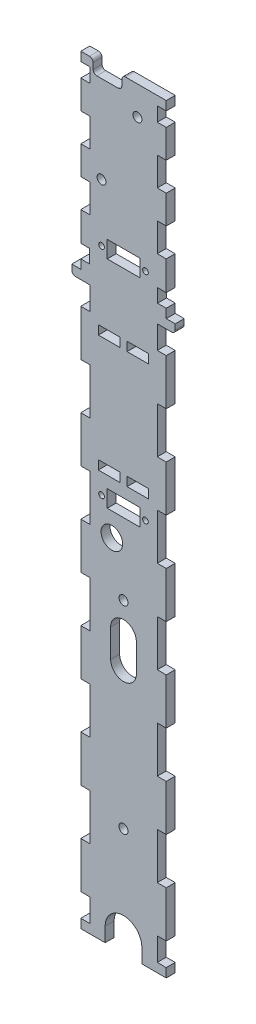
ISO-10303-21;
HEADER;
FILE_DESCRIPTION(('STEP AP214'),'2;1');
FILE_NAME('part.step','',(''),(''),'','','');
FILE_SCHEMA(('AUTOMOTIVE_DESIGN { 1 0 10303 214 1 1 1 1 }'));
ENDSEC;
DATA;
#1=APPLICATION_CONTEXT('core data for automotive mechanical design processes');
#2=APPLICATION_PROTOCOL_DEFINITION('international standard','automotive_design',2000,#1);
#3=PRODUCT_CONTEXT('',#1,'mechanical');
#4=PRODUCT('Part','Part','',(#3));
#5=PRODUCT_RELATED_PRODUCT_CATEGORY('part','',(#4));
#6=PRODUCT_DEFINITION_FORMATION('','',#4);
#7=PRODUCT_DEFINITION_CONTEXT('part definition',#1,'design');
#8=PRODUCT_DEFINITION('design','',#6,#7);
#9=PRODUCT_DEFINITION_SHAPE('','',#8);
#10=(LENGTH_UNIT() NAMED_UNIT(*) SI_UNIT(.MILLI.,.METRE.));
#11=(NAMED_UNIT(*) PLANE_ANGLE_UNIT() SI_UNIT($,.RADIAN.));
#12=(NAMED_UNIT(*) SI_UNIT($,.STERADIAN.) SOLID_ANGLE_UNIT());
#13=UNCERTAINTY_MEASURE_WITH_UNIT(LENGTH_MEASURE(1.E-05),#10,'distance_accuracy_value','');
#14=(GEOMETRIC_REPRESENTATION_CONTEXT(3) GLOBAL_UNCERTAINTY_ASSIGNED_CONTEXT((#13)) GLOBAL_UNIT_ASSIGNED_CONTEXT((#10,
#11,#12)) REPRESENTATION_CONTEXT('',''));
#15=CARTESIAN_POINT('',(0.,0.,0.));
#16=DIRECTION('',(0.,0.,1.));
#17=DIRECTION('',(1.,0.,0.));
#18=AXIS2_PLACEMENT_3D('',#15,#16,#17);
#19=CARTESIAN_POINT('',(0.,268.2875,3.175));
#20=DIRECTION('',(0.,-1.,0.));
#21=DIRECTION('',(0.,0.,-1.));
#22=AXIS2_PLACEMENT_3D('',#19,#20,#21);
#23=PLANE('',#22);
#24=DIRECTION('',(-1.,0.,0.));
#25=VECTOR('',#24,1.);
#26=CARTESIAN_POINT('',(0.,268.2875,0.));
#27=LINE('',#26,#25);
#28=CARTESIAN_POINT('',(30.1798071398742,268.2875,0.));
#29=VERTEX_POINT('',#28);
#30=CARTESIAN_POINT('',(15.7891714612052,268.2875,0.));
#31=VERTEX_POINT('',#30);
#32=EDGE_CURVE('E1798',#29,#31,#27,.T.);
#33=ORIENTED_EDGE('',*,*,#32,.T.);
#34=DIRECTION('',(0.,0.,1.));
#35=VECTOR('',#34,1.);
#36=CARTESIAN_POINT('',(15.7891714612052,268.2875,3.175));
#37=LINE('',#36,#35);
#38=CARTESIAN_POINT('',(15.7891714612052,268.2875,3.175));
#39=VERTEX_POINT('',#38);
#40=EDGE_CURVE('E1852',#31,#39,#37,.T.);
#41=ORIENTED_EDGE('',*,*,#40,.T.);
#42=DIRECTION('',(-1.,0.,0.));
#43=VECTOR('',#42,1.);
#44=CARTESIAN_POINT('',(0.,268.2875,3.175));
#45=LINE('',#44,#43);
#46=CARTESIAN_POINT('',(30.1798071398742,268.2875,3.175));
#47=VERTEX_POINT('',#46);
#48=EDGE_CURVE('E1779',#47,#39,#45,.T.);
#49=ORIENTED_EDGE('',*,*,#48,.F.);
#50=DIRECTION('',(0.,0.,-1.));
#51=VECTOR('',#50,1.);
#52=CARTESIAN_POINT('',(30.1798071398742,268.2875,3.175));
#53=LINE('',#52,#51);
#54=EDGE_CURVE('E1803',#47,#29,#53,.T.);
#55=ORIENTED_EDGE('',*,*,#54,.T.);
#56=EDGE_LOOP('',(#33,#41,#49,#55));
#57=FACE_BOUND('',#56,.T.);
#58=ADVANCED_FACE('F42',(#57),#23,.F.);
#59=CARTESIAN_POINT('',(0.,0.,3.175));
#60=DIRECTION('',(0.,1.,0.));
#61=DIRECTION('',(0.,0.,1.));
#62=AXIS2_PLACEMENT_3D('',#59,#60,#61);
#63=PLANE('',#62);
#64=DIRECTION('',(1.,0.,0.));
#65=VECTOR('',#64,1.);
#66=CARTESIAN_POINT('',(0.,0.,3.175));
#67=LINE('',#66,#65);
#68=CARTESIAN_POINT('',(21.5669035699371,0.,3.175));
#69=VERTEX_POINT('',#68);
#70=CARTESIAN_POINT('',(30.1798071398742,0.,3.175));
#71=VERTEX_POINT('',#70);
#72=EDGE_CURVE('E1766',#69,#71,#67,.T.);
#73=ORIENTED_EDGE('',*,*,#72,.F.);
#74=DIRECTION('',(0.,0.,1.));
#75=VECTOR('',#74,1.);
#76=CARTESIAN_POINT('',(21.5669035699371,0.,0.));
#77=LINE('',#76,#75);
#78=CARTESIAN_POINT('',(21.5669035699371,0.,0.));
#79=VERTEX_POINT('',#78);
#80=EDGE_CURVE('E1178',#79,#69,#77,.T.);
#81=ORIENTED_EDGE('',*,*,#80,.F.);
#82=DIRECTION('',(1.,0.,0.));
#83=VECTOR('',#82,1.);
#84=CARTESIAN_POINT('',(0.,0.,0.));
#85=LINE('',#84,#83);
#86=CARTESIAN_POINT('',(30.1798071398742,0.,0.));
#87=VERTEX_POINT('',#86);
#88=EDGE_CURVE('E1786',#79,#87,#85,.T.);
#89=ORIENTED_EDGE('',*,*,#88,.T.);
#90=DIRECTION('',(0.,0.,-1.));
#91=VECTOR('',#90,1.);
#92=CARTESIAN_POINT('',(30.1798071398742,0.,3.175));
#93=LINE('',#92,#91);
#94=EDGE_CURVE('E1806',#71,#87,#93,.T.);
#95=ORIENTED_EDGE('',*,*,#94,.F.);
#96=EDGE_LOOP('',(#73,#81,#89,#95));
#97=FACE_BOUND('',#96,.T.);
#98=ADVANCED_FACE('F2009',(#97),#63,.F.);
#99=CARTESIAN_POINT('',(0.,0.,3.175));
#100=DIRECTION('',(1.,0.,0.));
#101=DIRECTION('',(0.,0.,-1.));
#102=AXIS2_PLACEMENT_3D('',#99,#100,#101);
#103=PLANE('',#102);
#104=DIRECTION('',(0.,-1.,0.));
#105=VECTOR('',#104,1.);
#106=CARTESIAN_POINT('',(0.,0.,3.175));
#107=LINE('',#106,#105);
#108=CARTESIAN_POINT('',(0.,260.085416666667,3.175));
#109=VERTEX_POINT('',#108);
#110=CARTESIAN_POINT('',(0.,250.03125,3.175));
#111=VERTEX_POINT('',#110);
#112=EDGE_CURVE('E1767',#109,#111,#107,.T.);
#113=ORIENTED_EDGE('',*,*,#112,.F.);
#114=DIRECTION('',(0.,0.,-1.));
#115=VECTOR('',#114,1.);
#116=CARTESIAN_POINT('',(0.,260.085416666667,3.175));
#117=LINE('',#116,#115);
#118=CARTESIAN_POINT('',(0.,260.085416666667,0.));
#119=VERTEX_POINT('',#118);
#120=EDGE_CURVE('E1243',#109,#119,#117,.T.);
#121=ORIENTED_EDGE('',*,*,#120,.T.);
#122=DIRECTION('',(0.,-1.,0.));
#123=VECTOR('',#122,1.);
#124=CARTESIAN_POINT('',(0.,0.,0.));
#125=LINE('',#124,#123);
#126=CARTESIAN_POINT('',(0.,250.03125,0.));
#127=VERTEX_POINT('',#126);
#128=EDGE_CURVE('E1787',#119,#127,#125,.T.);
#129=ORIENTED_EDGE('',*,*,#128,.T.);
#130=DIRECTION('',(0.,0.,1.));
#131=VECTOR('',#130,1.);
#132=CARTESIAN_POINT('',(0.,250.03125,3.175));
#133=LINE('',#132,#131);
#134=EDGE_CURVE('E1289',#127,#111,#133,.T.);
#135=ORIENTED_EDGE('',*,*,#134,.T.);
#136=EDGE_LOOP('',(#113,#121,#129,#135));
#137=FACE_BOUND('',#136,.T.);
#138=ADVANCED_FACE('F2016',(#137),#103,.F.);
#139=CARTESIAN_POINT('',(30.1798071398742,0.,3.175));
#140=DIRECTION('',(-1.,0.,0.));
#141=DIRECTION('',(0.,0.,1.));
#142=AXIS2_PLACEMENT_3D('',#139,#140,#141);
#143=PLANE('',#142);
#144=DIRECTION('',(0.,1.,0.));
#145=VECTOR('',#144,1.);
#146=CARTESIAN_POINT('',(30.1798071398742,0.,0.));
#147=LINE('',#146,#145);
#148=CARTESIAN_POINT('',(30.1798071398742,250.03125,0.));
#149=VERTEX_POINT('',#148);
#150=CARTESIAN_POINT('',(30.1798071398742,260.085416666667,0.));
#151=VERTEX_POINT('',#150);
#152=EDGE_CURVE('E2076',#149,#151,#147,.T.);
#153=ORIENTED_EDGE('',*,*,#152,.T.);
#154=DIRECTION('',(0.,0.,1.));
#155=VECTOR('',#154,1.);
#156=CARTESIAN_POINT('',(30.1798071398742,260.085416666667,3.175));
#157=LINE('',#156,#155);
#158=CARTESIAN_POINT('',(30.1798071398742,260.085416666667,3.175));
#159=VERTEX_POINT('',#158);
#160=EDGE_CURVE('E1237',#151,#159,#157,.T.);
#161=ORIENTED_EDGE('',*,*,#160,.T.);
#162=DIRECTION('',(0.,1.,0.));
#163=VECTOR('',#162,1.);
#164=CARTESIAN_POINT('',(30.1798071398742,0.,3.175));
#165=LINE('',#164,#163);
#166=CARTESIAN_POINT('',(30.1798071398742,250.03125,3.175));
#167=VERTEX_POINT('',#166);
#168=EDGE_CURVE('E3787',#167,#159,#165,.T.);
#169=ORIENTED_EDGE('',*,*,#168,.F.);
#170=DIRECTION('',(0.,0.,-1.));
#171=VECTOR('',#170,1.);
#172=CARTESIAN_POINT('',(30.1798071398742,250.03125,3.175));
#173=LINE('',#172,#171);
#174=EDGE_CURVE('E1266',#167,#149,#173,.T.);
#175=ORIENTED_EDGE('',*,*,#174,.T.);
#176=EDGE_LOOP('',(#153,#161,#169,#175));
#177=FACE_BOUND('',#176,.T.);
#178=ADVANCED_FACE('F2032',(#177),#143,.F.);
#179=CARTESIAN_POINT('',(0.,239.977083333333,3.175));
#180=VERTEX_POINT('',#179);
#181=CARTESIAN_POINT('',(0.,229.922916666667,3.175));
#182=VERTEX_POINT('',#181);
#183=EDGE_CURVE('E3677',#180,#182,#107,.T.);
#184=ORIENTED_EDGE('',*,*,#183,.F.);
#185=DIRECTION('',(0.,0.,-1.));
#186=VECTOR('',#185,1.);
#187=CARTESIAN_POINT('',(0.,239.977083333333,3.175));
#188=LINE('',#187,#186);
#189=CARTESIAN_POINT('',(0.,239.977083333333,0.));
#190=VERTEX_POINT('',#189);
#191=EDGE_CURVE('E1292',#180,#190,#188,.T.);
#192=ORIENTED_EDGE('',*,*,#191,.T.);
#193=CARTESIAN_POINT('',(0.,229.922916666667,0.));
#194=VERTEX_POINT('',#193);
#195=EDGE_CURVE('E2167',#190,#194,#125,.T.);
#196=ORIENTED_EDGE('',*,*,#195,.T.);
#197=DIRECTION('',(0.,0.,1.));
#198=VECTOR('',#197,1.);
#199=CARTESIAN_POINT('',(0.,229.922916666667,3.175));
#200=LINE('',#199,#198);
#201=EDGE_CURVE('E1338',#194,#182,#200,.T.);
#202=ORIENTED_EDGE('',*,*,#201,.T.);
#203=EDGE_LOOP('',(#184,#192,#196,#202));
#204=FACE_BOUND('',#203,.T.);
#205=ADVANCED_FACE('F3150',(#204),#103,.F.);
#206=CARTESIAN_POINT('',(30.1798071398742,229.922916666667,0.));
#207=VERTEX_POINT('',#206);
#208=CARTESIAN_POINT('',(30.1798071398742,239.977083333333,0.));
#209=VERTEX_POINT('',#208);
#210=EDGE_CURVE('E2078',#207,#209,#147,.T.);
#211=ORIENTED_EDGE('',*,*,#210,.T.);
#212=DIRECTION('',(0.,0.,1.));
#213=VECTOR('',#212,1.);
#214=CARTESIAN_POINT('',(30.1798071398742,239.977083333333,3.175));
#215=LINE('',#214,#213);
#216=CARTESIAN_POINT('',(30.1798071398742,239.977083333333,3.175));
#217=VERTEX_POINT('',#216);
#218=EDGE_CURVE('E1286',#209,#217,#215,.T.);
#219=ORIENTED_EDGE('',*,*,#218,.T.);
#220=CARTESIAN_POINT('',(30.1798071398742,229.922916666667,3.175));
#221=VERTEX_POINT('',#220);
#222=EDGE_CURVE('E1947',#221,#217,#165,.T.);
#223=ORIENTED_EDGE('',*,*,#222,.F.);
#224=DIRECTION('',(0.,0.,-1.));
#225=VECTOR('',#224,1.);
#226=CARTESIAN_POINT('',(30.1798071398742,229.922916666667,3.175));
#227=LINE('',#226,#225);
#228=EDGE_CURVE('E1315',#221,#207,#227,.T.);
#229=ORIENTED_EDGE('',*,*,#228,.T.);
#230=EDGE_LOOP('',(#211,#219,#223,#229));
#231=FACE_BOUND('',#230,.T.);
#232=ADVANCED_FACE('F3158',(#231),#143,.F.);
#233=CARTESIAN_POINT('',(0.,219.86875,3.175));
#234=VERTEX_POINT('',#233);
#235=CARTESIAN_POINT('',(0.,209.55,3.175));
#236=VERTEX_POINT('',#235);
#237=EDGE_CURVE('E3676',#234,#236,#107,.T.);
#238=ORIENTED_EDGE('',*,*,#237,.F.);
#239=DIRECTION('',(0.,0.,-1.));
#240=VECTOR('',#239,1.);
#241=CARTESIAN_POINT('',(0.,219.86875,3.175));
#242=LINE('',#241,#240);
#243=CARTESIAN_POINT('',(0.,219.86875,0.));
#244=VERTEX_POINT('',#243);
#245=EDGE_CURVE('E1341',#234,#244,#242,.T.);
#246=ORIENTED_EDGE('',*,*,#245,.T.);
#247=CARTESIAN_POINT('',(0.,209.55,0.));
#248=VERTEX_POINT('',#247);
#249=EDGE_CURVE('E2165',#244,#248,#125,.T.);
#250=ORIENTED_EDGE('',*,*,#249,.T.);
#251=DIRECTION('',(0.,0.,1.));
#252=VECTOR('',#251,1.);
#253=CARTESIAN_POINT('',(0.,209.55,3.175));
#254=LINE('',#253,#252);
#255=EDGE_CURVE('E1387',#248,#236,#254,.T.);
#256=ORIENTED_EDGE('',*,*,#255,.T.);
#257=EDGE_LOOP('',(#238,#246,#250,#256));
#258=FACE_BOUND('',#257,.T.);
#259=ADVANCED_FACE('F3197',(#258),#103,.F.);
#260=CARTESIAN_POINT('',(30.1798071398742,209.55,0.));
#261=VERTEX_POINT('',#260);
#262=CARTESIAN_POINT('',(30.1798071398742,219.86875,0.));
#263=VERTEX_POINT('',#262);
#264=EDGE_CURVE('E2082',#261,#263,#147,.T.);
#265=ORIENTED_EDGE('',*,*,#264,.T.);
#266=DIRECTION('',(0.,0.,1.));
#267=VECTOR('',#266,1.);
#268=CARTESIAN_POINT('',(30.1798071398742,219.86875,3.175));
#269=LINE('',#268,#267);
#270=CARTESIAN_POINT('',(30.1798071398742,219.86875,3.175));
#271=VERTEX_POINT('',#270);
#272=EDGE_CURVE('E1335',#263,#271,#269,.T.);
#273=ORIENTED_EDGE('',*,*,#272,.T.);
#274=CARTESIAN_POINT('',(30.1798071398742,209.55,3.175));
#275=VERTEX_POINT('',#274);
#276=EDGE_CURVE('E1944',#275,#271,#165,.T.);
#277=ORIENTED_EDGE('',*,*,#276,.F.);
#278=DIRECTION('',(0.,0.,-1.));
#279=VECTOR('',#278,1.);
#280=CARTESIAN_POINT('',(30.1798071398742,209.55,3.175));
#281=LINE('',#280,#279);
#282=EDGE_CURVE('E1364',#275,#261,#281,.T.);
#283=ORIENTED_EDGE('',*,*,#282,.T.);
#284=EDGE_LOOP('',(#265,#273,#277,#283));
#285=FACE_BOUND('',#284,.T.);
#286=ADVANCED_FACE('F3204',(#285),#143,.F.);
#287=CARTESIAN_POINT('',(0.,204.7875,3.175));
#288=VERTEX_POINT('',#287);
#289=CARTESIAN_POINT('',(0.,201.6125,3.175));
#290=VERTEX_POINT('',#289);
#291=EDGE_CURVE('E2209',#288,#290,#107,.T.);
#292=ORIENTED_EDGE('',*,*,#291,.F.);
#293=DIRECTION('',(0.,0.,-1.));
#294=VECTOR('',#293,1.);
#295=CARTESIAN_POINT('',(0.,204.7875,3.175));
#296=LINE('',#295,#294);
#297=CARTESIAN_POINT('',(0.,204.7875,0.));
#298=VERTEX_POINT('',#297);
#299=EDGE_CURVE('E1390',#288,#298,#296,.T.);
#300=ORIENTED_EDGE('',*,*,#299,.T.);
#301=CARTESIAN_POINT('',(0.,201.6125,0.));
#302=VERTEX_POINT('',#301);
#303=EDGE_CURVE('E2163',#298,#302,#125,.T.);
#304=ORIENTED_EDGE('',*,*,#303,.T.);
#305=DIRECTION('',(0.,0.,-1.));
#306=VECTOR('',#305,1.);
#307=CARTESIAN_POINT('',(0.,201.6125,0.));
#308=LINE('',#307,#306);
#309=EDGE_CURVE('E1742',#290,#302,#308,.T.);
#310=ORIENTED_EDGE('',*,*,#309,.F.);
#311=EDGE_LOOP('',(#292,#300,#304,#310));
#312=FACE_BOUND('',#311,.T.);
#313=ADVANCED_FACE('F3242',(#312),#103,.F.);
#314=CARTESIAN_POINT('',(30.1798071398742,201.6125,0.));
#315=VERTEX_POINT('',#314);
#316=CARTESIAN_POINT('',(30.1798071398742,204.7875,0.));
#317=VERTEX_POINT('',#316);
#318=EDGE_CURVE('E1797',#315,#317,#147,.T.);
#319=ORIENTED_EDGE('',*,*,#318,.T.);
#320=DIRECTION('',(0.,0.,1.));
#321=VECTOR('',#320,1.);
#322=CARTESIAN_POINT('',(30.1798071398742,204.7875,3.175));
#323=LINE('',#322,#321);
#324=CARTESIAN_POINT('',(30.1798071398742,204.7875,3.175));
#325=VERTEX_POINT('',#324);
#326=EDGE_CURVE('E1384',#317,#325,#323,.T.);
#327=ORIENTED_EDGE('',*,*,#326,.T.);
#328=CARTESIAN_POINT('',(30.1798071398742,201.6125,3.175));
#329=VERTEX_POINT('',#328);
#330=EDGE_CURVE('E1778',#329,#325,#165,.T.);
#331=ORIENTED_EDGE('',*,*,#330,.F.);
#332=DIRECTION('',(0.,0.,-1.));
#333=VECTOR('',#332,1.);
#334=CARTESIAN_POINT('',(30.1798071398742,201.6125,0.));
#335=LINE('',#334,#333);
#336=EDGE_CURVE('E1723',#329,#315,#335,.T.);
#337=ORIENTED_EDGE('',*,*,#336,.T.);
#338=EDGE_LOOP('',(#319,#327,#331,#337));
#339=FACE_BOUND('',#338,.T.);
#340=ADVANCED_FACE('F1941',(#339),#143,.F.);
#341=CARTESIAN_POINT('',(30.1798071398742,76.3984375,0.));
#342=VERTEX_POINT('',#341);
#343=CARTESIAN_POINT('',(30.1798071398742,92.6703125,0.));
#344=VERTEX_POINT('',#343);
#345=EDGE_CURVE('E2090',#342,#344,#147,.T.);
#346=ORIENTED_EDGE('',*,*,#345,.T.);
#347=DIRECTION('',(0.,0.,1.));
#348=VECTOR('',#347,1.);
#349=CARTESIAN_POINT('',(30.1798071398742,92.6703125,3.175));
#350=LINE('',#349,#348);
#351=CARTESIAN_POINT('',(30.1798071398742,92.6703125,3.175));
#352=VERTEX_POINT('',#351);
#353=EDGE_CURVE('E1616',#344,#352,#350,.T.);
#354=ORIENTED_EDGE('',*,*,#353,.T.);
#355=CARTESIAN_POINT('',(30.1798071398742,76.3984375,3.175));
#356=VERTEX_POINT('',#355);
#357=EDGE_CURVE('E1954',#356,#352,#165,.T.);
#358=ORIENTED_EDGE('',*,*,#357,.F.);
#359=DIRECTION('',(0.,0.,-1.));
#360=VECTOR('',#359,1.);
#361=CARTESIAN_POINT('',(30.1798071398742,76.3984375,3.175));
#362=LINE('',#361,#360);
#363=EDGE_CURVE('E1601',#356,#342,#362,.T.);
#364=ORIENTED_EDGE('',*,*,#363,.T.);
#365=EDGE_LOOP('',(#346,#354,#358,#364));
#366=FACE_BOUND('',#365,.T.);
#367=ADVANCED_FACE('F2121',(#366),#143,.F.);
#368=CARTESIAN_POINT('',(30.1798071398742,43.8546875,0.));
#369=VERTEX_POINT('',#368);
#370=CARTESIAN_POINT('',(30.1798071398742,60.1265625,0.));
#371=VERTEX_POINT('',#370);
#372=EDGE_CURVE('E2094',#369,#371,#147,.T.);
#373=ORIENTED_EDGE('',*,*,#372,.T.);
#374=DIRECTION('',(0.,0.,1.));
#375=VECTOR('',#374,1.);
#376=CARTESIAN_POINT('',(30.1798071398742,60.1265625,3.175));
#377=LINE('',#376,#375);
#378=CARTESIAN_POINT('',(30.1798071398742,60.1265625,3.175));
#379=VERTEX_POINT('',#378);
#380=EDGE_CURVE('E1604',#371,#379,#377,.T.);
#381=ORIENTED_EDGE('',*,*,#380,.T.);
#382=CARTESIAN_POINT('',(30.1798071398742,43.8546875,3.175));
#383=VERTEX_POINT('',#382);
#384=EDGE_CURVE('E1949',#383,#379,#165,.T.);
#385=ORIENTED_EDGE('',*,*,#384,.F.);
#386=DIRECTION('',(0.,0.,-1.));
#387=VECTOR('',#386,1.);
#388=CARTESIAN_POINT('',(30.1798071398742,43.8546875,3.175));
#389=LINE('',#388,#387);
#390=EDGE_CURVE('E1645',#383,#369,#389,.T.);
#391=ORIENTED_EDGE('',*,*,#390,.T.);
#392=EDGE_LOOP('',(#373,#381,#385,#391));
#393=FACE_BOUND('',#392,.T.);
#394=ADVANCED_FACE('F2119',(#393),#143,.F.);
#395=CARTESIAN_POINT('',(30.1798071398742,141.4859375,0.));
#396=VERTEX_POINT('',#395);
#397=CARTESIAN_POINT('',(30.1798071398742,157.7578125,0.));
#398=VERTEX_POINT('',#397);
#399=EDGE_CURVE('E1977',#396,#398,#147,.T.);
#400=ORIENTED_EDGE('',*,*,#399,.T.);
#401=DIRECTION('',(0.,0.,1.));
#402=VECTOR('',#401,1.);
#403=CARTESIAN_POINT('',(30.1798071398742,157.7578125,3.175));
#404=LINE('',#403,#402);
#405=CARTESIAN_POINT('',(30.1798071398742,157.7578125,3.175));
#406=VERTEX_POINT('',#405);
#407=EDGE_CURVE('E1598',#398,#406,#404,.T.);
#408=ORIENTED_EDGE('',*,*,#407,.T.);
#409=CARTESIAN_POINT('',(30.1798071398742,141.4859375,3.175));
#410=VERTEX_POINT('',#409);
#411=EDGE_CURVE('E1945',#410,#406,#165,.T.);
#412=ORIENTED_EDGE('',*,*,#411,.F.);
#413=DIRECTION('',(0.,0.,-1.));
#414=VECTOR('',#413,1.);
#415=CARTESIAN_POINT('',(30.1798071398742,141.4859375,3.175));
#416=LINE('',#415,#414);
#417=EDGE_CURVE('E1583',#410,#396,#416,.T.);
#418=ORIENTED_EDGE('',*,*,#417,.T.);
#419=EDGE_LOOP('',(#400,#408,#412,#418));
#420=FACE_BOUND('',#419,.T.);
#421=ADVANCED_FACE('F1975',(#420),#143,.F.);
#422=CARTESIAN_POINT('',(30.1798071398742,108.9421875,3.175));
#423=VERTEX_POINT('',#422);
#424=CARTESIAN_POINT('',(30.1798071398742,125.2140625,3.175));
#425=VERTEX_POINT('',#424);
#426=EDGE_CURVE('E1959',#423,#425,#165,.T.);
#427=ORIENTED_EDGE('',*,*,#426,.F.);
#428=DIRECTION('',(0.,0.,-1.));
#429=VECTOR('',#428,1.);
#430=CARTESIAN_POINT('',(30.1798071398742,108.9421875,3.175));
#431=LINE('',#430,#429);
#432=CARTESIAN_POINT('',(30.1798071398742,108.9421875,0.));
#433=VERTEX_POINT('',#432);
#434=EDGE_CURVE('E1613',#423,#433,#431,.T.);
#435=ORIENTED_EDGE('',*,*,#434,.T.);
#436=CARTESIAN_POINT('',(30.1798071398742,125.2140625,0.));
#437=VERTEX_POINT('',#436);
#438=EDGE_CURVE('E2088',#433,#437,#147,.T.);
#439=ORIENTED_EDGE('',*,*,#438,.T.);
#440=DIRECTION('',(0.,0.,1.));
#441=VECTOR('',#440,1.);
#442=CARTESIAN_POINT('',(30.1798071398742,125.2140625,3.175));
#443=LINE('',#442,#441);
#444=EDGE_CURVE('E1586',#437,#425,#443,.T.);
#445=ORIENTED_EDGE('',*,*,#444,.T.);
#446=EDGE_LOOP('',(#427,#435,#439,#445));
#447=FACE_BOUND('',#446,.T.);
#448=ADVANCED_FACE('F2126',(#447),#143,.F.);
#449=CARTESIAN_POINT('',(0.,125.2140625,3.175));
#450=VERTEX_POINT('',#449);
#451=CARTESIAN_POINT('',(0.,108.9421875,3.175));
#452=VERTEX_POINT('',#451);
#453=EDGE_CURVE('E2205',#450,#452,#107,.T.);
#454=ORIENTED_EDGE('',*,*,#453,.F.);
#455=DIRECTION('',(0.,0.,-1.));
#456=VECTOR('',#455,1.);
#457=CARTESIAN_POINT('',(0.,125.2140625,3.175));
#458=LINE('',#457,#456);
#459=CARTESIAN_POINT('',(0.,125.2140625,0.));
#460=VERTEX_POINT('',#459);
#461=EDGE_CURVE('E1622',#450,#460,#458,.T.);
#462=ORIENTED_EDGE('',*,*,#461,.T.);
#463=CARTESIAN_POINT('',(0.,108.9421875,0.));
#464=VERTEX_POINT('',#463);
#465=EDGE_CURVE('E2174',#460,#464,#125,.T.);
#466=ORIENTED_EDGE('',*,*,#465,.T.);
#467=DIRECTION('',(0.,0.,1.));
#468=VECTOR('',#467,1.);
#469=CARTESIAN_POINT('',(0.,108.9421875,3.175));
#470=LINE('',#469,#468);
#471=EDGE_CURVE('E1607',#464,#452,#470,.T.);
#472=ORIENTED_EDGE('',*,*,#471,.T.);
#473=EDGE_LOOP('',(#454,#462,#466,#472));
#474=FACE_BOUND('',#473,.T.);
#475=ADVANCED_FACE('F2501',(#474),#103,.F.);
#476=CARTESIAN_POINT('',(0.,92.6703125,3.175));
#477=VERTEX_POINT('',#476);
#478=CARTESIAN_POINT('',(0.,76.3984375,3.175));
#479=VERTEX_POINT('',#478);
#480=EDGE_CURVE('E2202',#477,#479,#107,.T.);
#481=ORIENTED_EDGE('',*,*,#480,.F.);
#482=DIRECTION('',(0.,0.,-1.));
#483=VECTOR('',#482,1.);
#484=CARTESIAN_POINT('',(0.,92.6703125,3.175));
#485=LINE('',#484,#483);
#486=CARTESIAN_POINT('',(0.,92.6703125,0.));
#487=VERTEX_POINT('',#486);
#488=EDGE_CURVE('E1610',#477,#487,#485,.T.);
#489=ORIENTED_EDGE('',*,*,#488,.T.);
#490=CARTESIAN_POINT('',(0.,76.3984375,0.));
#491=VERTEX_POINT('',#490);
#492=EDGE_CURVE('E2176',#487,#491,#125,.T.);
#493=ORIENTED_EDGE('',*,*,#492,.T.);
#494=DIRECTION('',(0.,0.,1.));
#495=VECTOR('',#494,1.);
#496=CARTESIAN_POINT('',(0.,76.3984375,3.175));
#497=LINE('',#496,#495);
#498=EDGE_CURVE('E1576',#491,#479,#497,.T.);
#499=ORIENTED_EDGE('',*,*,#498,.T.);
#500=EDGE_LOOP('',(#481,#489,#493,#499));
#501=FACE_BOUND('',#500,.T.);
#502=ADVANCED_FACE('F2221',(#501),#103,.F.);
#503=CARTESIAN_POINT('',(0.,157.7578125,0.));
#504=VERTEX_POINT('',#503);
#505=CARTESIAN_POINT('',(0.,141.4859375,0.));
#506=VERTEX_POINT('',#505);
#507=EDGE_CURVE('E2168',#504,#506,#125,.T.);
#508=ORIENTED_EDGE('',*,*,#507,.T.);
#509=DIRECTION('',(0.,0.,1.));
#510=VECTOR('',#509,1.);
#511=CARTESIAN_POINT('',(0.,141.4859375,3.175));
#512=LINE('',#511,#510);
#513=CARTESIAN_POINT('',(0.,141.4859375,3.175));
#514=VERTEX_POINT('',#513);
#515=EDGE_CURVE('E1619',#506,#514,#512,.T.);
#516=ORIENTED_EDGE('',*,*,#515,.T.);
#517=CARTESIAN_POINT('',(0.,157.7578125,3.175));
#518=VERTEX_POINT('',#517);
#519=EDGE_CURVE('E2198',#518,#514,#107,.T.);
#520=ORIENTED_EDGE('',*,*,#519,.F.);
#521=DIRECTION('',(0.,0.,-1.));
#522=VECTOR('',#521,1.);
#523=CARTESIAN_POINT('',(0.,157.7578125,3.175));
#524=LINE('',#523,#522);
#525=EDGE_CURVE('E1592',#518,#504,#524,.T.);
#526=ORIENTED_EDGE('',*,*,#525,.T.);
#527=EDGE_LOOP('',(#508,#516,#520,#526));
#528=FACE_BOUND('',#527,.T.);
#529=ADVANCED_FACE('F2490',(#528),#103,.F.);
#530=CARTESIAN_POINT('',(0.,60.1265625,3.175));
#531=VERTEX_POINT('',#530);
#532=CARTESIAN_POINT('',(0.,43.8546875,3.175));
#533=VERTEX_POINT('',#532);
#534=EDGE_CURVE('E2197',#531,#533,#107,.T.);
#535=ORIENTED_EDGE('',*,*,#534,.F.);
#536=DIRECTION('',(0.,0.,-1.));
#537=VECTOR('',#536,1.);
#538=CARTESIAN_POINT('',(0.,60.1265625,3.175));
#539=LINE('',#538,#537);
#540=CARTESIAN_POINT('',(0.,60.1265625,0.));
#541=VERTEX_POINT('',#540);
#542=EDGE_CURVE('E1580',#531,#541,#539,.T.);
#543=ORIENTED_EDGE('',*,*,#542,.T.);
#544=CARTESIAN_POINT('',(0.,43.8546875,0.));
#545=VERTEX_POINT('',#544);
#546=EDGE_CURVE('E2169',#541,#545,#125,.T.);
#547=ORIENTED_EDGE('',*,*,#546,.T.);
#548=DIRECTION('',(0.,0.,1.));
#549=VECTOR('',#548,1.);
#550=CARTESIAN_POINT('',(0.,43.8546875,3.175));
#551=LINE('',#550,#549);
#552=EDGE_CURVE('E1668',#545,#533,#551,.T.);
#553=ORIENTED_EDGE('',*,*,#552,.T.);
#554=EDGE_LOOP('',(#535,#543,#547,#553));
#555=FACE_BOUND('',#554,.T.);
#556=ADVANCED_FACE('F2235',(#555),#103,.F.);
#557=CARTESIAN_POINT('',(30.1798071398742,11.3109375,0.));
#558=VERTEX_POINT('',#557);
#559=CARTESIAN_POINT('',(30.1798071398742,27.5828125,0.));
#560=VERTEX_POINT('',#559);
#561=EDGE_CURVE('E1796',#558,#560,#147,.T.);
#562=ORIENTED_EDGE('',*,*,#561,.T.);
#563=DIRECTION('',(0.,0.,1.));
#564=VECTOR('',#563,1.);
#565=CARTESIAN_POINT('',(30.1798071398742,27.5828125,3.175));
#566=LINE('',#565,#564);
#567=CARTESIAN_POINT('',(30.1798071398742,27.5828125,3.175));
#568=VERTEX_POINT('',#567);
#569=EDGE_CURVE('E1665',#560,#568,#566,.T.);
#570=ORIENTED_EDGE('',*,*,#569,.T.);
#571=CARTESIAN_POINT('',(30.1798071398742,11.3109375,3.175));
#572=VERTEX_POINT('',#571);
#573=EDGE_CURVE('E1777',#572,#568,#165,.T.);
#574=ORIENTED_EDGE('',*,*,#573,.F.);
#575=DIRECTION('',(0.,0.,-1.));
#576=VECTOR('',#575,1.);
#577=CARTESIAN_POINT('',(30.1798071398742,11.3109375,3.175));
#578=LINE('',#577,#576);
#579=EDGE_CURVE('E1694',#572,#558,#578,.T.);
#580=ORIENTED_EDGE('',*,*,#579,.T.);
#581=EDGE_LOOP('',(#562,#570,#574,#580));
#582=FACE_BOUND('',#581,.T.);
#583=ADVANCED_FACE('F2103',(#582),#143,.F.);
#584=CARTESIAN_POINT('',(0.,27.5828125,3.175));
#585=VERTEX_POINT('',#584);
#586=CARTESIAN_POINT('',(0.,11.3109375,3.175));
#587=VERTEX_POINT('',#586);
#588=EDGE_CURVE('E2196',#585,#587,#107,.T.);
#589=ORIENTED_EDGE('',*,*,#588,.F.);
#590=DIRECTION('',(0.,0.,-1.));
#591=VECTOR('',#590,1.);
#592=CARTESIAN_POINT('',(0.,27.5828125,3.175));
#593=LINE('',#592,#591);
#594=CARTESIAN_POINT('',(0.,27.5828125,0.));
#595=VERTEX_POINT('',#594);
#596=EDGE_CURVE('E1671',#585,#595,#593,.T.);
#597=ORIENTED_EDGE('',*,*,#596,.T.);
#598=CARTESIAN_POINT('',(0.,11.3109375,0.));
#599=VERTEX_POINT('',#598);
#600=EDGE_CURVE('E2175',#595,#599,#125,.T.);
#601=ORIENTED_EDGE('',*,*,#600,.T.);
#602=DIRECTION('',(0.,0.,1.));
#603=VECTOR('',#602,1.);
#604=CARTESIAN_POINT('',(0.,11.3109375,3.175));
#605=LINE('',#604,#603);
#606=EDGE_CURVE('E1717',#599,#587,#605,.T.);
#607=ORIENTED_EDGE('',*,*,#606,.T.);
#608=EDGE_LOOP('',(#589,#597,#601,#607));
#609=FACE_BOUND('',#608,.T.);
#610=ADVANCED_FACE('F2245',(#609),#103,.F.);
#611=CARTESIAN_POINT('',(30.1798071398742,3.175,0.));
#612=VERTEX_POINT('',#611);
#613=EDGE_CURVE('E1792',#87,#612,#147,.T.);
#614=ORIENTED_EDGE('',*,*,#613,.T.);
#615=DIRECTION('',(0.,0.,1.));
#616=VECTOR('',#615,1.);
#617=CARTESIAN_POINT('',(30.1798071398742,3.175,3.175));
#618=LINE('',#617,#616);
#619=CARTESIAN_POINT('',(30.1798071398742,3.175,3.175));
#620=VERTEX_POINT('',#619);
#621=EDGE_CURVE('E1714',#612,#620,#618,.T.);
#622=ORIENTED_EDGE('',*,*,#621,.T.);
#623=EDGE_CURVE('E1773',#71,#620,#165,.T.);
#624=ORIENTED_EDGE('',*,*,#623,.F.);
#625=ORIENTED_EDGE('',*,*,#94,.T.);
#626=EDGE_LOOP('',(#614,#622,#624,#625));
#627=FACE_BOUND('',#626,.T.);
#628=ADVANCED_FACE('F2595',(#627),#143,.F.);
#629=CARTESIAN_POINT('',(0.,3.175,3.175));
#630=VERTEX_POINT('',#629);
#631=CARTESIAN_POINT('',(0.,0.,3.175));
#632=VERTEX_POINT('',#631);
#633=EDGE_CURVE('E1768',#630,#632,#107,.T.);
#634=ORIENTED_EDGE('',*,*,#633,.F.);
#635=DIRECTION('',(0.,0.,-1.));
#636=VECTOR('',#635,1.);
#637=CARTESIAN_POINT('',(0.,3.175,3.175));
#638=LINE('',#637,#636);
#639=CARTESIAN_POINT('',(0.,3.175,0.));
#640=VERTEX_POINT('',#639);
#641=EDGE_CURVE('E1720',#630,#640,#638,.T.);
#642=ORIENTED_EDGE('',*,*,#641,.T.);
#643=CARTESIAN_POINT('',(0.,0.,0.));
#644=VERTEX_POINT('',#643);
#645=EDGE_CURVE('E1762',#640,#644,#125,.T.);
#646=ORIENTED_EDGE('',*,*,#645,.T.);
#647=DIRECTION('',(0.,0.,-1.));
#648=VECTOR('',#647,1.);
#649=CARTESIAN_POINT('',(0.,0.,3.175));
#650=LINE('',#649,#648);
#651=EDGE_CURVE('E1809',#632,#644,#650,.T.);
#652=ORIENTED_EDGE('',*,*,#651,.F.);
#653=EDGE_LOOP('',(#634,#642,#646,#652));
#654=FACE_BOUND('',#653,.T.);
#655=ADVANCED_FACE('F2189',(#654),#103,.F.);
#656=CARTESIAN_POINT('',(30.1798071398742,174.0296875,0.));
#657=VERTEX_POINT('',#656);
#658=CARTESIAN_POINT('',(30.1798071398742,190.3015625,0.));
#659=VERTEX_POINT('',#658);
#660=EDGE_CURVE('E1992',#657,#659,#147,.T.);
#661=ORIENTED_EDGE('',*,*,#660,.T.);
#662=DIRECTION('',(0.,0.,1.));
#663=VECTOR('',#662,1.);
#664=CARTESIAN_POINT('',(30.1798071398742,190.3015625,3.175));
#665=LINE('',#664,#663);
#666=CARTESIAN_POINT('',(30.1798071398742,190.3015625,3.175));
#667=VERTEX_POINT('',#666);
#668=EDGE_CURVE('E1410',#659,#667,#665,.T.);
#669=ORIENTED_EDGE('',*,*,#668,.T.);
#670=CARTESIAN_POINT('',(30.1798071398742,174.0296875,3.175));
#671=VERTEX_POINT('',#670);
#672=EDGE_CURVE('E1943',#671,#667,#165,.T.);
#673=ORIENTED_EDGE('',*,*,#672,.F.);
#674=DIRECTION('',(0.,0.,-1.));
#675=VECTOR('',#674,1.);
#676=CARTESIAN_POINT('',(30.1798071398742,174.0296875,3.175));
#677=LINE('',#676,#675);
#678=EDGE_CURVE('E1595',#671,#657,#677,.T.);
#679=ORIENTED_EDGE('',*,*,#678,.T.);
#680=EDGE_LOOP('',(#661,#669,#673,#679));
#681=FACE_BOUND('',#680,.T.);
#682=ADVANCED_FACE('F1991',(#681),#143,.F.);
#683=CARTESIAN_POINT('',(0.,268.2875,0.));
#684=VERTEX_POINT('',#683);
#685=CARTESIAN_POINT('',(0.,265.1125,0.));
#686=VERTEX_POINT('',#685);
#687=EDGE_CURVE('E1783',#684,#686,#125,.T.);
#688=ORIENTED_EDGE('',*,*,#687,.T.);
#689=DIRECTION('',(0.,0.,1.));
#690=VECTOR('',#689,1.);
#691=CARTESIAN_POINT('',(0.,265.1125,3.175));
#692=LINE('',#691,#690);
#693=CARTESIAN_POINT('',(0.,265.1125,3.175));
#694=VERTEX_POINT('',#693);
#695=EDGE_CURVE('E1240',#686,#694,#692,.T.);
#696=ORIENTED_EDGE('',*,*,#695,.T.);
#697=CARTESIAN_POINT('',(0.,268.2875,3.175));
#698=VERTEX_POINT('',#697);
#699=EDGE_CURVE('E1763',#698,#694,#107,.T.);
#700=ORIENTED_EDGE('',*,*,#699,.F.);
#701=DIRECTION('',(0.,0.,-1.));
#702=VECTOR('',#701,1.);
#703=CARTESIAN_POINT('',(0.,268.2875,3.175));
#704=LINE('',#703,#702);
#705=EDGE_CURVE('E1782',#698,#684,#704,.T.);
#706=ORIENTED_EDGE('',*,*,#705,.T.);
#707=EDGE_LOOP('',(#688,#696,#700,#706));
#708=FACE_BOUND('',#707,.T.);
#709=ADVANCED_FACE('F2131',(#708),#103,.F.);
#710=CARTESIAN_POINT('',(0.,190.3015625,3.175));
#711=VERTEX_POINT('',#710);
#712=CARTESIAN_POINT('',(0.,174.0296875,3.175));
#713=VERTEX_POINT('',#712);
#714=EDGE_CURVE('E2203',#711,#713,#107,.T.);
#715=ORIENTED_EDGE('',*,*,#714,.F.);
#716=DIRECTION('',(0.,0.,-1.));
#717=VECTOR('',#716,1.);
#718=CARTESIAN_POINT('',(0.,190.3015625,3.175));
#719=LINE('',#718,#717);
#720=CARTESIAN_POINT('',(0.,190.3015625,0.));
#721=VERTEX_POINT('',#720);
#722=EDGE_CURVE('E1429',#711,#721,#719,.T.);
#723=ORIENTED_EDGE('',*,*,#722,.T.);
#724=CARTESIAN_POINT('',(0.,174.0296875,0.));
#725=VERTEX_POINT('',#724);
#726=EDGE_CURVE('E2166',#721,#725,#125,.T.);
#727=ORIENTED_EDGE('',*,*,#726,.T.);
#728=DIRECTION('',(0.,0.,1.));
#729=VECTOR('',#728,1.);
#730=CARTESIAN_POINT('',(0.,174.0296875,3.175));
#731=LINE('',#730,#729);
#732=EDGE_CURVE('E1589',#725,#713,#731,.T.);
#733=ORIENTED_EDGE('',*,*,#732,.T.);
#734=EDGE_LOOP('',(#715,#723,#727,#733));
#735=FACE_BOUND('',#734,.T.);
#736=ADVANCED_FACE('F2129',(#735),#103,.F.);
#737=CARTESIAN_POINT('',(8.61290356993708,0.,0.));
#738=VERTEX_POINT('',#737);
#739=EDGE_CURVE('E1788',#644,#738,#85,.T.);
#740=ORIENTED_EDGE('',*,*,#739,.T.);
#741=DIRECTION('',(0.,0.,1.));
#742=VECTOR('',#741,1.);
#743=CARTESIAN_POINT('',(8.61290356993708,0.,0.));
#744=LINE('',#743,#742);
#745=CARTESIAN_POINT('',(8.61290356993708,0.,3.175));
#746=VERTEX_POINT('',#745);
#747=EDGE_CURVE('E1181',#738,#746,#744,.T.);
#748=ORIENTED_EDGE('',*,*,#747,.T.);
#749=EDGE_CURVE('E1769',#632,#746,#67,.T.);
#750=ORIENTED_EDGE('',*,*,#749,.F.);
#751=ORIENTED_EDGE('',*,*,#651,.T.);
#752=EDGE_LOOP('',(#740,#748,#750,#751));
#753=FACE_BOUND('',#752,.T.);
#754=ADVANCED_FACE('F2019',(#753),#63,.F.);
#755=CARTESIAN_POINT('',(30.1798071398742,265.1125,3.175));
#756=VERTEX_POINT('',#755);
#757=EDGE_CURVE('E1772',#756,#47,#165,.T.);
#758=ORIENTED_EDGE('',*,*,#757,.F.);
#759=DIRECTION('',(0.,0.,-1.));
#760=VECTOR('',#759,1.);
#761=CARTESIAN_POINT('',(30.1798071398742,265.1125,3.175));
#762=LINE('',#761,#760);
#763=CARTESIAN_POINT('',(30.1798071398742,265.1125,0.));
#764=VERTEX_POINT('',#763);
#765=EDGE_CURVE('E1217',#756,#764,#762,.T.);
#766=ORIENTED_EDGE('',*,*,#765,.T.);
#767=EDGE_CURVE('E1791',#764,#29,#147,.T.);
#768=ORIENTED_EDGE('',*,*,#767,.T.);
#769=ORIENTED_EDGE('',*,*,#54,.F.);
#770=EDGE_LOOP('',(#758,#766,#768,#769));
#771=FACE_BOUND('',#770,.T.);
#772=ADVANCED_FACE('F2023',(#771),#143,.F.);
#773=CARTESIAN_POINT('',(3.08917146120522,268.2875,3.175));
#774=VERTEX_POINT('',#773);
#775=EDGE_CURVE('E1776',#774,#698,#45,.T.);
#776=ORIENTED_EDGE('',*,*,#775,.F.);
#777=DIRECTION('',(0.,0.,1.));
#778=VECTOR('',#777,1.);
#779=CARTESIAN_POINT('',(3.08917146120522,268.2875,3.175));
#780=LINE('',#779,#778);
#781=CARTESIAN_POINT('',(3.08917146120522,268.2875,0.));
#782=VERTEX_POINT('',#781);
#783=EDGE_CURVE('E1870',#774,#782,#780,.F.);
#784=ORIENTED_EDGE('',*,*,#783,.T.);
#785=EDGE_CURVE('E1795',#782,#684,#27,.T.);
#786=ORIENTED_EDGE('',*,*,#785,.T.);
#787=ORIENTED_EDGE('',*,*,#705,.F.);
#788=EDGE_LOOP('',(#776,#784,#786,#787));
#789=FACE_BOUND('',#788,.T.);
#790=ADVANCED_FACE('F2012',(#789),#23,.F.);
#791=CARTESIAN_POINT('',(0.,0.,3.175));
#792=DIRECTION('',(0.,0.,-1.));
#793=DIRECTION('',(-1.,0.,0.));
#794=AXIS2_PLACEMENT_3D('',#791,#792,#793);
#795=PLANE('',#794);
#796=CARTESIAN_POINT('',(7.34290356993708,136.212943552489,3.175));
#797=DIRECTION('',(0.,0.,1.));
#798=DIRECTION('',(1.,0.,0.));
#799=AXIS2_PLACEMENT_3D('',#796,#797,#798);
#800=CIRCLE('',#799,1.0033);
#801=CARTESIAN_POINT('',(8.34620356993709,136.212943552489,3.175));
#802=VERTEX_POINT('',#801);
#803=EDGE_CURVE('E2301',#802,#802,#800,.T.);
#804=ORIENTED_EDGE('',*,*,#803,.F.);
#805=EDGE_LOOP('',(#804));
#806=FACE_BOUND('',#805,.T.);
#807=CARTESIAN_POINT('',(22.8369035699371,136.212943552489,3.175));
#808=DIRECTION('',(0.,0.,1.));
#809=DIRECTION('',(1.,0.,0.));
#810=AXIS2_PLACEMENT_3D('',#807,#808,#809);
#811=CIRCLE('',#810,1.0033);
#812=CARTESIAN_POINT('',(23.8402035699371,136.212943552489,3.175));
#813=VERTEX_POINT('',#812);
#814=EDGE_CURVE('E913',#813,#813,#811,.T.);
#815=ORIENTED_EDGE('',*,*,#814,.F.);
#816=EDGE_LOOP('',(#815));
#817=FACE_BOUND('',#816,.T.);
#818=DIRECTION('',(-1.,0.,0.));
#819=VECTOR('',#818,1.);
#820=CARTESIAN_POINT('',(9.33680356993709,215.442540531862,3.175));
#821=LINE('',#820,#819);
#822=CARTESIAN_POINT('',(20.8430035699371,215.442540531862,3.175));
#823=VERTEX_POINT('',#822);
#824=CARTESIAN_POINT('',(9.33680356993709,215.442540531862,3.175));
#825=VERTEX_POINT('',#824);
#826=EDGE_CURVE('E919',#823,#825,#821,.T.);
#827=ORIENTED_EDGE('',*,*,#826,.F.);
#828=DIRECTION('',(0.,1.,0.));
#829=VECTOR('',#828,1.);
#830=CARTESIAN_POINT('',(20.8430035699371,215.442540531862,3.175));
#831=LINE('',#830,#829);
#832=CARTESIAN_POINT('',(20.8430035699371,209.448140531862,3.175));
#833=VERTEX_POINT('',#832);
#834=EDGE_CURVE('E57',#833,#823,#831,.T.);
#835=ORIENTED_EDGE('',*,*,#834,.F.);
#836=DIRECTION('',(1.,0.,0.));
#837=VECTOR('',#836,1.);
#838=CARTESIAN_POINT('',(9.33680356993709,209.448140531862,3.175));
#839=LINE('',#838,#837);
#840=CARTESIAN_POINT('',(9.33680356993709,209.448140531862,3.175));
#841=VERTEX_POINT('',#840);
#842=EDGE_CURVE('E907',#841,#833,#839,.T.);
#843=ORIENTED_EDGE('',*,*,#842,.F.);
#844=DIRECTION('',(0.,-1.,0.));
#845=VECTOR('',#844,1.);
#846=CARTESIAN_POINT('',(9.33680356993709,215.442540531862,3.175));
#847=LINE('',#846,#845);
#848=EDGE_CURVE('E910',#825,#841,#847,.T.);
#849=ORIENTED_EDGE('',*,*,#848,.F.);
#850=EDGE_LOOP('',(#827,#835,#843,#849));
#851=FACE_BOUND('',#850,.T.);
#852=CARTESIAN_POINT('',(7.34290356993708,212.445340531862,3.175));
#853=DIRECTION('',(0.,0.,1.));
#854=DIRECTION('',(1.,0.,0.));
#855=AXIS2_PLACEMENT_3D('',#852,#853,#854);
#856=CIRCLE('',#855,1.0033);
#857=CARTESIAN_POINT('',(8.34620356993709,212.445340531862,3.175));
#858=VERTEX_POINT('',#857);
#859=EDGE_CURVE('E931',#858,#858,#856,.T.);
#860=ORIENTED_EDGE('',*,*,#859,.F.);
#861=EDGE_LOOP('',(#860));
#862=FACE_BOUND('',#861,.T.);
#863=CARTESIAN_POINT('',(22.8369035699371,212.445340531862,3.175));
#864=DIRECTION('',(0.,0.,1.));
#865=DIRECTION('',(1.,0.,0.));
#866=AXIS2_PLACEMENT_3D('',#863,#864,#865);
#867=CIRCLE('',#866,1.0033);
#868=CARTESIAN_POINT('',(23.8402035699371,212.445340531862,3.175));
#869=VERTEX_POINT('',#868);
#870=EDGE_CURVE('E2307',#869,#869,#867,.T.);
#871=ORIENTED_EDGE('',*,*,#870,.F.);
#872=EDGE_LOOP('',(#871));
#873=FACE_BOUND('',#872,.T.);
#874=DIRECTION('',(-1.,0.,0.));
#875=VECTOR('',#874,1.);
#876=CARTESIAN_POINT('',(9.3368035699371,139.210143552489,3.175));
#877=LINE('',#876,#875);
#878=CARTESIAN_POINT('',(20.8430035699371,139.210143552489,3.175));
#879=VERTEX_POINT('',#878);
#880=CARTESIAN_POINT('',(9.3368035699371,139.210143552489,3.175));
#881=VERTEX_POINT('',#880);
#882=EDGE_CURVE('E950',#879,#881,#877,.T.);
#883=ORIENTED_EDGE('',*,*,#882,.F.);
#884=DIRECTION('',(0.,1.,0.));
#885=VECTOR('',#884,1.);
#886=CARTESIAN_POINT('',(20.8430035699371,139.210143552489,3.175));
#887=LINE('',#886,#885);
#888=CARTESIAN_POINT('',(20.8430035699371,133.215743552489,3.175));
#889=VERTEX_POINT('',#888);
#890=EDGE_CURVE('E65',#889,#879,#887,.T.);
#891=ORIENTED_EDGE('',*,*,#890,.F.);
#892=DIRECTION('',(1.,0.,0.));
#893=VECTOR('',#892,1.);
#894=CARTESIAN_POINT('',(9.3368035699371,133.215743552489,3.175));
#895=LINE('',#894,#893);
#896=CARTESIAN_POINT('',(9.3368035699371,133.215743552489,3.175));
#897=VERTEX_POINT('',#896);
#898=EDGE_CURVE('E939',#897,#889,#895,.T.);
#899=ORIENTED_EDGE('',*,*,#898,.F.);
#900=DIRECTION('',(0.,-1.,0.));
#901=VECTOR('',#900,1.);
#902=CARTESIAN_POINT('',(9.3368035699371,139.210143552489,3.175));
#903=LINE('',#902,#901);
#904=EDGE_CURVE('E954',#881,#897,#903,.T.);
#905=ORIENTED_EDGE('',*,*,#904,.F.);
#906=EDGE_LOOP('',(#883,#891,#899,#905));
#907=FACE_BOUND('',#906,.T.);
#908=CARTESIAN_POINT('',(10.9629089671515,124.989390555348,3.175));
#909=DIRECTION('',(0.,0.,1.));
#910=DIRECTION('',(1.,0.,0.));
#911=AXIS2_PLACEMENT_3D('',#908,#909,#910);
#912=CIRCLE('',#911,3.81000000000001);
#913=CARTESIAN_POINT('',(14.7729089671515,124.989390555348,3.175));
#914=VERTEX_POINT('',#913);
#915=EDGE_CURVE('E976',#914,#914,#912,.T.);
#916=ORIENTED_EDGE('',*,*,#915,.F.);
#917=EDGE_LOOP('',(#916));
#918=FACE_BOUND('',#917,.T.);
#919=DIRECTION('',(0.,-1.,0.));
#920=VECTOR('',#919,1.);
#921=CARTESIAN_POINT('',(10.5512409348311,97.536,3.175));
#922=LINE('',#921,#920);
#923=CARTESIAN_POINT('',(10.5512409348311,97.536,3.175));
#924=VERTEX_POINT('',#923);
#925=CARTESIAN_POINT('',(10.5512409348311,87.63,3.175));
#926=VERTEX_POINT('',#925);
#927=EDGE_CURVE('E1004',#924,#926,#922,.T.);
#928=ORIENTED_EDGE('',*,*,#927,.F.);
#929=CARTESIAN_POINT('',(15.0899035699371,97.536,3.175));
#930=DIRECTION('',(0.,0.,1.));
#931=DIRECTION('',(1.,0.,0.));
#932=AXIS2_PLACEMENT_3D('',#929,#930,#931);
#933=CIRCLE('',#932,4.53866263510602);
#934=CARTESIAN_POINT('',(19.6285662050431,97.536,3.175));
#935=VERTEX_POINT('',#934);
#936=EDGE_CURVE('E986',#935,#924,#933,.T.);
#937=ORIENTED_EDGE('',*,*,#936,.F.);
#938=DIRECTION('',(0.,1.,0.));
#939=VECTOR('',#938,1.);
#940=CARTESIAN_POINT('',(19.6285662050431,97.536,3.175));
#941=LINE('',#940,#939);
#942=CARTESIAN_POINT('',(19.6285662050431,87.63,3.175));
#943=VERTEX_POINT('',#942);
#944=EDGE_CURVE('E993',#943,#935,#941,.T.);
#945=ORIENTED_EDGE('',*,*,#944,.F.);
#946=CARTESIAN_POINT('',(15.0899035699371,87.63,3.175));
#947=DIRECTION('',(0.,0.,1.));
#948=DIRECTION('',(1.,0.,0.));
#949=AXIS2_PLACEMENT_3D('',#946,#947,#948);
#950=CIRCLE('',#949,4.53866263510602);
#951=EDGE_CURVE('E1007',#926,#943,#950,.T.);
#952=ORIENTED_EDGE('',*,*,#951,.F.);
#953=EDGE_LOOP('',(#928,#937,#945,#952));
#954=FACE_BOUND('',#953,.T.);
#955=CARTESIAN_POINT('',(15.0899035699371,107.95,3.175));
#956=DIRECTION('',(0.,0.,1.));
#957=DIRECTION('',(1.,0.,0.));
#958=AXIS2_PLACEMENT_3D('',#955,#956,#957);
#959=CIRCLE('',#958,1.6);
#960=CARTESIAN_POINT('',(16.6899035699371,107.95,3.175));
#961=VERTEX_POINT('',#960);
#962=EDGE_CURVE('E1014',#961,#961,#959,.T.);
#963=ORIENTED_EDGE('',*,*,#962,.F.);
#964=EDGE_LOOP('',(#963));
#965=FACE_BOUND('',#964,.T.);
#966=CARTESIAN_POINT('',(15.0899035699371,38.1,3.175));
#967=DIRECTION('',(0.,0.,1.));
#968=DIRECTION('',(1.,0.,0.));
#969=AXIS2_PLACEMENT_3D('',#966,#967,#968);
#970=CIRCLE('',#969,1.6);
#971=CARTESIAN_POINT('',(16.6899035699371,38.1,3.175));
#972=VERTEX_POINT('',#971);
#973=EDGE_CURVE('E1026',#972,#972,#970,.T.);
#974=ORIENTED_EDGE('',*,*,#973,.F.);
#975=EDGE_LOOP('',(#974));
#976=FACE_BOUND('',#975,.T.);
#977=DIRECTION('',(-1.,0.,0.));
#978=VECTOR('',#977,1.);
#979=CARTESIAN_POINT('',(23.9799035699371,187.780587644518,3.175));
#980=LINE('',#979,#978);
#981=CARTESIAN_POINT('',(23.9799035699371,187.780587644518,3.175));
#982=VERTEX_POINT('',#981);
#983=CARTESIAN_POINT('',(16.3599035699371,187.780587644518,3.175));
#984=VERTEX_POINT('',#983);
#985=EDGE_CURVE('E1081',#982,#984,#980,.T.);
#986=ORIENTED_EDGE('',*,*,#985,.F.);
#987=DIRECTION('',(0.,1.,0.));
#988=VECTOR('',#987,1.);
#989=CARTESIAN_POINT('',(23.9799035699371,187.780587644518,3.175));
#990=LINE('',#989,#988);
#991=CARTESIAN_POINT('',(23.9799035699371,184.605587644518,3.175));
#992=VERTEX_POINT('',#991);
#993=EDGE_CURVE('E1079',#992,#982,#990,.T.);
#994=ORIENTED_EDGE('',*,*,#993,.F.);
#995=DIRECTION('',(1.,0.,0.));
#996=VECTOR('',#995,1.);
#997=CARTESIAN_POINT('',(23.9799035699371,184.605587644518,3.175));
#998=LINE('',#997,#996);
#999=CARTESIAN_POINT('',(16.3599035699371,184.605587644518,3.175));
#1000=VERTEX_POINT('',#999);
#1001=EDGE_CURVE('E1069',#1000,#992,#998,.T.);
#1002=ORIENTED_EDGE('',*,*,#1001,.F.);
#1003=DIRECTION('',(0.,-1.,0.));
#1004=VECTOR('',#1003,1.);
#1005=CARTESIAN_POINT('',(16.3599035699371,187.780587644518,3.175));
#1006=LINE('',#1005,#1004);
#1007=EDGE_CURVE('E1085',#984,#1000,#1006,.T.);
#1008=ORIENTED_EDGE('',*,*,#1007,.F.);
#1009=EDGE_LOOP('',(#986,#994,#1002,#1008));
#1010=FACE_BOUND('',#1009,.T.);
#1011=DIRECTION('',(-1.,0.,0.));
#1012=VECTOR('',#1011,1.);
#1013=CARTESIAN_POINT('',(6.19990356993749,146.505587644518,3.175));
#1014=LINE('',#1013,#1012);
#1015=CARTESIAN_POINT('',(13.8199035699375,146.505587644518,3.175));
#1016=VERTEX_POINT('',#1015);
#1017=CARTESIAN_POINT('',(6.19990356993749,146.505587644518,3.175));
#1018=VERTEX_POINT('',#1017);
#1019=EDGE_CURVE('E1114',#1016,#1018,#1014,.T.);
#1020=ORIENTED_EDGE('',*,*,#1019,.F.);
#1021=DIRECTION('',(0.,1.,0.));
#1022=VECTOR('',#1021,1.);
#1023=CARTESIAN_POINT('',(13.8199035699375,146.505587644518,3.175));
#1024=LINE('',#1023,#1022);
#1025=CARTESIAN_POINT('',(13.8199035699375,143.330587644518,3.175));
#1026=VERTEX_POINT('',#1025);
#1027=EDGE_CURVE('E1058',#1026,#1016,#1024,.T.);
#1028=ORIENTED_EDGE('',*,*,#1027,.F.);
#1029=DIRECTION('',(1.,0.,0.));
#1030=VECTOR('',#1029,1.);
#1031=CARTESIAN_POINT('',(6.19990356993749,143.330587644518,3.175));
#1032=LINE('',#1031,#1030);
#1033=CARTESIAN_POINT('',(6.19990356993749,143.330587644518,3.175));
#1034=VERTEX_POINT('',#1033);
#1035=EDGE_CURVE('E1103',#1034,#1026,#1032,.T.);
#1036=ORIENTED_EDGE('',*,*,#1035,.F.);
#1037=DIRECTION('',(0.,-1.,0.));
#1038=VECTOR('',#1037,1.);
#1039=CARTESIAN_POINT('',(6.19990356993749,146.505587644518,3.175));
#1040=LINE('',#1039,#1038);
#1041=EDGE_CURVE('E1117',#1018,#1034,#1040,.T.);
#1042=ORIENTED_EDGE('',*,*,#1041,.F.);
#1043=EDGE_LOOP('',(#1020,#1028,#1036,#1042));
#1044=FACE_BOUND('',#1043,.T.);
#1045=DIRECTION('',(-1.,0.,0.));
#1046=VECTOR('',#1045,1.);
#1047=CARTESIAN_POINT('',(23.9799035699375,146.505587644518,3.175));
#1048=LINE('',#1047,#1046);
#1049=CARTESIAN_POINT('',(23.9799035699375,146.505587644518,3.175));
#1050=VERTEX_POINT('',#1049);
#1051=CARTESIAN_POINT('',(16.3599035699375,146.505587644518,3.175));
#1052=VERTEX_POINT('',#1051);
#1053=EDGE_CURVE('E1048',#1050,#1052,#1048,.T.);
#1054=ORIENTED_EDGE('',*,*,#1053,.F.);
#1055=DIRECTION('',(0.,1.,0.));
#1056=VECTOR('',#1055,1.);
#1057=CARTESIAN_POINT('',(23.9799035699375,146.505587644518,3.175));
#1058=LINE('',#1057,#1056);
#1059=CARTESIAN_POINT('',(23.9799035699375,143.330587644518,3.175));
#1060=VERTEX_POINT('',#1059);
#1061=EDGE_CURVE('E1032',#1060,#1050,#1058,.T.);
#1062=ORIENTED_EDGE('',*,*,#1061,.F.);
#1063=DIRECTION('',(1.,0.,0.));
#1064=VECTOR('',#1063,1.);
#1065=CARTESIAN_POINT('',(23.9799035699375,143.330587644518,3.175));
#1066=LINE('',#1065,#1064);
#1067=CARTESIAN_POINT('',(16.3599035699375,143.330587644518,3.175));
#1068=VERTEX_POINT('',#1067);
#1069=EDGE_CURVE('E1037',#1068,#1060,#1066,.T.);
#1070=ORIENTED_EDGE('',*,*,#1069,.F.);
#1071=DIRECTION('',(0.,-1.,0.));
#1072=VECTOR('',#1071,1.);
#1073=CARTESIAN_POINT('',(16.3599035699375,146.505587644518,3.175));
#1074=LINE('',#1073,#1072);
#1075=EDGE_CURVE('E1051',#1052,#1068,#1074,.T.);
#1076=ORIENTED_EDGE('',*,*,#1075,.F.);
#1077=EDGE_LOOP('',(#1054,#1062,#1070,#1076));
#1078=FACE_BOUND('',#1077,.T.);
#1079=DIRECTION('',(-1.,0.,0.));
#1080=VECTOR('',#1079,1.);
#1081=CARTESIAN_POINT('',(6.19990356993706,187.780587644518,3.175));
#1082=LINE('',#1081,#1080);
#1083=CARTESIAN_POINT('',(13.8199035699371,187.780587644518,3.175));
#1084=VERTEX_POINT('',#1083);
#1085=CARTESIAN_POINT('',(6.19990356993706,187.780587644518,3.175));
#1086=VERTEX_POINT('',#1085);
#1087=EDGE_CURVE('E1144',#1084,#1086,#1082,.T.);
#1088=ORIENTED_EDGE('',*,*,#1087,.F.);
#1089=DIRECTION('',(0.,1.,0.));
#1090=VECTOR('',#1089,1.);
#1091=CARTESIAN_POINT('',(13.8199035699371,187.780587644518,3.175));
#1092=LINE('',#1091,#1090);
#1093=CARTESIAN_POINT('',(13.8199035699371,184.605587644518,3.175));
#1094=VERTEX_POINT('',#1093);
#1095=EDGE_CURVE('E1092',#1094,#1084,#1092,.T.);
#1096=ORIENTED_EDGE('',*,*,#1095,.F.);
#1097=DIRECTION('',(1.,0.,0.));
#1098=VECTOR('',#1097,1.);
#1099=CARTESIAN_POINT('',(6.19990356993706,184.605587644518,3.175));
#1100=LINE('',#1099,#1098);
#1101=CARTESIAN_POINT('',(6.19990356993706,184.605587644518,3.175));
#1102=VERTEX_POINT('',#1101);
#1103=EDGE_CURVE('E1133',#1102,#1094,#1100,.T.);
#1104=ORIENTED_EDGE('',*,*,#1103,.F.);
#1105=DIRECTION('',(0.,-1.,0.));
#1106=VECTOR('',#1105,1.);
#1107=CARTESIAN_POINT('',(6.19990356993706,187.780587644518,3.175));
#1108=LINE('',#1107,#1106);
#1109=EDGE_CURVE('E1147',#1086,#1102,#1108,.T.);
#1110=ORIENTED_EDGE('',*,*,#1109,.F.);
#1111=EDGE_LOOP('',(#1088,#1096,#1104,#1110));
#1112=FACE_BOUND('',#1111,.T.);
#1113=CARTESIAN_POINT('',(20.0198071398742,258.1275,3.175));
#1114=DIRECTION('',(0.,0.,1.));
#1115=DIRECTION('',(1.,0.,0.));
#1116=AXIS2_PLACEMENT_3D('',#1113,#1114,#1115);
#1117=CIRCLE('',#1116,1.58749999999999);
#1118=CARTESIAN_POINT('',(21.6073071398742,258.1275,3.175));
#1119=VERTEX_POINT('',#1118);
#1120=EDGE_CURVE('E1180',#1119,#1119,#1117,.T.);
#1121=ORIENTED_EDGE('',*,*,#1120,.F.);
#1122=EDGE_LOOP('',(#1121));
#1123=FACE_BOUND('',#1122,.T.);
#1124=CARTESIAN_POINT('',(7.31980713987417,232.7275,3.175));
#1125=DIRECTION('',(0.,0.,1.));
#1126=DIRECTION('',(1.,0.,0.));
#1127=AXIS2_PLACEMENT_3D('',#1124,#1125,#1126);
#1128=CIRCLE('',#1127,1.58749999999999);
#1129=CARTESIAN_POINT('',(8.90730713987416,232.7275,3.175));
#1130=VERTEX_POINT('',#1129);
#1131=EDGE_CURVE('E1192',#1130,#1130,#1128,.T.);
#1132=ORIENTED_EDGE('',*,*,#1131,.F.);
#1133=EDGE_LOOP('',(#1132));
#1134=FACE_BOUND('',#1133,.T.);
#1135=DIRECTION('',(0.,1.,0.));
#1136=VECTOR('',#1135,1.);
#1137=CARTESIAN_POINT('',(-3.175,201.6125,3.175));
#1138=LINE('',#1137,#1136);
#1139=CARTESIAN_POINT('',(-3.175,199.7075,3.175));
#1140=VERTEX_POINT('',#1139);
#1141=CARTESIAN_POINT('',(-3.175,201.6125,3.175));
#1142=VERTEX_POINT('',#1141);
#1143=EDGE_CURVE('E1746',#1140,#1142,#1138,.T.);
#1144=ORIENTED_EDGE('',*,*,#1143,.F.);
#1145=CARTESIAN_POINT('',(-1.905,199.7075,3.175));
#1146=DIRECTION('',(0.,0.,-1.));
#1147=DIRECTION('',(-1.,0.,0.));
#1148=AXIS2_PLACEMENT_3D('',#1145,#1146,#1147);
#1149=CIRCLE('',#1148,1.27);
#1150=CARTESIAN_POINT('',(-1.905,198.4375,3.175));
#1151=VERTEX_POINT('',#1150);
#1152=EDGE_CURVE('E1895',#1140,#1151,#1149,.F.);
#1153=ORIENTED_EDGE('',*,*,#1152,.T.);
#1154=DIRECTION('',(1.,0.,0.));
#1155=VECTOR('',#1154,1.);
#1156=CARTESIAN_POINT('',(-3.175,198.4375,3.175));
#1157=LINE('',#1156,#1155);
#1158=CARTESIAN_POINT('',(3.175,198.4375,3.175));
#1159=VERTEX_POINT('',#1158);
#1160=EDGE_CURVE('E1758',#1151,#1159,#1157,.T.);
#1161=ORIENTED_EDGE('',*,*,#1160,.T.);
#1162=DIRECTION('',(0.,1.,0.));
#1163=VECTOR('',#1162,1.);
#1164=CARTESIAN_POINT('',(3.175,190.3015625,3.175));
#1165=LINE('',#1164,#1163);
#1166=CARTESIAN_POINT('',(3.175,190.3015625,3.175));
#1167=VERTEX_POINT('',#1166);
#1168=EDGE_CURVE('E1398',#1167,#1159,#1165,.T.);
#1169=ORIENTED_EDGE('',*,*,#1168,.F.);
#1170=DIRECTION('',(1.,0.,0.));
#1171=VECTOR('',#1170,1.);
#1172=CARTESIAN_POINT('',(3.175,190.3015625,3.175));
#1173=LINE('',#1172,#1171);
#1174=EDGE_CURVE('E1402',#711,#1167,#1173,.T.);
#1175=ORIENTED_EDGE('',*,*,#1174,.F.);
#1176=ORIENTED_EDGE('',*,*,#714,.T.);
#1177=DIRECTION('',(-1.,0.,0.));
#1178=VECTOR('',#1177,1.);
#1179=CARTESIAN_POINT('',(-3.175,174.0296875,3.175));
#1180=LINE('',#1179,#1178);
#1181=CARTESIAN_POINT('',(3.175,174.0296875,3.175));
#1182=VERTEX_POINT('',#1181);
#1183=EDGE_CURVE('E1481',#1182,#713,#1180,.T.);
#1184=ORIENTED_EDGE('',*,*,#1183,.F.);
#1185=DIRECTION('',(0.,1.,0.));
#1186=VECTOR('',#1185,1.);
#1187=CARTESIAN_POINT('',(3.175,174.0296875,3.175));
#1188=LINE('',#1187,#1186);
#1189=CARTESIAN_POINT('',(3.175,157.7578125,3.175));
#1190=VERTEX_POINT('',#1189);
#1191=EDGE_CURVE('E1448',#1190,#1182,#1188,.T.);
#1192=ORIENTED_EDGE('',*,*,#1191,.F.);
#1193=DIRECTION('',(1.,0.,0.));
#1194=VECTOR('',#1193,1.);
#1195=CARTESIAN_POINT('',(-3.175,157.7578125,3.175));
#1196=LINE('',#1195,#1194);
#1197=EDGE_CURVE('E1475',#518,#1190,#1196,.T.);
#1198=ORIENTED_EDGE('',*,*,#1197,.F.);
#1199=ORIENTED_EDGE('',*,*,#519,.T.);
#1200=DIRECTION('',(-1.,0.,0.));
#1201=VECTOR('',#1200,1.);
#1202=CARTESIAN_POINT('',(-3.175,141.4859375,3.175));
#1203=LINE('',#1202,#1201);
#1204=CARTESIAN_POINT('',(3.175,141.4859375,3.175));
#1205=VERTEX_POINT('',#1204);
#1206=EDGE_CURVE('E1518',#1205,#514,#1203,.T.);
#1207=ORIENTED_EDGE('',*,*,#1206,.F.);
#1208=DIRECTION('',(0.,1.,0.));
#1209=VECTOR('',#1208,1.);
#1210=CARTESIAN_POINT('',(3.175,141.4859375,3.175));
#1211=LINE('',#1210,#1209);
#1212=CARTESIAN_POINT('',(3.175,125.2140625,3.175));
#1213=VERTEX_POINT('',#1212);
#1214=EDGE_CURVE('E1468',#1213,#1205,#1211,.T.);
#1215=ORIENTED_EDGE('',*,*,#1214,.F.);
#1216=DIRECTION('',(1.,0.,0.));
#1217=VECTOR('',#1216,1.);
#1218=CARTESIAN_POINT('',(-3.175,125.2140625,3.175));
#1219=LINE('',#1218,#1217);
#1220=EDGE_CURVE('E1512',#450,#1213,#1219,.T.);
#1221=ORIENTED_EDGE('',*,*,#1220,.F.);
#1222=ORIENTED_EDGE('',*,*,#453,.T.);
#1223=DIRECTION('',(-1.,0.,0.));
#1224=VECTOR('',#1223,1.);
#1225=CARTESIAN_POINT('',(-3.175,108.9421875,3.175));
#1226=LINE('',#1225,#1224);
#1227=CARTESIAN_POINT('',(3.175,108.9421875,3.175));
#1228=VERTEX_POINT('',#1227);
#1229=EDGE_CURVE('E1554',#1228,#452,#1226,.T.);
#1230=ORIENTED_EDGE('',*,*,#1229,.F.);
#1231=DIRECTION('',(0.,1.,0.));
#1232=VECTOR('',#1231,1.);
#1233=CARTESIAN_POINT('',(3.175,108.9421875,3.175));
#1234=LINE('',#1233,#1232);
#1235=CARTESIAN_POINT('',(3.175,92.6703125,3.175));
#1236=VERTEX_POINT('',#1235);
#1237=EDGE_CURVE('E1505',#1236,#1228,#1234,.T.);
#1238=ORIENTED_EDGE('',*,*,#1237,.F.);
#1239=DIRECTION('',(1.,0.,0.));
#1240=VECTOR('',#1239,1.);
#1241=CARTESIAN_POINT('',(-3.175,92.6703125,3.175));
#1242=LINE('',#1241,#1240);
#1243=EDGE_CURVE('E1548',#477,#1236,#1242,.T.);
#1244=ORIENTED_EDGE('',*,*,#1243,.F.);
#1245=ORIENTED_EDGE('',*,*,#480,.T.);
#1246=DIRECTION('',(-1.,0.,0.));
#1247=VECTOR('',#1246,1.);
#1248=CARTESIAN_POINT('',(-3.175,76.3984375,3.175));
#1249=LINE('',#1248,#1247);
#1250=CARTESIAN_POINT('',(3.175,76.3984375,3.175));
#1251=VERTEX_POINT('',#1250);
#1252=EDGE_CURVE('E1570',#1251,#479,#1249,.T.);
#1253=ORIENTED_EDGE('',*,*,#1252,.F.);
#1254=DIRECTION('',(0.,1.,0.));
#1255=VECTOR('',#1254,1.);
#1256=CARTESIAN_POINT('',(3.175,76.3984375,3.175));
#1257=LINE('',#1256,#1255);
#1258=CARTESIAN_POINT('',(3.175,60.1265625,3.175));
#1259=VERTEX_POINT('',#1258);
#1260=EDGE_CURVE('E1541',#1259,#1251,#1257,.T.);
#1261=ORIENTED_EDGE('',*,*,#1260,.F.);
#1262=DIRECTION('',(1.,0.,0.));
#1263=VECTOR('',#1262,1.);
#1264=CARTESIAN_POINT('',(-3.175,60.1265625,3.175));
#1265=LINE('',#1264,#1263);
#1266=EDGE_CURVE('E1564',#531,#1259,#1265,.T.);
#1267=ORIENTED_EDGE('',*,*,#1266,.F.);
#1268=ORIENTED_EDGE('',*,*,#534,.T.);
#1269=DIRECTION('',(-1.,0.,0.));
#1270=VECTOR('',#1269,1.);
#1271=CARTESIAN_POINT('',(-3.175,43.8546875,3.175));
#1272=LINE('',#1271,#1270);
#1273=CARTESIAN_POINT('',(3.175,43.8546875,3.175));
#1274=VERTEX_POINT('',#1273);
#1275=EDGE_CURVE('E1637',#1274,#533,#1272,.T.);
#1276=ORIENTED_EDGE('',*,*,#1275,.F.);
#1277=DIRECTION('',(0.,1.,0.));
#1278=VECTOR('',#1277,1.);
#1279=CARTESIAN_POINT('',(3.175,43.8546875,3.175));
#1280=LINE('',#1279,#1278);
#1281=CARTESIAN_POINT('',(3.175,27.5828125,3.175));
#1282=VERTEX_POINT('',#1281);
#1283=EDGE_CURVE('E1634',#1282,#1274,#1280,.T.);
#1284=ORIENTED_EDGE('',*,*,#1283,.F.);
#1285=DIRECTION('',(1.,0.,0.));
#1286=VECTOR('',#1285,1.);
#1287=CARTESIAN_POINT('',(-3.175,27.5828125,3.175));
#1288=LINE('',#1287,#1286);
#1289=EDGE_CURVE('E1630',#585,#1282,#1288,.T.);
#1290=ORIENTED_EDGE('',*,*,#1289,.F.);
#1291=ORIENTED_EDGE('',*,*,#588,.T.);
#1292=DIRECTION('',(-1.,0.,0.));
#1293=VECTOR('',#1292,1.);
#1294=CARTESIAN_POINT('',(-3.175,11.3109375,3.175));
#1295=LINE('',#1294,#1293);
#1296=CARTESIAN_POINT('',(3.175,11.3109375,3.175));
#1297=VERTEX_POINT('',#1296);
#1298=EDGE_CURVE('E1686',#1297,#587,#1295,.T.);
#1299=ORIENTED_EDGE('',*,*,#1298,.F.);
#1300=DIRECTION('',(0.,1.,0.));
#1301=VECTOR('',#1300,1.);
#1302=CARTESIAN_POINT('',(3.175,3.175,3.175));
#1303=LINE('',#1302,#1301);
#1304=CARTESIAN_POINT('',(3.175,3.175,3.175));
#1305=VERTEX_POINT('',#1304);
#1306=EDGE_CURVE('E1683',#1305,#1297,#1303,.T.);
#1307=ORIENTED_EDGE('',*,*,#1306,.F.);
#1308=DIRECTION('',(1.,0.,0.));
#1309=VECTOR('',#1308,1.);
#1310=CARTESIAN_POINT('',(-3.175,3.175,3.175));
#1311=LINE('',#1310,#1309);
#1312=EDGE_CURVE('E1679',#630,#1305,#1311,.T.);
#1313=ORIENTED_EDGE('',*,*,#1312,.F.);
#1314=ORIENTED_EDGE('',*,*,#633,.T.);
#1315=ORIENTED_EDGE('',*,*,#749,.T.);
#1316=DIRECTION('',(0.,-1.,0.));
#1317=VECTOR('',#1316,1.);
#1318=CARTESIAN_POINT('',(8.61290356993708,5.08,3.175));
#1319=LINE('',#1318,#1317);
#1320=CARTESIAN_POINT('',(8.61290356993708,5.08,3.175));
#1321=VERTEX_POINT('',#1320);
#1322=EDGE_CURVE('E1165',#1321,#746,#1319,.T.);
#1323=ORIENTED_EDGE('',*,*,#1322,.F.);
#1324=CARTESIAN_POINT('',(15.0899035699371,5.07999971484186,3.175));
#1325=DIRECTION('',(0.,0.,1.));
#1326=DIRECTION('',(1.,0.,0.));
#1327=AXIS2_PLACEMENT_3D('',#1324,#1325,#1326);
#1328=CIRCLE('',#1327,6.47700000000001);
#1329=CARTESIAN_POINT('',(21.5669035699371,5.08,3.175));
#1330=VERTEX_POINT('',#1329);
#1331=EDGE_CURVE('E1174',#1330,#1321,#1328,.T.);
#1332=ORIENTED_EDGE('',*,*,#1331,.F.);
#1333=DIRECTION('',(0.,1.,0.));
#1334=VECTOR('',#1333,1.);
#1335=CARTESIAN_POINT('',(21.5669035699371,5.08,3.175));
#1336=LINE('',#1335,#1334);
#1337=EDGE_CURVE('E1154',#69,#1330,#1336,.T.);
#1338=ORIENTED_EDGE('',*,*,#1337,.F.);
#1339=ORIENTED_EDGE('',*,*,#72,.T.);
#1340=ORIENTED_EDGE('',*,*,#623,.T.);
#1341=DIRECTION('',(1.,0.,0.));
#1342=VECTOR('',#1341,1.);
#1343=CARTESIAN_POINT('',(33.3548071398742,3.175,3.175));
#1344=LINE('',#1343,#1342);
#1345=CARTESIAN_POINT('',(27.0048071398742,3.175,3.175));
#1346=VERTEX_POINT('',#1345);
#1347=EDGE_CURVE('E1700',#1346,#620,#1344,.T.);
#1348=ORIENTED_EDGE('',*,*,#1347,.F.);
#1349=DIRECTION('',(0.,-1.,0.));
#1350=VECTOR('',#1349,1.);
#1351=CARTESIAN_POINT('',(27.0048071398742,3.175,3.175));
#1352=LINE('',#1351,#1350);
#1353=CARTESIAN_POINT('',(27.0048071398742,11.3109375,3.175));
#1354=VERTEX_POINT('',#1353);
#1355=EDGE_CURVE('E1705',#1354,#1346,#1352,.T.);
#1356=ORIENTED_EDGE('',*,*,#1355,.F.);
#1357=DIRECTION('',(-1.,0.,0.));
#1358=VECTOR('',#1357,1.);
#1359=CARTESIAN_POINT('',(33.3548071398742,11.3109375,3.175));
#1360=LINE('',#1359,#1358);
#1361=EDGE_CURVE('E1674',#572,#1354,#1360,.T.);
#1362=ORIENTED_EDGE('',*,*,#1361,.F.);
#1363=ORIENTED_EDGE('',*,*,#573,.T.);
#1364=DIRECTION('',(1.,0.,0.));
#1365=VECTOR('',#1364,1.);
#1366=CARTESIAN_POINT('',(33.3548071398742,27.5828125,3.175));
#1367=LINE('',#1366,#1365);
#1368=CARTESIAN_POINT('',(27.0048071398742,27.5828125,3.175));
#1369=VERTEX_POINT('',#1368);
#1370=EDGE_CURVE('E1651',#1369,#568,#1367,.T.);
#1371=ORIENTED_EDGE('',*,*,#1370,.F.);
#1372=DIRECTION('',(0.,-1.,0.));
#1373=VECTOR('',#1372,1.);
#1374=CARTESIAN_POINT('',(27.0048071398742,43.8546875,3.175));
#1375=LINE('',#1374,#1373);
#1376=CARTESIAN_POINT('',(27.0048071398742,43.8546875,3.175));
#1377=VERTEX_POINT('',#1376);
#1378=EDGE_CURVE('E1656',#1377,#1369,#1375,.T.);
#1379=ORIENTED_EDGE('',*,*,#1378,.F.);
#1380=DIRECTION('',(-1.,0.,0.));
#1381=VECTOR('',#1380,1.);
#1382=CARTESIAN_POINT('',(33.3548071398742,43.8546875,3.175));
#1383=LINE('',#1382,#1381);
#1384=EDGE_CURVE('E1625',#383,#1377,#1383,.T.);
#1385=ORIENTED_EDGE('',*,*,#1384,.F.);
#1386=ORIENTED_EDGE('',*,*,#384,.T.);
#1387=DIRECTION('',(1.,0.,0.));
#1388=VECTOR('',#1387,1.);
#1389=CARTESIAN_POINT('',(33.3548071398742,60.1265625,3.175));
#1390=LINE('',#1389,#1388);
#1391=CARTESIAN_POINT('',(27.0048071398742,60.1265625,3.175));
#1392=VERTEX_POINT('',#1391);
#1393=EDGE_CURVE('E1528',#1392,#379,#1390,.T.);
#1394=ORIENTED_EDGE('',*,*,#1393,.F.);
#1395=DIRECTION('',(0.,-1.,0.));
#1396=VECTOR('',#1395,1.);
#1397=CARTESIAN_POINT('',(27.0048071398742,76.3984375,3.175));
#1398=LINE('',#1397,#1396);
#1399=CARTESIAN_POINT('',(27.0048071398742,76.3984375,3.175));
#1400=VERTEX_POINT('',#1399);
#1401=EDGE_CURVE('E1534',#1400,#1392,#1398,.T.);
#1402=ORIENTED_EDGE('',*,*,#1401,.F.);
#1403=DIRECTION('',(-1.,0.,0.));
#1404=VECTOR('',#1403,1.);
#1405=CARTESIAN_POINT('',(33.3548071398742,76.3984375,3.175));
#1406=LINE('',#1405,#1404);
#1407=EDGE_CURVE('E1532',#356,#1400,#1406,.T.);
#1408=ORIENTED_EDGE('',*,*,#1407,.F.);
#1409=ORIENTED_EDGE('',*,*,#357,.T.);
#1410=DIRECTION('',(1.,0.,0.));
#1411=VECTOR('',#1410,1.);
#1412=CARTESIAN_POINT('',(33.3548071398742,92.6703125,3.175));
#1413=LINE('',#1412,#1411);
#1414=CARTESIAN_POINT('',(27.0048071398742,92.6703125,3.175));
#1415=VERTEX_POINT('',#1414);
#1416=EDGE_CURVE('E1492',#1415,#352,#1413,.T.);
#1417=ORIENTED_EDGE('',*,*,#1416,.F.);
#1418=DIRECTION('',(0.,-1.,0.));
#1419=VECTOR('',#1418,1.);
#1420=CARTESIAN_POINT('',(27.0048071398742,108.9421875,3.175));
#1421=LINE('',#1420,#1419);
#1422=CARTESIAN_POINT('',(27.0048071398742,108.9421875,3.175));
#1423=VERTEX_POINT('',#1422);
#1424=EDGE_CURVE('E1498',#1423,#1415,#1421,.T.);
#1425=ORIENTED_EDGE('',*,*,#1424,.F.);
#1426=DIRECTION('',(-1.,0.,0.));
#1427=VECTOR('',#1426,1.);
#1428=CARTESIAN_POINT('',(33.3548071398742,108.9421875,3.175));
#1429=LINE('',#1428,#1427);
#1430=EDGE_CURVE('E1496',#423,#1423,#1429,.T.);
#1431=ORIENTED_EDGE('',*,*,#1430,.F.);
#1432=ORIENTED_EDGE('',*,*,#426,.T.);
#1433=DIRECTION('',(1.,0.,0.));
#1434=VECTOR('',#1433,1.);
#1435=CARTESIAN_POINT('',(33.3548071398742,125.2140625,3.175));
#1436=LINE('',#1435,#1434);
#1437=CARTESIAN_POINT('',(27.0048071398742,125.2140625,3.175));
#1438=VERTEX_POINT('',#1437);
#1439=EDGE_CURVE('E1455',#1438,#425,#1436,.T.);
#1440=ORIENTED_EDGE('',*,*,#1439,.F.);
#1441=DIRECTION('',(0.,-1.,0.));
#1442=VECTOR('',#1441,1.);
#1443=CARTESIAN_POINT('',(27.0048071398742,141.4859375,3.175));
#1444=LINE('',#1443,#1442);
#1445=CARTESIAN_POINT('',(27.0048071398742,141.4859375,3.175));
#1446=VERTEX_POINT('',#1445);
#1447=EDGE_CURVE('E1461',#1446,#1438,#1444,.T.);
#1448=ORIENTED_EDGE('',*,*,#1447,.F.);
#1449=DIRECTION('',(-1.,0.,0.));
#1450=VECTOR('',#1449,1.);
#1451=CARTESIAN_POINT('',(33.3548071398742,141.4859375,3.175));
#1452=LINE('',#1451,#1450);
#1453=EDGE_CURVE('E1459',#410,#1446,#1452,.T.);
#1454=ORIENTED_EDGE('',*,*,#1453,.F.);
#1455=ORIENTED_EDGE('',*,*,#411,.T.);
#1456=DIRECTION('',(1.,0.,0.));
#1457=VECTOR('',#1456,1.);
#1458=CARTESIAN_POINT('',(33.3548071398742,157.7578125,3.175));
#1459=LINE('',#1458,#1457);
#1460=CARTESIAN_POINT('',(27.0048071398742,157.7578125,3.175));
#1461=VERTEX_POINT('',#1460);
#1462=EDGE_CURVE('E1437',#1461,#406,#1459,.T.);
#1463=ORIENTED_EDGE('',*,*,#1462,.F.);
#1464=DIRECTION('',(0.,-1.,0.));
#1465=VECTOR('',#1464,1.);
#1466=CARTESIAN_POINT('',(27.0048071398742,174.0296875,3.175));
#1467=LINE('',#1466,#1465);
#1468=CARTESIAN_POINT('',(27.0048071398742,174.0296875,3.175));
#1469=VERTEX_POINT('',#1468);
#1470=EDGE_CURVE('E1442',#1469,#1461,#1467,.T.);
#1471=ORIENTED_EDGE('',*,*,#1470,.F.);
#1472=DIRECTION('',(-1.,0.,0.));
#1473=VECTOR('',#1472,1.);
#1474=CARTESIAN_POINT('',(33.3548071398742,174.0296875,3.175));
#1475=LINE('',#1474,#1473);
#1476=EDGE_CURVE('E1432',#671,#1469,#1475,.T.);
#1477=ORIENTED_EDGE('',*,*,#1476,.F.);
#1478=ORIENTED_EDGE('',*,*,#672,.T.);
#1479=DIRECTION('',(1.,0.,0.));
#1480=VECTOR('',#1479,1.);
#1481=CARTESIAN_POINT('',(27.0048071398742,190.3015625,3.175));
#1482=LINE('',#1481,#1480);
#1483=CARTESIAN_POINT('',(27.0048071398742,190.3015625,3.175));
#1484=VERTEX_POINT('',#1483);
#1485=EDGE_CURVE('E1417',#1484,#667,#1482,.T.);
#1486=ORIENTED_EDGE('',*,*,#1485,.F.);
#1487=DIRECTION('',(0.,-1.,0.));
#1488=VECTOR('',#1487,1.);
#1489=CARTESIAN_POINT('',(27.0048071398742,190.3015625,3.175));
#1490=LINE('',#1489,#1488);
#1491=CARTESIAN_POINT('',(27.0048071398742,198.4375,3.175));
#1492=VERTEX_POINT('',#1491);
#1493=EDGE_CURVE('E1393',#1492,#1484,#1490,.T.);
#1494=ORIENTED_EDGE('',*,*,#1493,.F.);
#1495=DIRECTION('',(-1.,0.,0.));
#1496=VECTOR('',#1495,1.);
#1497=CARTESIAN_POINT('',(33.3548071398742,198.4375,3.175));
#1498=LINE('',#1497,#1496);
#1499=CARTESIAN_POINT('',(32.0848071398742,198.4375,3.175));
#1500=VERTEX_POINT('',#1499);
#1501=EDGE_CURVE('E1736',#1500,#1492,#1498,.T.);
#1502=ORIENTED_EDGE('',*,*,#1501,.F.);
#1503=CARTESIAN_POINT('',(32.0848071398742,199.7075,3.175));
#1504=DIRECTION('',(0.,0.,-1.));
#1505=DIRECTION('',(-1.,0.,0.));
#1506=AXIS2_PLACEMENT_3D('',#1503,#1504,#1505);
#1507=CIRCLE('',#1506,1.27);
#1508=CARTESIAN_POINT('',(33.3548071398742,199.7075,3.175));
#1509=VERTEX_POINT('',#1508);
#1510=EDGE_CURVE('E1893',#1500,#1509,#1507,.F.);
#1511=ORIENTED_EDGE('',*,*,#1510,.T.);
#1512=DIRECTION('',(0.,1.,0.));
#1513=VECTOR('',#1512,1.);
#1514=CARTESIAN_POINT('',(33.3548071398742,201.6125,3.175));
#1515=LINE('',#1514,#1513);
#1516=CARTESIAN_POINT('',(33.3548071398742,201.6125,3.175));
#1517=VERTEX_POINT('',#1516);
#1518=EDGE_CURVE('E1730',#1509,#1517,#1515,.T.);
#1519=ORIENTED_EDGE('',*,*,#1518,.T.);
#1520=DIRECTION('',(-1.,0.,0.));
#1521=VECTOR('',#1520,1.);
#1522=CARTESIAN_POINT('',(33.3548071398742,201.6125,3.175));
#1523=LINE('',#1522,#1521);
#1524=EDGE_CURVE('E1738',#1517,#329,#1523,.T.);
#1525=ORIENTED_EDGE('',*,*,#1524,.T.);
#1526=ORIENTED_EDGE('',*,*,#330,.T.);
#1527=DIRECTION('',(1.,0.,0.));
#1528=VECTOR('',#1527,1.);
#1529=CARTESIAN_POINT('',(33.2561571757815,204.7875,3.175));
#1530=LINE('',#1529,#1528);
#1531=CARTESIAN_POINT('',(27.1034571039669,204.7875,3.175));
#1532=VERTEX_POINT('',#1531);
#1533=EDGE_CURVE('E1370',#1532,#325,#1530,.T.);
#1534=ORIENTED_EDGE('',*,*,#1533,.F.);
#1535=DIRECTION('',(0.,-1.,0.));
#1536=VECTOR('',#1535,1.);
#1537=CARTESIAN_POINT('',(27.1034571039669,209.55,3.175));
#1538=LINE('',#1537,#1536);
#1539=CARTESIAN_POINT('',(27.1034571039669,209.55,3.175));
#1540=VERTEX_POINT('',#1539);
#1541=EDGE_CURVE('E1375',#1540,#1532,#1538,.T.);
#1542=ORIENTED_EDGE('',*,*,#1541,.F.);
#1543=DIRECTION('',(-1.,0.,0.));
#1544=VECTOR('',#1543,1.);
#1545=CARTESIAN_POINT('',(33.2561571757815,209.55,3.175));
#1546=LINE('',#1545,#1544);
#1547=EDGE_CURVE('E1344',#275,#1540,#1546,.T.);
#1548=ORIENTED_EDGE('',*,*,#1547,.F.);
#1549=ORIENTED_EDGE('',*,*,#276,.T.);
#1550=DIRECTION('',(1.,0.,0.));
#1551=VECTOR('',#1550,1.);
#1552=CARTESIAN_POINT('',(33.3548071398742,219.86875,3.175));
#1553=LINE('',#1552,#1551);
#1554=CARTESIAN_POINT('',(27.0048071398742,219.86875,3.175));
#1555=VERTEX_POINT('',#1554);
#1556=EDGE_CURVE('E1321',#1555,#271,#1553,.T.);
#1557=ORIENTED_EDGE('',*,*,#1556,.F.);
#1558=DIRECTION('',(0.,-1.,0.));
#1559=VECTOR('',#1558,1.);
#1560=CARTESIAN_POINT('',(27.0048071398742,229.922916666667,3.175));
#1561=LINE('',#1560,#1559);
#1562=CARTESIAN_POINT('',(27.0048071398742,229.922916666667,3.175));
#1563=VERTEX_POINT('',#1562);
#1564=EDGE_CURVE('E1326',#1563,#1555,#1561,.T.);
#1565=ORIENTED_EDGE('',*,*,#1564,.F.);
#1566=DIRECTION('',(-1.,0.,0.));
#1567=VECTOR('',#1566,1.);
#1568=CARTESIAN_POINT('',(33.3548071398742,229.922916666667,3.175));
#1569=LINE('',#1568,#1567);
#1570=EDGE_CURVE('E1295',#221,#1563,#1569,.T.);
#1571=ORIENTED_EDGE('',*,*,#1570,.F.);
#1572=ORIENTED_EDGE('',*,*,#222,.T.);
#1573=DIRECTION('',(1.,0.,0.));
#1574=VECTOR('',#1573,1.);
#1575=CARTESIAN_POINT('',(33.3548071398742,239.977083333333,3.175));
#1576=LINE('',#1575,#1574);
#1577=CARTESIAN_POINT('',(27.0048071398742,239.977083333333,3.175));
#1578=VERTEX_POINT('',#1577);
#1579=EDGE_CURVE('E1272',#1578,#217,#1576,.T.);
#1580=ORIENTED_EDGE('',*,*,#1579,.F.);
#1581=DIRECTION('',(0.,-1.,0.));
#1582=VECTOR('',#1581,1.);
#1583=CARTESIAN_POINT('',(27.0048071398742,250.03125,3.175));
#1584=LINE('',#1583,#1582);
#1585=CARTESIAN_POINT('',(27.0048071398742,250.03125,3.175));
#1586=VERTEX_POINT('',#1585);
#1587=EDGE_CURVE('E1277',#1586,#1578,#1584,.T.);
#1588=ORIENTED_EDGE('',*,*,#1587,.F.);
#1589=DIRECTION('',(-1.,0.,0.));
#1590=VECTOR('',#1589,1.);
#1591=CARTESIAN_POINT('',(33.3548071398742,250.03125,3.175));
#1592=LINE('',#1591,#1590);
#1593=EDGE_CURVE('E1246',#167,#1586,#1592,.T.);
#1594=ORIENTED_EDGE('',*,*,#1593,.F.);
#1595=ORIENTED_EDGE('',*,*,#168,.T.);
#1596=DIRECTION('',(1.,0.,0.));
#1597=VECTOR('',#1596,1.);
#1598=CARTESIAN_POINT('',(33.3548071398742,260.085416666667,3.175));
#1599=LINE('',#1598,#1597);
#1600=CARTESIAN_POINT('',(27.0048071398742,260.085416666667,3.175));
#1601=VERTEX_POINT('',#1600);
#1602=EDGE_CURVE('E1223',#1601,#159,#1599,.T.);
#1603=ORIENTED_EDGE('',*,*,#1602,.F.);
#1604=DIRECTION('',(0.,-1.,0.));
#1605=VECTOR('',#1604,1.);
#1606=CARTESIAN_POINT('',(27.0048071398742,260.085416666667,3.175));
#1607=LINE('',#1606,#1605);
#1608=CARTESIAN_POINT('',(27.0048071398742,265.1125,3.175));
#1609=VERTEX_POINT('',#1608);
#1610=EDGE_CURVE('E1228',#1609,#1601,#1607,.T.);
#1611=ORIENTED_EDGE('',*,*,#1610,.F.);
#1612=DIRECTION('',(-1.,0.,0.));
#1613=VECTOR('',#1612,1.);
#1614=CARTESIAN_POINT('',(33.3548071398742,265.1125,3.175));
#1615=LINE('',#1614,#1613);
#1616=EDGE_CURVE('E1198',#756,#1609,#1615,.T.);
#1617=ORIENTED_EDGE('',*,*,#1616,.F.);
#1618=ORIENTED_EDGE('',*,*,#757,.T.);
#1619=ORIENTED_EDGE('',*,*,#48,.T.);
#1620=CARTESIAN_POINT('',(15.7891714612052,267.0175,3.175));
#1621=DIRECTION('',(0.,0.,-1.));
#1622=DIRECTION('',(-1.,0.,0.));
#1623=AXIS2_PLACEMENT_3D('',#1620,#1621,#1622);
#1624=CIRCLE('',#1623,1.27);
#1625=CARTESIAN_POINT('',(14.5191714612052,267.0175,3.175));
#1626=VERTEX_POINT('',#1625);
#1627=EDGE_CURVE('E1857',#39,#1626,#1624,.F.);
#1628=ORIENTED_EDGE('',*,*,#1627,.T.);
#1629=DIRECTION('',(0.,1.,0.));
#1630=VECTOR('',#1629,1.);
#1631=CARTESIAN_POINT('',(14.5191714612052,268.2875,3.175));
#1632=LINE('',#1631,#1630);
#1633=CARTESIAN_POINT('',(14.5191714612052,264.857143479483,3.175));
#1634=VERTEX_POINT('',#1633);
#1635=EDGE_CURVE('E971',#1634,#1626,#1632,.T.);
#1636=ORIENTED_EDGE('',*,*,#1635,.F.);
#1637=CARTESIAN_POINT('',(13.2491714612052,264.857143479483,3.175));
#1638=DIRECTION('',(0.,0.,-1.));
#1639=DIRECTION('',(-1.,0.,0.));
#1640=AXIS2_PLACEMENT_3D('',#1637,#1638,#1639);
#1641=CIRCLE('',#1640,1.27);
#1642=CARTESIAN_POINT('',(13.2491714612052,263.587143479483,3.175));
#1643=VERTEX_POINT('',#1642);
#1644=EDGE_CURVE('E1882',#1634,#1643,#1641,.T.);
#1645=ORIENTED_EDGE('',*,*,#1644,.T.);
#1646=DIRECTION('',(1.,0.,0.));
#1647=VECTOR('',#1646,1.);
#1648=CARTESIAN_POINT('',(14.5191714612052,263.587143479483,3.175));
#1649=LINE('',#1648,#1647);
#1650=CARTESIAN_POINT('',(5.62917146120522,263.587143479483,3.175));
#1651=VERTEX_POINT('',#1650);
#1652=EDGE_CURVE('E979',#1651,#1643,#1649,.T.);
#1653=ORIENTED_EDGE('',*,*,#1652,.F.);
#1654=CARTESIAN_POINT('',(5.62917146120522,264.857143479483,3.175));
#1655=DIRECTION('',(0.,0.,-1.));
#1656=DIRECTION('',(-1.,0.,0.));
#1657=AXIS2_PLACEMENT_3D('',#1654,#1655,#1656);
#1658=CIRCLE('',#1657,1.27);
#1659=CARTESIAN_POINT('',(4.35917146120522,264.857143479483,3.175));
#1660=VERTEX_POINT('',#1659);
#1661=EDGE_CURVE('E1886',#1651,#1660,#1658,.T.);
#1662=ORIENTED_EDGE('',*,*,#1661,.T.);
#1663=DIRECTION('',(0.,-1.,0.));
#1664=VECTOR('',#1663,1.);
#1665=CARTESIAN_POINT('',(4.35917146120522,263.587143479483,3.175));
#1666=LINE('',#1665,#1664);
#1667=CARTESIAN_POINT('',(4.35917146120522,267.0175,3.175));
#1668=VERTEX_POINT('',#1667);
#1669=EDGE_CURVE('E961',#1668,#1660,#1666,.T.);
#1670=ORIENTED_EDGE('',*,*,#1669,.F.);
#1671=CARTESIAN_POINT('',(3.08917146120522,267.0175,3.175));
#1672=DIRECTION('',(0.,0.,-1.));
#1673=DIRECTION('',(-1.,0.,0.));
#1674=AXIS2_PLACEMENT_3D('',#1671,#1672,#1673);
#1675=CIRCLE('',#1674,1.27);
#1676=EDGE_CURVE('E1855',#1668,#774,#1675,.F.);
#1677=ORIENTED_EDGE('',*,*,#1676,.T.);
#1678=ORIENTED_EDGE('',*,*,#775,.T.);
#1679=ORIENTED_EDGE('',*,*,#699,.T.);
#1680=DIRECTION('',(-1.,0.,0.));
#1681=VECTOR('',#1680,1.);
#1682=CARTESIAN_POINT('',(-3.17500000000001,265.1125,3.175));
#1683=LINE('',#1682,#1681);
#1684=CARTESIAN_POINT('',(3.17499999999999,265.1125,3.175));
#1685=VERTEX_POINT('',#1684);
#1686=EDGE_CURVE('E1210',#1685,#694,#1683,.T.);
#1687=ORIENTED_EDGE('',*,*,#1686,.F.);
#1688=DIRECTION('',(0.,1.,0.));
#1689=VECTOR('',#1688,1.);
#1690=CARTESIAN_POINT('',(3.17499999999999,260.085416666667,3.175));
#1691=LINE('',#1690,#1689);
#1692=CARTESIAN_POINT('',(3.17499999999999,260.085416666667,3.175));
#1693=VERTEX_POINT('',#1692);
#1694=EDGE_CURVE('E1207',#1693,#1685,#1691,.T.);
#1695=ORIENTED_EDGE('',*,*,#1694,.F.);
#1696=DIRECTION('',(1.,0.,0.));
#1697=VECTOR('',#1696,1.);
#1698=CARTESIAN_POINT('',(-3.17500000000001,260.085416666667,3.175));
#1699=LINE('',#1698,#1697);
#1700=EDGE_CURVE('E1203',#109,#1693,#1699,.T.);
#1701=ORIENTED_EDGE('',*,*,#1700,.F.);
#1702=ORIENTED_EDGE('',*,*,#112,.T.);
#1703=DIRECTION('',(-1.,0.,0.));
#1704=VECTOR('',#1703,1.);
#1705=CARTESIAN_POINT('',(-3.175,250.03125,3.175));
#1706=LINE('',#1705,#1704);
#1707=CARTESIAN_POINT('',(3.17499999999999,250.03125,3.175));
#1708=VERTEX_POINT('',#1707);
#1709=EDGE_CURVE('E1258',#1708,#111,#1706,.T.);
#1710=ORIENTED_EDGE('',*,*,#1709,.F.);
#1711=DIRECTION('',(0.,1.,0.));
#1712=VECTOR('',#1711,1.);
#1713=CARTESIAN_POINT('',(3.17499999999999,250.03125,3.175));
#1714=LINE('',#1713,#1712);
#1715=CARTESIAN_POINT('',(3.175,239.977083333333,3.175));
#1716=VERTEX_POINT('',#1715);
#1717=EDGE_CURVE('E1255',#1716,#1708,#1714,.T.);
#1718=ORIENTED_EDGE('',*,*,#1717,.F.);
#1719=DIRECTION('',(1.,0.,0.));
#1720=VECTOR('',#1719,1.);
#1721=CARTESIAN_POINT('',(-3.175,239.977083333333,3.175));
#1722=LINE('',#1721,#1720);
#1723=EDGE_CURVE('E1251',#180,#1716,#1722,.T.);
#1724=ORIENTED_EDGE('',*,*,#1723,.F.);
#1725=ORIENTED_EDGE('',*,*,#183,.T.);
#1726=DIRECTION('',(-1.,0.,0.));
#1727=VECTOR('',#1726,1.);
#1728=CARTESIAN_POINT('',(-3.175,229.922916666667,3.175));
#1729=LINE('',#1728,#1727);
#1730=CARTESIAN_POINT('',(3.17499999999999,229.922916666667,3.175));
#1731=VERTEX_POINT('',#1730);
#1732=EDGE_CURVE('E1307',#1731,#182,#1729,.T.);
#1733=ORIENTED_EDGE('',*,*,#1732,.F.);
#1734=DIRECTION('',(0.,1.,0.));
#1735=VECTOR('',#1734,1.);
#1736=CARTESIAN_POINT('',(3.17499999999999,229.922916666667,3.175));
#1737=LINE('',#1736,#1735);
#1738=CARTESIAN_POINT('',(3.175,219.86875,3.175));
#1739=VERTEX_POINT('',#1738);
#1740=EDGE_CURVE('E1304',#1739,#1731,#1737,.T.);
#1741=ORIENTED_EDGE('',*,*,#1740,.F.);
#1742=DIRECTION('',(1.,0.,0.));
#1743=VECTOR('',#1742,1.);
#1744=CARTESIAN_POINT('',(-3.175,219.86875,3.175));
#1745=LINE('',#1744,#1743);
#1746=EDGE_CURVE('E1300',#234,#1739,#1745,.T.);
#1747=ORIENTED_EDGE('',*,*,#1746,.F.);
#1748=ORIENTED_EDGE('',*,*,#237,.T.);
#1749=DIRECTION('',(-1.,0.,0.));
#1750=VECTOR('',#1749,1.);
#1751=CARTESIAN_POINT('',(-3.07635003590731,209.55,3.175));
#1752=LINE('',#1751,#1750);
#1753=CARTESIAN_POINT('',(3.07635003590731,209.55,3.175));
#1754=VERTEX_POINT('',#1753);
#1755=EDGE_CURVE('E1356',#1754,#236,#1752,.T.);
#1756=ORIENTED_EDGE('',*,*,#1755,.F.);
#1757=DIRECTION('',(0.,1.,0.));
#1758=VECTOR('',#1757,1.);
#1759=CARTESIAN_POINT('',(3.07635003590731,209.55,3.175));
#1760=LINE('',#1759,#1758);
#1761=CARTESIAN_POINT('',(3.07635003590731,204.7875,3.175));
#1762=VERTEX_POINT('',#1761);
#1763=EDGE_CURVE('E1353',#1762,#1754,#1760,.T.);
#1764=ORIENTED_EDGE('',*,*,#1763,.F.);
#1765=DIRECTION('',(1.,0.,0.));
#1766=VECTOR('',#1765,1.);
#1767=CARTESIAN_POINT('',(-3.07635003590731,204.7875,3.175));
#1768=LINE('',#1767,#1766);
#1769=EDGE_CURVE('E1349',#288,#1762,#1768,.T.);
#1770=ORIENTED_EDGE('',*,*,#1769,.F.);
#1771=ORIENTED_EDGE('',*,*,#291,.T.);
#1772=DIRECTION('',(1.,0.,0.));
#1773=VECTOR('',#1772,1.);
#1774=CARTESIAN_POINT('',(-3.175,201.6125,3.175));
#1775=LINE('',#1774,#1773);
#1776=EDGE_CURVE('E1755',#1142,#290,#1775,.T.);
#1777=ORIENTED_EDGE('',*,*,#1776,.F.);
#1778=EDGE_LOOP('',(#1144,#1153,#1161,#1169,#1175,#1176,#1184,#1192,#1198,#1199,#1207,#1215,
#1221,#1222,#1230,#1238,#1244,#1245,#1253,#1261,#1267,#1268,#1276,#1284,#1290,#1291,#1299,#1307,
#1313,#1314,#1315,#1323,#1332,#1338,#1339,#1340,#1348,#1356,#1362,#1363,#1371,#1379,#1385,#1386,
#1394,#1402,#1408,#1409,#1417,#1425,#1431,#1432,#1440,#1448,#1454,#1455,#1463,#1471,#1477,#1478,
#1486,#1494,#1502,#1511,#1519,#1525,#1526,#1534,#1542,#1548,#1549,#1557,#1565,#1571,#1572,#1580,
#1588,#1594,#1595,#1603,#1611,#1617,#1618,#1619,#1628,#1636,#1645,#1653,#1662,#1670,#1677,#1678,
#1679,#1687,#1695,#1701,#1702,#1710,#1718,#1724,#1725,#1733,#1741,#1747,#1748,#1756,#1764,#1770,
#1771,#1777));
#1779=FACE_BOUND('',#1778,.T.);
#1780=ADVANCED_FACE('F1914',(#806,#817,#851,#862,#873,#907,#918,#954,#965,#976,#1010,#1044,
#1078,#1112,#1123,#1134,#1779),#795,.F.);
#1781=CARTESIAN_POINT('',(0.,0.,0.));
#1782=DIRECTION('',(0.,0.,-1.));
#1783=DIRECTION('',(-1.,0.,0.));
#1784=AXIS2_PLACEMENT_3D('',#1781,#1782,#1783);
#1785=PLANE('',#1784);
#1786=CARTESIAN_POINT('',(7.34290356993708,136.212943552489,0.));
#1787=DIRECTION('',(0.,0.,1.));
#1788=DIRECTION('',(1.,0.,0.));
#1789=AXIS2_PLACEMENT_3D('',#1786,#1787,#1788);
#1790=CIRCLE('',#1789,1.0033);
#1791=CARTESIAN_POINT('',(8.34620356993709,136.212943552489,0.));
#1792=VERTEX_POINT('',#1791);
#1793=EDGE_CURVE('E951',#1792,#1792,#1790,.T.);
#1794=ORIENTED_EDGE('',*,*,#1793,.T.);
#1795=EDGE_LOOP('',(#1794));
#1796=FACE_BOUND('',#1795,.T.);
#1797=CARTESIAN_POINT('',(22.8369035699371,136.212943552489,0.));
#1798=DIRECTION('',(0.,0.,1.));
#1799=DIRECTION('',(1.,0.,0.));
#1800=AXIS2_PLACEMENT_3D('',#1797,#1798,#1799);
#1801=CIRCLE('',#1800,1.0033);
#1802=CARTESIAN_POINT('',(23.8402035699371,136.212943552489,0.));
#1803=VERTEX_POINT('',#1802);
#1804=EDGE_CURVE('E2299',#1803,#1803,#1801,.T.);
#1805=ORIENTED_EDGE('',*,*,#1804,.T.);
#1806=EDGE_LOOP('',(#1805));
#1807=FACE_BOUND('',#1806,.T.);
#1808=DIRECTION('',(0.,1.,0.));
#1809=VECTOR('',#1808,1.);
#1810=CARTESIAN_POINT('',(20.8430035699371,215.442540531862,0.));
#1811=LINE('',#1810,#1809);
#1812=CARTESIAN_POINT('',(20.8430035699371,209.448140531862,0.));
#1813=VERTEX_POINT('',#1812);
#1814=CARTESIAN_POINT('',(20.8430035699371,215.442540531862,0.));
#1815=VERTEX_POINT('',#1814);
#1816=EDGE_CURVE('E888',#1813,#1815,#1811,.T.);
#1817=ORIENTED_EDGE('',*,*,#1816,.T.);
#1818=DIRECTION('',(-1.,0.,0.));
#1819=VECTOR('',#1818,1.);
#1820=CARTESIAN_POINT('',(9.33680356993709,215.442540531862,0.));
#1821=LINE('',#1820,#1819);
#1822=CARTESIAN_POINT('',(9.33680356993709,215.442540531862,0.));
#1823=VERTEX_POINT('',#1822);
#1824=EDGE_CURVE('E898',#1815,#1823,#1821,.T.);
#1825=ORIENTED_EDGE('',*,*,#1824,.T.);
#1826=DIRECTION('',(0.,-1.,0.));
#1827=VECTOR('',#1826,1.);
#1828=CARTESIAN_POINT('',(9.33680356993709,215.442540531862,0.));
#1829=LINE('',#1828,#1827);
#1830=CARTESIAN_POINT('',(9.33680356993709,209.448140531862,0.));
#1831=VERTEX_POINT('',#1830);
#1832=EDGE_CURVE('E902',#1823,#1831,#1829,.T.);
#1833=ORIENTED_EDGE('',*,*,#1832,.T.);
#1834=DIRECTION('',(1.,0.,0.));
#1835=VECTOR('',#1834,1.);
#1836=CARTESIAN_POINT('',(9.33680356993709,209.448140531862,0.));
#1837=LINE('',#1836,#1835);
#1838=EDGE_CURVE('E894',#1831,#1813,#1837,.T.);
#1839=ORIENTED_EDGE('',*,*,#1838,.T.);
#1840=EDGE_LOOP('',(#1817,#1825,#1833,#1839));
#1841=FACE_BOUND('',#1840,.T.);
#1842=CARTESIAN_POINT('',(7.34290356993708,212.445340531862,0.));
#1843=DIRECTION('',(0.,0.,1.));
#1844=DIRECTION('',(1.,0.,0.));
#1845=AXIS2_PLACEMENT_3D('',#1842,#1843,#1844);
#1846=CIRCLE('',#1845,1.0033);
#1847=CARTESIAN_POINT('',(8.34620356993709,212.445340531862,0.));
#1848=VERTEX_POINT('',#1847);
#1849=EDGE_CURVE('E920',#1848,#1848,#1846,.T.);
#1850=ORIENTED_EDGE('',*,*,#1849,.T.);
#1851=EDGE_LOOP('',(#1850));
#1852=FACE_BOUND('',#1851,.T.);
#1853=CARTESIAN_POINT('',(22.8369035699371,212.445340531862,0.));
#1854=DIRECTION('',(0.,0.,1.));
#1855=DIRECTION('',(1.,0.,0.));
#1856=AXIS2_PLACEMENT_3D('',#1853,#1854,#1855);
#1857=CIRCLE('',#1856,1.0033);
#1858=CARTESIAN_POINT('',(23.8402035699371,212.445340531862,0.));
#1859=VERTEX_POINT('',#1858);
#1860=EDGE_CURVE('E934',#1859,#1859,#1857,.T.);
#1861=ORIENTED_EDGE('',*,*,#1860,.T.);
#1862=EDGE_LOOP('',(#1861));
#1863=FACE_BOUND('',#1862,.T.);
#1864=DIRECTION('',(0.,1.,0.));
#1865=VECTOR('',#1864,1.);
#1866=CARTESIAN_POINT('',(20.8430035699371,139.210143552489,0.));
#1867=LINE('',#1866,#1865);
#1868=CARTESIAN_POINT('',(20.8430035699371,133.215743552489,0.));
#1869=VERTEX_POINT('',#1868);
#1870=CARTESIAN_POINT('',(20.8430035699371,139.210143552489,0.));
#1871=VERTEX_POINT('',#1870);
#1872=EDGE_CURVE('E935',#1869,#1871,#1867,.T.);
#1873=ORIENTED_EDGE('',*,*,#1872,.T.);
#1874=DIRECTION('',(-1.,0.,0.));
#1875=VECTOR('',#1874,1.);
#1876=CARTESIAN_POINT('',(9.3368035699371,139.210143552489,0.));
#1877=LINE('',#1876,#1875);
#1878=CARTESIAN_POINT('',(9.3368035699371,139.210143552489,0.));
#1879=VERTEX_POINT('',#1878);
#1880=EDGE_CURVE('E938',#1871,#1879,#1877,.T.);
#1881=ORIENTED_EDGE('',*,*,#1880,.T.);
#1882=DIRECTION('',(0.,-1.,0.));
#1883=VECTOR('',#1882,1.);
#1884=CARTESIAN_POINT('',(9.3368035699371,139.210143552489,0.));
#1885=LINE('',#1884,#1883);
#1886=CARTESIAN_POINT('',(9.3368035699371,133.215743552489,0.));
#1887=VERTEX_POINT('',#1886);
#1888=EDGE_CURVE('E942',#1879,#1887,#1885,.T.);
#1889=ORIENTED_EDGE('',*,*,#1888,.T.);
#1890=DIRECTION('',(1.,0.,0.));
#1891=VECTOR('',#1890,1.);
#1892=CARTESIAN_POINT('',(9.3368035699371,133.215743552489,0.));
#1893=LINE('',#1892,#1891);
#1894=EDGE_CURVE('E945',#1887,#1869,#1893,.T.);
#1895=ORIENTED_EDGE('',*,*,#1894,.T.);
#1896=EDGE_LOOP('',(#1873,#1881,#1889,#1895));
#1897=FACE_BOUND('',#1896,.T.);
#1898=DIRECTION('',(1.,0.,0.));
#1899=VECTOR('',#1898,1.);
#1900=CARTESIAN_POINT('',(-3.175,198.4375,0.));
#1901=LINE('',#1900,#1899);
#1902=CARTESIAN_POINT('',(-1.905,198.4375,0.));
#1903=VERTEX_POINT('',#1902);
#1904=CARTESIAN_POINT('',(3.175,198.4375,0.));
#1905=VERTEX_POINT('',#1904);
#1906=EDGE_CURVE('E1760',#1903,#1905,#1901,.T.);
#1907=ORIENTED_EDGE('',*,*,#1906,.F.);
#1908=CARTESIAN_POINT('',(-1.905,199.7075,0.));
#1909=DIRECTION('',(0.,0.,-1.));
#1910=DIRECTION('',(-1.,0.,0.));
#1911=AXIS2_PLACEMENT_3D('',#1908,#1909,#1910);
#1912=CIRCLE('',#1911,1.27);
#1913=CARTESIAN_POINT('',(-3.175,199.7075,0.));
#1914=VERTEX_POINT('',#1913);
#1915=EDGE_CURVE('E1901',#1903,#1914,#1912,.T.);
#1916=ORIENTED_EDGE('',*,*,#1915,.T.);
#1917=DIRECTION('',(0.,-1.,0.));
#1918=VECTOR('',#1917,1.);
#1919=CARTESIAN_POINT('',(-3.175,201.6125,0.));
#1920=LINE('',#1919,#1918);
#1921=CARTESIAN_POINT('',(-3.175,201.6125,0.));
#1922=VERTEX_POINT('',#1921);
#1923=EDGE_CURVE('E1743',#1922,#1914,#1920,.T.);
#1924=ORIENTED_EDGE('',*,*,#1923,.F.);
#1925=DIRECTION('',(1.,0.,0.));
#1926=VECTOR('',#1925,1.);
#1927=CARTESIAN_POINT('',(-3.175,201.6125,0.));
#1928=LINE('',#1927,#1926);
#1929=EDGE_CURVE('E1750',#1922,#302,#1928,.T.);
#1930=ORIENTED_EDGE('',*,*,#1929,.T.);
#1931=ORIENTED_EDGE('',*,*,#303,.F.);
#1932=DIRECTION('',(-1.,0.,0.));
#1933=VECTOR('',#1932,1.);
#1934=CARTESIAN_POINT('',(0.,204.7875,0.));
#1935=LINE('',#1934,#1933);
#1936=CARTESIAN_POINT('',(3.07635003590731,204.7875,0.));
#1937=VERTEX_POINT('',#1936);
#1938=EDGE_CURVE('E1838',#1937,#298,#1935,.T.);
#1939=ORIENTED_EDGE('',*,*,#1938,.F.);
#1940=DIRECTION('',(0.,1.,0.));
#1941=VECTOR('',#1940,1.);
#1942=CARTESIAN_POINT('',(3.07635003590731,209.55,0.));
#1943=LINE('',#1942,#1941);
#1944=CARTESIAN_POINT('',(3.07635003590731,209.55,0.));
#1945=VERTEX_POINT('',#1944);
#1946=EDGE_CURVE('E1345',#1937,#1945,#1943,.T.);
#1947=ORIENTED_EDGE('',*,*,#1946,.T.);
#1948=DIRECTION('',(-1.,0.,0.));
#1949=VECTOR('',#1948,1.);
#1950=CARTESIAN_POINT('',(-3.07635003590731,209.55,0.));
#1951=LINE('',#1950,#1949);
#1952=EDGE_CURVE('E1348',#1945,#248,#1951,.T.);
#1953=ORIENTED_EDGE('',*,*,#1952,.T.);
#1954=ORIENTED_EDGE('',*,*,#249,.F.);
#1955=DIRECTION('',(-1.,0.,0.));
#1956=VECTOR('',#1955,1.);
#1957=CARTESIAN_POINT('',(0.,219.86875,0.));
#1958=LINE('',#1957,#1956);
#1959=CARTESIAN_POINT('',(3.175,219.86875,0.));
#1960=VERTEX_POINT('',#1959);
#1961=EDGE_CURVE('E1842',#1960,#244,#1958,.T.);
#1962=ORIENTED_EDGE('',*,*,#1961,.F.);
#1963=DIRECTION('',(0.,1.,0.));
#1964=VECTOR('',#1963,1.);
#1965=CARTESIAN_POINT('',(3.17499999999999,229.922916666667,0.));
#1966=LINE('',#1965,#1964);
#1967=CARTESIAN_POINT('',(3.17499999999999,229.922916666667,0.));
#1968=VERTEX_POINT('',#1967);
#1969=EDGE_CURVE('E1296',#1960,#1968,#1966,.T.);
#1970=ORIENTED_EDGE('',*,*,#1969,.T.);
#1971=DIRECTION('',(-1.,0.,0.));
#1972=VECTOR('',#1971,1.);
#1973=CARTESIAN_POINT('',(-3.175,229.922916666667,0.));
#1974=LINE('',#1973,#1972);
#1975=EDGE_CURVE('E1299',#1968,#194,#1974,.T.);
#1976=ORIENTED_EDGE('',*,*,#1975,.T.);
#1977=ORIENTED_EDGE('',*,*,#195,.F.);
#1978=DIRECTION('',(-1.,0.,0.));
#1979=VECTOR('',#1978,1.);
#1980=CARTESIAN_POINT('',(0.,239.977083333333,0.));
#1981=LINE('',#1980,#1979);
#1982=CARTESIAN_POINT('',(3.175,239.977083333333,0.));
#1983=VERTEX_POINT('',#1982);
#1984=EDGE_CURVE('E1846',#1983,#190,#1981,.T.);
#1985=ORIENTED_EDGE('',*,*,#1984,.F.);
#1986=DIRECTION('',(0.,1.,0.));
#1987=VECTOR('',#1986,1.);
#1988=CARTESIAN_POINT('',(3.17499999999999,250.03125,0.));
#1989=LINE('',#1988,#1987);
#1990=CARTESIAN_POINT('',(3.17499999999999,250.03125,0.));
#1991=VERTEX_POINT('',#1990);
#1992=EDGE_CURVE('E1247',#1983,#1991,#1989,.T.);
#1993=ORIENTED_EDGE('',*,*,#1992,.T.);
#1994=DIRECTION('',(-1.,0.,0.));
#1995=VECTOR('',#1994,1.);
#1996=CARTESIAN_POINT('',(-3.175,250.03125,0.));
#1997=LINE('',#1996,#1995);
#1998=EDGE_CURVE('E1250',#1991,#127,#1997,.T.);
#1999=ORIENTED_EDGE('',*,*,#1998,.T.);
#2000=ORIENTED_EDGE('',*,*,#128,.F.);
#2001=DIRECTION('',(-1.,0.,0.));
#2002=VECTOR('',#2001,1.);
#2003=CARTESIAN_POINT('',(0.,260.085416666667,0.));
#2004=LINE('',#2003,#2002);
#2005=CARTESIAN_POINT('',(3.17499999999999,260.085416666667,0.));
#2006=VERTEX_POINT('',#2005);
#2007=EDGE_CURVE('E1850',#2006,#119,#2004,.T.);
#2008=ORIENTED_EDGE('',*,*,#2007,.F.);
#2009=DIRECTION('',(0.,1.,0.));
#2010=VECTOR('',#2009,1.);
#2011=CARTESIAN_POINT('',(3.17499999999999,260.085416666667,0.));
#2012=LINE('',#2011,#2010);
#2013=CARTESIAN_POINT('',(3.17499999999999,265.1125,0.));
#2014=VERTEX_POINT('',#2013);
#2015=EDGE_CURVE('E1199',#2006,#2014,#2012,.T.);
#2016=ORIENTED_EDGE('',*,*,#2015,.T.);
#2017=DIRECTION('',(-1.,0.,0.));
#2018=VECTOR('',#2017,1.);
#2019=CARTESIAN_POINT('',(-3.17500000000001,265.1125,0.));
#2020=LINE('',#2019,#2018);
#2021=EDGE_CURVE('E1202',#2014,#686,#2020,.T.);
#2022=ORIENTED_EDGE('',*,*,#2021,.T.);
#2023=ORIENTED_EDGE('',*,*,#687,.F.);
#2024=ORIENTED_EDGE('',*,*,#785,.F.);
#2025=CARTESIAN_POINT('',(3.08917146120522,267.0175,0.));
#2026=DIRECTION('',(0.,0.,-1.));
#2027=DIRECTION('',(-1.,0.,0.));
#2028=AXIS2_PLACEMENT_3D('',#2025,#2026,#2027);
#2029=CIRCLE('',#2028,1.27);
#2030=CARTESIAN_POINT('',(4.35917146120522,267.0175,0.));
#2031=VERTEX_POINT('',#2030);
#2032=EDGE_CURVE('E1863',#782,#2031,#2029,.T.);
#2033=ORIENTED_EDGE('',*,*,#2032,.T.);
#2034=DIRECTION('',(0.,-1.,0.));
#2035=VECTOR('',#2034,1.);
#2036=CARTESIAN_POINT('',(4.35917146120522,263.587143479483,0.));
#2037=LINE('',#2036,#2035);
#2038=CARTESIAN_POINT('',(4.35917146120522,264.857143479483,0.));
#2039=VERTEX_POINT('',#2038);
#2040=EDGE_CURVE('E967',#2031,#2039,#2037,.T.);
#2041=ORIENTED_EDGE('',*,*,#2040,.T.);
#2042=CARTESIAN_POINT('',(5.62917146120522,264.857143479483,0.));
#2043=DIRECTION('',(0.,0.,-1.));
#2044=DIRECTION('',(-1.,0.,0.));
#2045=AXIS2_PLACEMENT_3D('',#2042,#2043,#2044);
#2046=CIRCLE('',#2045,1.27);
#2047=CARTESIAN_POINT('',(5.62917146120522,263.587143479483,0.));
#2048=VERTEX_POINT('',#2047);
#2049=EDGE_CURVE('E1888',#2039,#2048,#2046,.F.);
#2050=ORIENTED_EDGE('',*,*,#2049,.T.);
#2051=DIRECTION('',(1.,0.,0.));
#2052=VECTOR('',#2051,1.);
#2053=CARTESIAN_POINT('',(14.5191714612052,263.587143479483,0.));
#2054=LINE('',#2053,#2052);
#2055=CARTESIAN_POINT('',(13.2491714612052,263.587143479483,0.));
#2056=VERTEX_POINT('',#2055);
#2057=EDGE_CURVE('E970',#2048,#2056,#2054,.T.);
#2058=ORIENTED_EDGE('',*,*,#2057,.T.);
#2059=CARTESIAN_POINT('',(13.2491714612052,264.857143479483,0.));
#2060=DIRECTION('',(0.,0.,-1.));
#2061=DIRECTION('',(-1.,0.,0.));
#2062=AXIS2_PLACEMENT_3D('',#2059,#2060,#2061);
#2063=CIRCLE('',#2062,1.27);
#2064=CARTESIAN_POINT('',(14.5191714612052,264.857143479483,0.));
#2065=VERTEX_POINT('',#2064);
#2066=EDGE_CURVE('E1884',#2056,#2065,#2063,.F.);
#2067=ORIENTED_EDGE('',*,*,#2066,.T.);
#2068=DIRECTION('',(0.,1.,0.));
#2069=VECTOR('',#2068,1.);
#2070=CARTESIAN_POINT('',(14.5191714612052,268.2875,0.));
#2071=LINE('',#2070,#2069);
#2072=CARTESIAN_POINT('',(14.5191714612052,267.0175,0.));
#2073=VERTEX_POINT('',#2072);
#2074=EDGE_CURVE('E974',#2065,#2073,#2071,.T.);
#2075=ORIENTED_EDGE('',*,*,#2074,.T.);
#2076=CARTESIAN_POINT('',(15.7891714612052,267.0175,0.));
#2077=DIRECTION('',(0.,0.,-1.));
#2078=DIRECTION('',(-1.,0.,0.));
#2079=AXIS2_PLACEMENT_3D('',#2076,#2077,#2078);
#2080=CIRCLE('',#2079,1.27);
#2081=EDGE_CURVE('E1865',#2073,#31,#2080,.T.);
#2082=ORIENTED_EDGE('',*,*,#2081,.T.);
#2083=ORIENTED_EDGE('',*,*,#32,.F.);
#2084=ORIENTED_EDGE('',*,*,#767,.F.);
#2085=DIRECTION('',(1.,0.,0.));
#2086=VECTOR('',#2085,1.);
#2087=CARTESIAN_POINT('',(0.,265.1125,0.));
#2088=LINE('',#2087,#2086);
#2089=CARTESIAN_POINT('',(27.0048071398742,265.1125,0.));
#2090=VERTEX_POINT('',#2089);
#2091=EDGE_CURVE('E1848',#2090,#764,#2088,.T.);
#2092=ORIENTED_EDGE('',*,*,#2091,.F.);
#2093=DIRECTION('',(0.,-1.,0.));
#2094=VECTOR('',#2093,1.);
#2095=CARTESIAN_POINT('',(27.0048071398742,260.085416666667,0.));
#2096=LINE('',#2095,#2094);
#2097=CARTESIAN_POINT('',(27.0048071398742,260.085416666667,0.));
#2098=VERTEX_POINT('',#2097);
#2099=EDGE_CURVE('E1219',#2090,#2098,#2096,.T.);
#2100=ORIENTED_EDGE('',*,*,#2099,.T.);
#2101=DIRECTION('',(1.,0.,0.));
#2102=VECTOR('',#2101,1.);
#2103=CARTESIAN_POINT('',(33.3548071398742,260.085416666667,0.));
#2104=LINE('',#2103,#2102);
#2105=EDGE_CURVE('E1222',#2098,#151,#2104,.T.);
#2106=ORIENTED_EDGE('',*,*,#2105,.T.);
#2107=ORIENTED_EDGE('',*,*,#152,.F.);
#2108=DIRECTION('',(1.,0.,0.));
#2109=VECTOR('',#2108,1.);
#2110=CARTESIAN_POINT('',(0.,250.03125,0.));
#2111=LINE('',#2110,#2109);
#2112=CARTESIAN_POINT('',(27.0048071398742,250.03125,0.));
#2113=VERTEX_POINT('',#2112);
#2114=EDGE_CURVE('E1844',#2113,#149,#2111,.T.);
#2115=ORIENTED_EDGE('',*,*,#2114,.F.);
#2116=DIRECTION('',(0.,-1.,0.));
#2117=VECTOR('',#2116,1.);
#2118=CARTESIAN_POINT('',(27.0048071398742,250.03125,0.));
#2119=LINE('',#2118,#2117);
#2120=CARTESIAN_POINT('',(27.0048071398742,239.977083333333,0.));
#2121=VERTEX_POINT('',#2120);
#2122=EDGE_CURVE('E1268',#2113,#2121,#2119,.T.);
#2123=ORIENTED_EDGE('',*,*,#2122,.T.);
#2124=DIRECTION('',(1.,0.,0.));
#2125=VECTOR('',#2124,1.);
#2126=CARTESIAN_POINT('',(33.3548071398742,239.977083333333,0.));
#2127=LINE('',#2126,#2125);
#2128=EDGE_CURVE('E1271',#2121,#209,#2127,.T.);
#2129=ORIENTED_EDGE('',*,*,#2128,.T.);
#2130=ORIENTED_EDGE('',*,*,#210,.F.);
#2131=DIRECTION('',(1.,0.,0.));
#2132=VECTOR('',#2131,1.);
#2133=CARTESIAN_POINT('',(0.,229.922916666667,0.));
#2134=LINE('',#2133,#2132);
#2135=CARTESIAN_POINT('',(27.0048071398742,229.922916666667,0.));
#2136=VERTEX_POINT('',#2135);
#2137=EDGE_CURVE('E1840',#2136,#207,#2134,.T.);
#2138=ORIENTED_EDGE('',*,*,#2137,.F.);
#2139=DIRECTION('',(0.,-1.,0.));
#2140=VECTOR('',#2139,1.);
#2141=CARTESIAN_POINT('',(27.0048071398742,229.922916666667,0.));
#2142=LINE('',#2141,#2140);
#2143=CARTESIAN_POINT('',(27.0048071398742,219.86875,0.));
#2144=VERTEX_POINT('',#2143);
#2145=EDGE_CURVE('E1317',#2136,#2144,#2142,.T.);
#2146=ORIENTED_EDGE('',*,*,#2145,.T.);
#2147=DIRECTION('',(1.,0.,0.));
#2148=VECTOR('',#2147,1.);
#2149=CARTESIAN_POINT('',(33.3548071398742,219.86875,0.));
#2150=LINE('',#2149,#2148);
#2151=EDGE_CURVE('E1320',#2144,#263,#2150,.T.);
#2152=ORIENTED_EDGE('',*,*,#2151,.T.);
#2153=ORIENTED_EDGE('',*,*,#264,.F.);
#2154=DIRECTION('',(1.,0.,0.));
#2155=VECTOR('',#2154,1.);
#2156=CARTESIAN_POINT('',(0.,209.55,0.));
#2157=LINE('',#2156,#2155);
#2158=CARTESIAN_POINT('',(27.1034571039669,209.55,0.));
#2159=VERTEX_POINT('',#2158);
#2160=EDGE_CURVE('E1836',#2159,#261,#2157,.T.);
#2161=ORIENTED_EDGE('',*,*,#2160,.F.);
#2162=DIRECTION('',(0.,-1.,0.));
#2163=VECTOR('',#2162,1.);
#2164=CARTESIAN_POINT('',(27.1034571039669,209.55,0.));
#2165=LINE('',#2164,#2163);
#2166=CARTESIAN_POINT('',(27.1034571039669,204.7875,0.));
#2167=VERTEX_POINT('',#2166);
#2168=EDGE_CURVE('E1366',#2159,#2167,#2165,.T.);
#2169=ORIENTED_EDGE('',*,*,#2168,.T.);
#2170=DIRECTION('',(1.,0.,0.));
#2171=VECTOR('',#2170,1.);
#2172=CARTESIAN_POINT('',(33.2561571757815,204.7875,0.));
#2173=LINE('',#2172,#2171);
#2174=EDGE_CURVE('E1369',#2167,#317,#2173,.T.);
#2175=ORIENTED_EDGE('',*,*,#2174,.T.);
#2176=ORIENTED_EDGE('',*,*,#318,.F.);
#2177=DIRECTION('',(-1.,0.,0.));
#2178=VECTOR('',#2177,1.);
#2179=CARTESIAN_POINT('',(33.3548071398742,201.6125,0.));
#2180=LINE('',#2179,#2178);
#2181=CARTESIAN_POINT('',(33.3548071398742,201.6125,0.));
#2182=VERTEX_POINT('',#2181);
#2183=EDGE_CURVE('E1740',#2182,#315,#2180,.T.);
#2184=ORIENTED_EDGE('',*,*,#2183,.F.);
#2185=DIRECTION('',(0.,-1.,0.));
#2186=VECTOR('',#2185,1.);
#2187=CARTESIAN_POINT('',(33.3548071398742,201.6125,0.));
#2188=LINE('',#2187,#2186);
#2189=CARTESIAN_POINT('',(33.3548071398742,199.7075,0.));
#2190=VERTEX_POINT('',#2189);
#2191=EDGE_CURVE('E1724',#2182,#2190,#2188,.T.);
#2192=ORIENTED_EDGE('',*,*,#2191,.T.);
#2193=CARTESIAN_POINT('',(32.0848071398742,199.7075,0.));
#2194=DIRECTION('',(0.,0.,-1.));
#2195=DIRECTION('',(-1.,0.,0.));
#2196=AXIS2_PLACEMENT_3D('',#2193,#2194,#2195);
#2197=CIRCLE('',#2196,1.27);
#2198=CARTESIAN_POINT('',(32.0848071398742,198.4375,0.));
#2199=VERTEX_POINT('',#2198);
#2200=EDGE_CURVE('E1899',#2190,#2199,#2197,.T.);
#2201=ORIENTED_EDGE('',*,*,#2200,.T.);
#2202=DIRECTION('',(-1.,0.,0.));
#2203=VECTOR('',#2202,1.);
#2204=CARTESIAN_POINT('',(33.3548071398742,198.4375,0.));
#2205=LINE('',#2204,#2203);
#2206=CARTESIAN_POINT('',(27.0048071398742,198.4375,0.));
#2207=VERTEX_POINT('',#2206);
#2208=EDGE_CURVE('E1732',#2199,#2207,#2205,.T.);
#2209=ORIENTED_EDGE('',*,*,#2208,.T.);
#2210=DIRECTION('',(0.,-1.,0.));
#2211=VECTOR('',#2210,1.);
#2212=CARTESIAN_POINT('',(27.0048071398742,190.3015625,0.));
#2213=LINE('',#2212,#2211);
#2214=CARTESIAN_POINT('',(27.0048071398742,190.3015625,0.));
#2215=VERTEX_POINT('',#2214);
#2216=EDGE_CURVE('E1413',#2207,#2215,#2213,.T.);
#2217=ORIENTED_EDGE('',*,*,#2216,.T.);
#2218=DIRECTION('',(1.,0.,0.));
#2219=VECTOR('',#2218,1.);
#2220=CARTESIAN_POINT('',(27.0048071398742,190.3015625,0.));
#2221=LINE('',#2220,#2219);
#2222=EDGE_CURVE('E1416',#2215,#659,#2221,.T.);
#2223=ORIENTED_EDGE('',*,*,#2222,.T.);
#2224=ORIENTED_EDGE('',*,*,#660,.F.);
#2225=DIRECTION('',(1.,0.,0.));
#2226=VECTOR('',#2225,1.);
#2227=CARTESIAN_POINT('',(0.,174.0296875,0.));
#2228=LINE('',#2227,#2226);
#2229=CARTESIAN_POINT('',(27.0048071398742,174.0296875,0.));
#2230=VERTEX_POINT('',#2229);
#2231=EDGE_CURVE('E1826',#2230,#657,#2228,.T.);
#2232=ORIENTED_EDGE('',*,*,#2231,.F.);
#2233=DIRECTION('',(0.,-1.,0.));
#2234=VECTOR('',#2233,1.);
#2235=CARTESIAN_POINT('',(27.0048071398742,174.0296875,0.));
#2236=LINE('',#2235,#2234);
#2237=CARTESIAN_POINT('',(27.0048071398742,157.7578125,0.));
#2238=VERTEX_POINT('',#2237);
#2239=EDGE_CURVE('E1433',#2230,#2238,#2236,.T.);
#2240=ORIENTED_EDGE('',*,*,#2239,.T.);
#2241=DIRECTION('',(1.,0.,0.));
#2242=VECTOR('',#2241,1.);
#2243=CARTESIAN_POINT('',(33.3548071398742,157.7578125,0.));
#2244=LINE('',#2243,#2242);
#2245=EDGE_CURVE('E1436',#2238,#398,#2244,.T.);
#2246=ORIENTED_EDGE('',*,*,#2245,.T.);
#2247=ORIENTED_EDGE('',*,*,#399,.F.);
#2248=DIRECTION('',(1.,0.,0.));
#2249=VECTOR('',#2248,1.);
#2250=CARTESIAN_POINT('',(0.,141.4859375,0.));
#2251=LINE('',#2250,#2249);
#2252=CARTESIAN_POINT('',(27.0048071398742,141.4859375,0.));
#2253=VERTEX_POINT('',#2252);
#2254=EDGE_CURVE('E1822',#2253,#396,#2251,.T.);
#2255=ORIENTED_EDGE('',*,*,#2254,.F.);
#2256=DIRECTION('',(0.,-1.,0.));
#2257=VECTOR('',#2256,1.);
#2258=CARTESIAN_POINT('',(27.0048071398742,141.4859375,0.));
#2259=LINE('',#2258,#2257);
#2260=CARTESIAN_POINT('',(27.0048071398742,125.2140625,0.));
#2261=VERTEX_POINT('',#2260);
#2262=EDGE_CURVE('E1451',#2253,#2261,#2259,.T.);
#2263=ORIENTED_EDGE('',*,*,#2262,.T.);
#2264=DIRECTION('',(1.,0.,0.));
#2265=VECTOR('',#2264,1.);
#2266=CARTESIAN_POINT('',(33.3548071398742,125.2140625,0.));
#2267=LINE('',#2266,#2265);
#2268=EDGE_CURVE('E1454',#2261,#437,#2267,.T.);
#2269=ORIENTED_EDGE('',*,*,#2268,.T.);
#2270=ORIENTED_EDGE('',*,*,#438,.F.);
#2271=DIRECTION('',(1.,0.,0.));
#2272=VECTOR('',#2271,1.);
#2273=CARTESIAN_POINT('',(0.,108.9421875,0.));
#2274=LINE('',#2273,#2272);
#2275=CARTESIAN_POINT('',(27.0048071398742,108.9421875,0.));
#2276=VERTEX_POINT('',#2275);
#2277=EDGE_CURVE('E1832',#2276,#433,#2274,.T.);
#2278=ORIENTED_EDGE('',*,*,#2277,.F.);
#2279=DIRECTION('',(0.,-1.,0.));
#2280=VECTOR('',#2279,1.);
#2281=CARTESIAN_POINT('',(27.0048071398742,108.9421875,0.));
#2282=LINE('',#2281,#2280);
#2283=CARTESIAN_POINT('',(27.0048071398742,92.6703125,0.));
#2284=VERTEX_POINT('',#2283);
#2285=EDGE_CURVE('E1488',#2276,#2284,#2282,.T.);
#2286=ORIENTED_EDGE('',*,*,#2285,.T.);
#2287=DIRECTION('',(1.,0.,0.));
#2288=VECTOR('',#2287,1.);
#2289=CARTESIAN_POINT('',(33.3548071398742,92.6703125,0.));
#2290=LINE('',#2289,#2288);
#2291=EDGE_CURVE('E1491',#2284,#344,#2290,.T.);
#2292=ORIENTED_EDGE('',*,*,#2291,.T.);
#2293=ORIENTED_EDGE('',*,*,#345,.F.);
#2294=DIRECTION('',(1.,0.,0.));
#2295=VECTOR('',#2294,1.);
#2296=CARTESIAN_POINT('',(0.,76.3984375,0.));
#2297=LINE('',#2296,#2295);
#2298=CARTESIAN_POINT('',(27.0048071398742,76.3984375,0.));
#2299=VERTEX_POINT('',#2298);
#2300=EDGE_CURVE('E1828',#2299,#342,#2297,.T.);
#2301=ORIENTED_EDGE('',*,*,#2300,.F.);
#2302=DIRECTION('',(0.,-1.,0.));
#2303=VECTOR('',#2302,1.);
#2304=CARTESIAN_POINT('',(27.0048071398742,76.3984375,0.));
#2305=LINE('',#2304,#2303);
#2306=CARTESIAN_POINT('',(27.0048071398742,60.1265625,0.));
#2307=VERTEX_POINT('',#2306);
#2308=EDGE_CURVE('E1524',#2299,#2307,#2305,.T.);
#2309=ORIENTED_EDGE('',*,*,#2308,.T.);
#2310=DIRECTION('',(1.,0.,0.));
#2311=VECTOR('',#2310,1.);
#2312=CARTESIAN_POINT('',(33.3548071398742,60.1265625,0.));
#2313=LINE('',#2312,#2311);
#2314=EDGE_CURVE('E1527',#2307,#371,#2313,.T.);
#2315=ORIENTED_EDGE('',*,*,#2314,.T.);
#2316=ORIENTED_EDGE('',*,*,#372,.F.);
#2317=DIRECTION('',(1.,0.,0.));
#2318=VECTOR('',#2317,1.);
#2319=CARTESIAN_POINT('',(0.,43.8546875,0.));
#2320=LINE('',#2319,#2318);
#2321=CARTESIAN_POINT('',(27.0048071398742,43.8546875,0.));
#2322=VERTEX_POINT('',#2321);
#2323=EDGE_CURVE('E1816',#2322,#369,#2320,.T.);
#2324=ORIENTED_EDGE('',*,*,#2323,.F.);
#2325=DIRECTION('',(0.,-1.,0.));
#2326=VECTOR('',#2325,1.);
#2327=CARTESIAN_POINT('',(27.0048071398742,43.8546875,0.));
#2328=LINE('',#2327,#2326);
#2329=CARTESIAN_POINT('',(27.0048071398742,27.5828125,0.));
#2330=VERTEX_POINT('',#2329);
#2331=EDGE_CURVE('E1647',#2322,#2330,#2328,.T.);
#2332=ORIENTED_EDGE('',*,*,#2331,.T.);
#2333=DIRECTION('',(1.,0.,0.));
#2334=VECTOR('',#2333,1.);
#2335=CARTESIAN_POINT('',(33.3548071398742,27.5828125,0.));
#2336=LINE('',#2335,#2334);
#2337=EDGE_CURVE('E1650',#2330,#560,#2336,.T.);
#2338=ORIENTED_EDGE('',*,*,#2337,.T.);
#2339=ORIENTED_EDGE('',*,*,#561,.F.);
#2340=DIRECTION('',(1.,0.,0.));
#2341=VECTOR('',#2340,1.);
#2342=CARTESIAN_POINT('',(0.,11.3109375,0.));
#2343=LINE('',#2342,#2341);
#2344=CARTESIAN_POINT('',(27.0048071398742,11.3109375,0.));
#2345=VERTEX_POINT('',#2344);
#2346=EDGE_CURVE('E1812',#2345,#558,#2343,.T.);
#2347=ORIENTED_EDGE('',*,*,#2346,.F.);
#2348=DIRECTION('',(0.,-1.,0.));
#2349=VECTOR('',#2348,1.);
#2350=CARTESIAN_POINT('',(27.0048071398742,3.175,0.));
#2351=LINE('',#2350,#2349);
#2352=CARTESIAN_POINT('',(27.0048071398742,3.175,0.));
#2353=VERTEX_POINT('',#2352);
#2354=EDGE_CURVE('E1696',#2345,#2353,#2351,.T.);
#2355=ORIENTED_EDGE('',*,*,#2354,.T.);
#2356=DIRECTION('',(1.,0.,0.));
#2357=VECTOR('',#2356,1.);
#2358=CARTESIAN_POINT('',(33.3548071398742,3.175,0.));
#2359=LINE('',#2358,#2357);
#2360=EDGE_CURVE('E1699',#2353,#612,#2359,.T.);
#2361=ORIENTED_EDGE('',*,*,#2360,.T.);
#2362=ORIENTED_EDGE('',*,*,#613,.F.);
#2363=ORIENTED_EDGE('',*,*,#88,.F.);
#2364=DIRECTION('',(0.,1.,0.));
#2365=VECTOR('',#2364,1.);
#2366=CARTESIAN_POINT('',(21.5669035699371,5.08,0.));
#2367=LINE('',#2366,#2365);
#2368=CARTESIAN_POINT('',(21.5669035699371,5.08,0.));
#2369=VERTEX_POINT('',#2368);
#2370=EDGE_CURVE('E1161',#79,#2369,#2367,.T.);
#2371=ORIENTED_EDGE('',*,*,#2370,.T.);
#2372=CARTESIAN_POINT('',(15.0899035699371,5.07999971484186,0.));
#2373=DIRECTION('',(0.,0.,1.));
#2374=DIRECTION('',(1.,0.,0.));
#2375=AXIS2_PLACEMENT_3D('',#2372,#2373,#2374);
#2376=CIRCLE('',#2375,6.47700000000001);
#2377=CARTESIAN_POINT('',(8.61290356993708,5.07999971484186,0.));
#2378=VERTEX_POINT('',#2377);
#2379=EDGE_CURVE('E1164',#2369,#2378,#2376,.T.);
#2380=ORIENTED_EDGE('',*,*,#2379,.T.);
#2381=DIRECTION('',(0.,-1.,0.));
#2382=VECTOR('',#2381,1.);
#2383=CARTESIAN_POINT('',(8.61290356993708,5.08,0.));
#2384=LINE('',#2383,#2382);
#2385=EDGE_CURVE('E1168',#2378,#738,#2384,.T.);
#2386=ORIENTED_EDGE('',*,*,#2385,.T.);
#2387=ORIENTED_EDGE('',*,*,#739,.F.);
#2388=ORIENTED_EDGE('',*,*,#645,.F.);
#2389=DIRECTION('',(-1.,0.,0.));
#2390=VECTOR('',#2389,1.);
#2391=CARTESIAN_POINT('',(0.,3.175,0.));
#2392=LINE('',#2391,#2390);
#2393=CARTESIAN_POINT('',(3.175,3.175,0.));
#2394=VERTEX_POINT('',#2393);
#2395=EDGE_CURVE('E1814',#2394,#640,#2392,.T.);
#2396=ORIENTED_EDGE('',*,*,#2395,.F.);
#2397=DIRECTION('',(0.,1.,0.));
#2398=VECTOR('',#2397,1.);
#2399=CARTESIAN_POINT('',(3.175,3.175,0.));
#2400=LINE('',#2399,#2398);
#2401=CARTESIAN_POINT('',(3.175,11.3109375,0.));
#2402=VERTEX_POINT('',#2401);
#2403=EDGE_CURVE('E1675',#2394,#2402,#2400,.T.);
#2404=ORIENTED_EDGE('',*,*,#2403,.T.);
#2405=DIRECTION('',(-1.,0.,0.));
#2406=VECTOR('',#2405,1.);
#2407=CARTESIAN_POINT('',(-3.175,11.3109375,0.));
#2408=LINE('',#2407,#2406);
#2409=EDGE_CURVE('E1678',#2402,#599,#2408,.T.);
#2410=ORIENTED_EDGE('',*,*,#2409,.T.);
#2411=ORIENTED_EDGE('',*,*,#600,.F.);
#2412=DIRECTION('',(-1.,0.,0.));
#2413=VECTOR('',#2412,1.);
#2414=CARTESIAN_POINT('',(0.,27.5828125,0.));
#2415=LINE('',#2414,#2413);
#2416=CARTESIAN_POINT('',(3.175,27.5828125,0.));
#2417=VERTEX_POINT('',#2416);
#2418=EDGE_CURVE('E1818',#2417,#595,#2415,.T.);
#2419=ORIENTED_EDGE('',*,*,#2418,.F.);
#2420=DIRECTION('',(0.,1.,0.));
#2421=VECTOR('',#2420,1.);
#2422=CARTESIAN_POINT('',(3.175,43.8546875,0.));
#2423=LINE('',#2422,#2421);
#2424=CARTESIAN_POINT('',(3.175,43.8546875,0.));
#2425=VERTEX_POINT('',#2424);
#2426=EDGE_CURVE('E1626',#2417,#2425,#2423,.T.);
#2427=ORIENTED_EDGE('',*,*,#2426,.T.);
#2428=DIRECTION('',(-1.,0.,0.));
#2429=VECTOR('',#2428,1.);
#2430=CARTESIAN_POINT('',(-3.175,43.8546875,0.));
#2431=LINE('',#2430,#2429);
#2432=EDGE_CURVE('E1629',#2425,#545,#2431,.T.);
#2433=ORIENTED_EDGE('',*,*,#2432,.T.);
#2434=ORIENTED_EDGE('',*,*,#546,.F.);
#2435=DIRECTION('',(-1.,0.,0.));
#2436=VECTOR('',#2435,1.);
#2437=CARTESIAN_POINT('',(0.,60.1265625,0.));
#2438=LINE('',#2437,#2436);
#2439=CARTESIAN_POINT('',(3.175,60.1265625,0.));
#2440=VERTEX_POINT('',#2439);
#2441=EDGE_CURVE('E1820',#2440,#541,#2438,.T.);
#2442=ORIENTED_EDGE('',*,*,#2441,.F.);
#2443=DIRECTION('',(0.,1.,0.));
#2444=VECTOR('',#2443,1.);
#2445=CARTESIAN_POINT('',(3.175,76.3984375,0.));
#2446=LINE('',#2445,#2444);
#2447=CARTESIAN_POINT('',(3.175,76.3984375,0.));
#2448=VERTEX_POINT('',#2447);
#2449=EDGE_CURVE('E1560',#2440,#2448,#2446,.T.);
#2450=ORIENTED_EDGE('',*,*,#2449,.T.);
#2451=DIRECTION('',(-1.,0.,0.));
#2452=VECTOR('',#2451,1.);
#2453=CARTESIAN_POINT('',(-3.175,76.3984375,0.));
#2454=LINE('',#2453,#2452);
#2455=EDGE_CURVE('E1563',#2448,#491,#2454,.T.);
#2456=ORIENTED_EDGE('',*,*,#2455,.T.);
#2457=ORIENTED_EDGE('',*,*,#492,.F.);
#2458=DIRECTION('',(-1.,0.,0.));
#2459=VECTOR('',#2458,1.);
#2460=CARTESIAN_POINT('',(0.,92.6703125,0.));
#2461=LINE('',#2460,#2459);
#2462=CARTESIAN_POINT('',(3.175,92.6703125,0.));
#2463=VERTEX_POINT('',#2462);
#2464=EDGE_CURVE('E1830',#2463,#487,#2461,.T.);
#2465=ORIENTED_EDGE('',*,*,#2464,.F.);
#2466=DIRECTION('',(0.,1.,0.));
#2467=VECTOR('',#2466,1.);
#2468=CARTESIAN_POINT('',(3.175,108.9421875,0.));
#2469=LINE('',#2468,#2467);
#2470=CARTESIAN_POINT('',(3.175,108.9421875,0.));
#2471=VERTEX_POINT('',#2470);
#2472=EDGE_CURVE('E1544',#2463,#2471,#2469,.T.);
#2473=ORIENTED_EDGE('',*,*,#2472,.T.);
#2474=DIRECTION('',(-1.,0.,0.));
#2475=VECTOR('',#2474,1.);
#2476=CARTESIAN_POINT('',(-3.175,108.9421875,0.));
#2477=LINE('',#2476,#2475);
#2478=EDGE_CURVE('E1547',#2471,#464,#2477,.T.);
#2479=ORIENTED_EDGE('',*,*,#2478,.T.);
#2480=ORIENTED_EDGE('',*,*,#465,.F.);
#2481=DIRECTION('',(-1.,0.,0.));
#2482=VECTOR('',#2481,1.);
#2483=CARTESIAN_POINT('',(0.,125.2140625,0.));
#2484=LINE('',#2483,#2482);
#2485=CARTESIAN_POINT('',(3.175,125.2140625,0.));
#2486=VERTEX_POINT('',#2485);
#2487=EDGE_CURVE('E1834',#2486,#460,#2484,.T.);
#2488=ORIENTED_EDGE('',*,*,#2487,.F.);
#2489=DIRECTION('',(0.,1.,0.));
#2490=VECTOR('',#2489,1.);
#2491=CARTESIAN_POINT('',(3.175,141.4859375,0.));
#2492=LINE('',#2491,#2490);
#2493=CARTESIAN_POINT('',(3.175,141.4859375,0.));
#2494=VERTEX_POINT('',#2493);
#2495=EDGE_CURVE('E1508',#2486,#2494,#2492,.T.);
#2496=ORIENTED_EDGE('',*,*,#2495,.T.);
#2497=DIRECTION('',(-1.,0.,0.));
#2498=VECTOR('',#2497,1.);
#2499=CARTESIAN_POINT('',(-3.175,141.4859375,0.));
#2500=LINE('',#2499,#2498);
#2501=EDGE_CURVE('E1511',#2494,#506,#2500,.T.);
#2502=ORIENTED_EDGE('',*,*,#2501,.T.);
#2503=ORIENTED_EDGE('',*,*,#507,.F.);
#2504=DIRECTION('',(-1.,0.,0.));
#2505=VECTOR('',#2504,1.);
#2506=CARTESIAN_POINT('',(0.,157.7578125,0.));
#2507=LINE('',#2506,#2505);
#2508=CARTESIAN_POINT('',(3.175,157.7578125,0.));
#2509=VERTEX_POINT('',#2508);
#2510=EDGE_CURVE('E1824',#2509,#504,#2507,.T.);
#2511=ORIENTED_EDGE('',*,*,#2510,.F.);
#2512=DIRECTION('',(0.,1.,0.));
#2513=VECTOR('',#2512,1.);
#2514=CARTESIAN_POINT('',(3.175,174.0296875,0.));
#2515=LINE('',#2514,#2513);
#2516=CARTESIAN_POINT('',(3.175,174.0296875,0.));
#2517=VERTEX_POINT('',#2516);
#2518=EDGE_CURVE('E1471',#2509,#2517,#2515,.T.);
#2519=ORIENTED_EDGE('',*,*,#2518,.T.);
#2520=DIRECTION('',(-1.,0.,0.));
#2521=VECTOR('',#2520,1.);
#2522=CARTESIAN_POINT('',(-3.175,174.0296875,0.));
#2523=LINE('',#2522,#2521);
#2524=EDGE_CURVE('E1474',#2517,#725,#2523,.T.);
#2525=ORIENTED_EDGE('',*,*,#2524,.T.);
#2526=ORIENTED_EDGE('',*,*,#726,.F.);
#2527=DIRECTION('',(1.,0.,0.));
#2528=VECTOR('',#2527,1.);
#2529=CARTESIAN_POINT('',(3.175,190.3015625,0.));
#2530=LINE('',#2529,#2528);
#2531=CARTESIAN_POINT('',(3.175,190.3015625,0.));
#2532=VERTEX_POINT('',#2531);
#2533=EDGE_CURVE('E1394',#721,#2532,#2530,.T.);
#2534=ORIENTED_EDGE('',*,*,#2533,.T.);
#2535=DIRECTION('',(0.,1.,0.));
#2536=VECTOR('',#2535,1.);
#2537=CARTESIAN_POINT('',(3.175,190.3015625,0.));
#2538=LINE('',#2537,#2536);
#2539=EDGE_CURVE('E1397',#2532,#1905,#2538,.T.);
#2540=ORIENTED_EDGE('',*,*,#2539,.T.);
#2541=EDGE_LOOP('',(#1907,#1916,#1924,#1930,#1931,#1939,#1947,#1953,#1954,#1962,#1970,#1976,
#1977,#1985,#1993,#1999,#2000,#2008,#2016,#2022,#2023,#2024,#2033,#2041,#2050,#2058,#2067,#2075,
#2082,#2083,#2084,#2092,#2100,#2106,#2107,#2115,#2123,#2129,#2130,#2138,#2146,#2152,#2153,#2161,
#2169,#2175,#2176,#2184,#2192,#2201,#2209,#2217,#2223,#2224,#2232,#2240,#2246,#2247,#2255,#2263,
#2269,#2270,#2278,#2286,#2292,#2293,#2301,#2309,#2315,#2316,#2324,#2332,#2338,#2339,#2347,#2355,
#2361,#2362,#2363,#2371,#2380,#2386,#2387,#2388,#2396,#2404,#2410,#2411,#2419,#2427,#2433,#2434,
#2442,#2450,#2456,#2457,#2465,#2473,#2479,#2480,#2488,#2496,#2502,#2503,#2511,#2519,#2525,#2526,
#2534,#2540));
#2542=FACE_BOUND('',#2541,.T.);
#2543=CARTESIAN_POINT('',(10.9629089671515,124.989390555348,0.));
#2544=DIRECTION('',(0.,0.,1.));
#2545=DIRECTION('',(1.,0.,0.));
#2546=AXIS2_PLACEMENT_3D('',#2543,#2544,#2545);
#2547=CIRCLE('',#2546,3.81000000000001);
#2548=CARTESIAN_POINT('',(14.7729089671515,124.989390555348,0.));
#2549=VERTEX_POINT('',#2548);
#2550=EDGE_CURVE('E983',#2549,#2549,#2547,.T.);
#2551=ORIENTED_EDGE('',*,*,#2550,.T.);
#2552=EDGE_LOOP('',(#2551));
#2553=FACE_BOUND('',#2552,.T.);
#2554=CARTESIAN_POINT('',(15.0899035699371,97.536,0.));
#2555=DIRECTION('',(0.,0.,1.));
#2556=DIRECTION('',(1.,0.,0.));
#2557=AXIS2_PLACEMENT_3D('',#2554,#2555,#2556);
#2558=CIRCLE('',#2557,4.53866263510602);
#2559=CARTESIAN_POINT('',(19.6285662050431,97.536,0.));
#2560=VERTEX_POINT('',#2559);
#2561=CARTESIAN_POINT('',(10.5512409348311,97.536,0.));
#2562=VERTEX_POINT('',#2561);
#2563=EDGE_CURVE('E989',#2560,#2562,#2558,.T.);
#2564=ORIENTED_EDGE('',*,*,#2563,.T.);
#2565=DIRECTION('',(0.,-1.,0.));
#2566=VECTOR('',#2565,1.);
#2567=CARTESIAN_POINT('',(10.5512409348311,97.536,0.));
#2568=LINE('',#2567,#2566);
#2569=CARTESIAN_POINT('',(10.5512409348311,87.63,0.));
#2570=VERTEX_POINT('',#2569);
#2571=EDGE_CURVE('E992',#2562,#2570,#2568,.T.);
#2572=ORIENTED_EDGE('',*,*,#2571,.T.);
#2573=CARTESIAN_POINT('',(15.0899035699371,87.63,0.));
#2574=DIRECTION('',(0.,0.,1.));
#2575=DIRECTION('',(1.,0.,0.));
#2576=AXIS2_PLACEMENT_3D('',#2573,#2574,#2575);
#2577=CIRCLE('',#2576,4.53866263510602);
#2578=CARTESIAN_POINT('',(19.6285662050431,87.63,0.));
#2579=VERTEX_POINT('',#2578);
#2580=EDGE_CURVE('E996',#2570,#2579,#2577,.T.);
#2581=ORIENTED_EDGE('',*,*,#2580,.T.);
#2582=DIRECTION('',(0.,1.,0.));
#2583=VECTOR('',#2582,1.);
#2584=CARTESIAN_POINT('',(19.6285662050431,97.536,0.));
#2585=LINE('',#2584,#2583);
#2586=EDGE_CURVE('E999',#2579,#2560,#2585,.T.);
#2587=ORIENTED_EDGE('',*,*,#2586,.T.);
#2588=EDGE_LOOP('',(#2564,#2572,#2581,#2587));
#2589=FACE_BOUND('',#2588,.T.);
#2590=CARTESIAN_POINT('',(15.0899035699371,107.95,0.));
#2591=DIRECTION('',(0.,0.,1.));
#2592=DIRECTION('',(1.,0.,0.));
#2593=AXIS2_PLACEMENT_3D('',#2590,#2591,#2592);
#2594=CIRCLE('',#2593,1.6);
#2595=CARTESIAN_POINT('',(16.6899035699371,107.95,0.));
#2596=VERTEX_POINT('',#2595);
#2597=EDGE_CURVE('E1023',#2596,#2596,#2594,.T.);
#2598=ORIENTED_EDGE('',*,*,#2597,.T.);
#2599=EDGE_LOOP('',(#2598));
#2600=FACE_BOUND('',#2599,.T.);
#2601=CARTESIAN_POINT('',(15.0899035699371,38.1,0.));
#2602=DIRECTION('',(0.,0.,1.));
#2603=DIRECTION('',(1.,0.,0.));
#2604=AXIS2_PLACEMENT_3D('',#2601,#2602,#2603);
#2605=CIRCLE('',#2604,1.6);
#2606=CARTESIAN_POINT('',(16.6899035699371,38.1,0.));
#2607=VERTEX_POINT('',#2606);
#2608=EDGE_CURVE('E1029',#2607,#2607,#2605,.T.);
#2609=ORIENTED_EDGE('',*,*,#2608,.T.);
#2610=EDGE_LOOP('',(#2609));
#2611=FACE_BOUND('',#2610,.T.);
#2612=DIRECTION('',(0.,1.,0.));
#2613=VECTOR('',#2612,1.);
#2614=CARTESIAN_POINT('',(23.9799035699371,187.780587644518,0.));
#2615=LINE('',#2614,#2613);
#2616=CARTESIAN_POINT('',(23.9799035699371,184.605587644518,0.));
#2617=VERTEX_POINT('',#2616);
#2618=CARTESIAN_POINT('',(23.9799035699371,187.780587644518,0.));
#2619=VERTEX_POINT('',#2618);
#2620=EDGE_CURVE('E1065',#2617,#2619,#2615,.T.);
#2621=ORIENTED_EDGE('',*,*,#2620,.T.);
#2622=DIRECTION('',(-1.,0.,0.));
#2623=VECTOR('',#2622,1.);
#2624=CARTESIAN_POINT('',(23.9799035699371,187.780587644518,0.));
#2625=LINE('',#2624,#2623);
#2626=CARTESIAN_POINT('',(16.3599035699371,187.780587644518,0.));
#2627=VERTEX_POINT('',#2626);
#2628=EDGE_CURVE('E1068',#2619,#2627,#2625,.T.);
#2629=ORIENTED_EDGE('',*,*,#2628,.T.);
#2630=DIRECTION('',(0.,-1.,0.));
#2631=VECTOR('',#2630,1.);
#2632=CARTESIAN_POINT('',(16.3599035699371,187.780587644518,0.));
#2633=LINE('',#2632,#2631);
#2634=CARTESIAN_POINT('',(16.3599035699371,184.605587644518,0.));
#2635=VERTEX_POINT('',#2634);
#2636=EDGE_CURVE('E1072',#2627,#2635,#2633,.T.);
#2637=ORIENTED_EDGE('',*,*,#2636,.T.);
#2638=DIRECTION('',(1.,0.,0.));
#2639=VECTOR('',#2638,1.);
#2640=CARTESIAN_POINT('',(23.9799035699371,184.605587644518,0.));
#2641=LINE('',#2640,#2639);
#2642=EDGE_CURVE('E1075',#2635,#2617,#2641,.T.);
#2643=ORIENTED_EDGE('',*,*,#2642,.T.);
#2644=EDGE_LOOP('',(#2621,#2629,#2637,#2643));
#2645=FACE_BOUND('',#2644,.T.);
#2646=DIRECTION('',(0.,1.,0.));
#2647=VECTOR('',#2646,1.);
#2648=CARTESIAN_POINT('',(13.8199035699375,146.505587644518,0.));
#2649=LINE('',#2648,#2647);
#2650=CARTESIAN_POINT('',(13.8199035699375,143.330587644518,0.));
#2651=VERTEX_POINT('',#2650);
#2652=CARTESIAN_POINT('',(13.8199035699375,146.505587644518,0.));
#2653=VERTEX_POINT('',#2652);
#2654=EDGE_CURVE('E1099',#2651,#2653,#2649,.T.);
#2655=ORIENTED_EDGE('',*,*,#2654,.T.);
#2656=DIRECTION('',(-1.,0.,0.));
#2657=VECTOR('',#2656,1.);
#2658=CARTESIAN_POINT('',(6.19990356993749,146.505587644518,0.));
#2659=LINE('',#2658,#2657);
#2660=CARTESIAN_POINT('',(6.19990356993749,146.505587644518,0.));
#2661=VERTEX_POINT('',#2660);
#2662=EDGE_CURVE('E1102',#2653,#2661,#2659,.T.);
#2663=ORIENTED_EDGE('',*,*,#2662,.T.);
#2664=DIRECTION('',(0.,-1.,0.));
#2665=VECTOR('',#2664,1.);
#2666=CARTESIAN_POINT('',(6.19990356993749,146.505587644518,0.));
#2667=LINE('',#2666,#2665);
#2668=CARTESIAN_POINT('',(6.19990356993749,143.330587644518,0.));
#2669=VERTEX_POINT('',#2668);
#2670=EDGE_CURVE('E1106',#2661,#2669,#2667,.T.);
#2671=ORIENTED_EDGE('',*,*,#2670,.T.);
#2672=DIRECTION('',(1.,0.,0.));
#2673=VECTOR('',#2672,1.);
#2674=CARTESIAN_POINT('',(6.19990356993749,143.330587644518,0.));
#2675=LINE('',#2674,#2673);
#2676=EDGE_CURVE('E1109',#2669,#2651,#2675,.T.);
#2677=ORIENTED_EDGE('',*,*,#2676,.T.);
#2678=EDGE_LOOP('',(#2655,#2663,#2671,#2677));
#2679=FACE_BOUND('',#2678,.T.);
#2680=DIRECTION('',(0.,1.,0.));
#2681=VECTOR('',#2680,1.);
#2682=CARTESIAN_POINT('',(23.9799035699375,146.505587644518,0.));
#2683=LINE('',#2682,#2681);
#2684=CARTESIAN_POINT('',(23.9799035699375,143.330587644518,0.));
#2685=VERTEX_POINT('',#2684);
#2686=CARTESIAN_POINT('',(23.9799035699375,146.505587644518,0.));
#2687=VERTEX_POINT('',#2686);
#2688=EDGE_CURVE('E1033',#2685,#2687,#2683,.T.);
#2689=ORIENTED_EDGE('',*,*,#2688,.T.);
#2690=DIRECTION('',(-1.,0.,0.));
#2691=VECTOR('',#2690,1.);
#2692=CARTESIAN_POINT('',(23.9799035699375,146.505587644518,0.));
#2693=LINE('',#2692,#2691);
#2694=CARTESIAN_POINT('',(16.3599035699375,146.505587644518,0.));
#2695=VERTEX_POINT('',#2694);
#2696=EDGE_CURVE('E1036',#2687,#2695,#2693,.T.);
#2697=ORIENTED_EDGE('',*,*,#2696,.T.);
#2698=DIRECTION('',(0.,-1.,0.));
#2699=VECTOR('',#2698,1.);
#2700=CARTESIAN_POINT('',(16.3599035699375,146.505587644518,0.));
#2701=LINE('',#2700,#2699);
#2702=CARTESIAN_POINT('',(16.3599035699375,143.330587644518,0.));
#2703=VERTEX_POINT('',#2702);
#2704=EDGE_CURVE('E1040',#2695,#2703,#2701,.T.);
#2705=ORIENTED_EDGE('',*,*,#2704,.T.);
#2706=DIRECTION('',(1.,0.,0.));
#2707=VECTOR('',#2706,1.);
#2708=CARTESIAN_POINT('',(23.9799035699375,143.330587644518,0.));
#2709=LINE('',#2708,#2707);
#2710=EDGE_CURVE('E1043',#2703,#2685,#2709,.T.);
#2711=ORIENTED_EDGE('',*,*,#2710,.T.);
#2712=EDGE_LOOP('',(#2689,#2697,#2705,#2711));
#2713=FACE_BOUND('',#2712,.T.);
#2714=DIRECTION('',(0.,1.,0.));
#2715=VECTOR('',#2714,1.);
#2716=CARTESIAN_POINT('',(13.8199035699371,187.780587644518,0.));
#2717=LINE('',#2716,#2715);
#2718=CARTESIAN_POINT('',(13.8199035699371,184.605587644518,0.));
#2719=VERTEX_POINT('',#2718);
#2720=CARTESIAN_POINT('',(13.8199035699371,187.780587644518,0.));
#2721=VERTEX_POINT('',#2720);
#2722=EDGE_CURVE('E1129',#2719,#2721,#2717,.T.);
#2723=ORIENTED_EDGE('',*,*,#2722,.T.);
#2724=DIRECTION('',(-1.,0.,0.));
#2725=VECTOR('',#2724,1.);
#2726=CARTESIAN_POINT('',(6.19990356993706,187.780587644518,0.));
#2727=LINE('',#2726,#2725);
#2728=CARTESIAN_POINT('',(6.19990356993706,187.780587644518,0.));
#2729=VERTEX_POINT('',#2728);
#2730=EDGE_CURVE('E1132',#2721,#2729,#2727,.T.);
#2731=ORIENTED_EDGE('',*,*,#2730,.T.);
#2732=DIRECTION('',(0.,-1.,0.));
#2733=VECTOR('',#2732,1.);
#2734=CARTESIAN_POINT('',(6.19990356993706,187.780587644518,0.));
#2735=LINE('',#2734,#2733);
#2736=CARTESIAN_POINT('',(6.19990356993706,184.605587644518,0.));
#2737=VERTEX_POINT('',#2736);
#2738=EDGE_CURVE('E1136',#2729,#2737,#2735,.T.);
#2739=ORIENTED_EDGE('',*,*,#2738,.T.);
#2740=DIRECTION('',(1.,0.,0.));
#2741=VECTOR('',#2740,1.);
#2742=CARTESIAN_POINT('',(6.19990356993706,184.605587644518,0.));
#2743=LINE('',#2742,#2741);
#2744=EDGE_CURVE('E1139',#2737,#2719,#2743,.T.);
#2745=ORIENTED_EDGE('',*,*,#2744,.T.);
#2746=EDGE_LOOP('',(#2723,#2731,#2739,#2745));
#2747=FACE_BOUND('',#2746,.T.);
#2748=CARTESIAN_POINT('',(20.0198071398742,258.1275,0.));
#2749=DIRECTION('',(0.,0.,1.));
#2750=DIRECTION('',(1.,0.,0.));
#2751=AXIS2_PLACEMENT_3D('',#2748,#2749,#2750);
#2752=CIRCLE('',#2751,1.5875);
#2753=CARTESIAN_POINT('',(21.6073071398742,258.1275,0.));
#2754=VERTEX_POINT('',#2753);
#2755=EDGE_CURVE('E1189',#2754,#2754,#2752,.T.);
#2756=ORIENTED_EDGE('',*,*,#2755,.T.);
#2757=EDGE_LOOP('',(#2756));
#2758=FACE_BOUND('',#2757,.T.);
#2759=CARTESIAN_POINT('',(7.31980713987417,232.7275,0.));
#2760=DIRECTION('',(0.,0.,1.));
#2761=DIRECTION('',(1.,0.,0.));
#2762=AXIS2_PLACEMENT_3D('',#2759,#2760,#2761);
#2763=CIRCLE('',#2762,1.5875);
#2764=CARTESIAN_POINT('',(8.90730713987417,232.7275,0.));
#2765=VERTEX_POINT('',#2764);
#2766=EDGE_CURVE('E1195',#2765,#2765,#2763,.T.);
#2767=ORIENTED_EDGE('',*,*,#2766,.T.);
#2768=EDGE_LOOP('',(#2767));
#2769=FACE_BOUND('',#2768,.T.);
#2770=ADVANCED_FACE('F904',(#1796,#1807,#1841,#1852,#1863,#1897,#2542,#2553,#2589,#2600,#2611,
#2645,#2679,#2713,#2747,#2758,#2769),#1785,.T.);
#2771=CARTESIAN_POINT('',(-3.175,198.4375,0.));
#2772=DIRECTION('',(0.,1.,0.));
#2773=DIRECTION('',(0.,0.,1.));
#2774=AXIS2_PLACEMENT_3D('',#2771,#2772,#2773);
#2775=PLANE('',#2774);
#2776=ORIENTED_EDGE('',*,*,#1160,.F.);
#2777=DIRECTION('',(0.,0.,1.));
#2778=VECTOR('',#2777,1.);
#2779=CARTESIAN_POINT('',(-1.905,198.4375,0.));
#2780=LINE('',#2779,#2778);
#2781=EDGE_CURVE('E1897',#1151,#1903,#2780,.F.);
#2782=ORIENTED_EDGE('',*,*,#2781,.T.);
#2783=ORIENTED_EDGE('',*,*,#1906,.T.);
#2784=DIRECTION('',(0.,0.,1.));
#2785=VECTOR('',#2784,1.);
#2786=CARTESIAN_POINT('',(3.175,198.4375,0.));
#2787=LINE('',#2786,#2785);
#2788=EDGE_CURVE('E1407',#1905,#1159,#2787,.T.);
#2789=ORIENTED_EDGE('',*,*,#2788,.T.);
#2790=EDGE_LOOP('',(#2776,#2782,#2783,#2789));
#2791=FACE_BOUND('',#2790,.T.);
#2792=ADVANCED_FACE('F2287',(#2791),#2775,.F.);
#2793=CARTESIAN_POINT('',(-3.175,201.6125,0.));
#2794=DIRECTION('',(0.,-1.,0.));
#2795=DIRECTION('',(0.,0.,-1.));
#2796=AXIS2_PLACEMENT_3D('',#2793,#2794,#2795);
#2797=PLANE('',#2796);
#2798=ORIENTED_EDGE('',*,*,#309,.T.);
#2799=ORIENTED_EDGE('',*,*,#1929,.F.);
#2800=DIRECTION('',(0.,0.,-1.));
#2801=VECTOR('',#2800,1.);
#2802=CARTESIAN_POINT('',(-3.175,201.6125,0.));
#2803=LINE('',#2802,#2801);
#2804=EDGE_CURVE('E1748',#1142,#1922,#2803,.T.);
#2805=ORIENTED_EDGE('',*,*,#2804,.F.);
#2806=ORIENTED_EDGE('',*,*,#1776,.T.);
#2807=EDGE_LOOP('',(#2798,#2799,#2805,#2806));
#2808=FACE_BOUND('',#2807,.T.);
#2809=ADVANCED_FACE('F2159',(#2808),#2797,.F.);
#2810=CARTESIAN_POINT('',(-3.175,0.,0.));
#2811=DIRECTION('',(-1.,0.,0.));
#2812=DIRECTION('',(0.,0.,1.));
#2813=AXIS2_PLACEMENT_3D('',#2810,#2811,#2812);
#2814=PLANE('',#2813);
#2815=ORIENTED_EDGE('',*,*,#1923,.T.);
#2816=DIRECTION('',(0.,0.,1.));
#2817=VECTOR('',#2816,1.);
#2818=CARTESIAN_POINT('',(-3.175,199.7075,3.175));
#2819=LINE('',#2818,#2817);
#2820=EDGE_CURVE('E1890',#1914,#1140,#2819,.T.);
#2821=ORIENTED_EDGE('',*,*,#2820,.T.);
#2822=ORIENTED_EDGE('',*,*,#1143,.T.);
#2823=ORIENTED_EDGE('',*,*,#2804,.T.);
#2824=EDGE_LOOP('',(#2815,#2821,#2822,#2823));
#2825=FACE_BOUND('',#2824,.T.);
#2826=ADVANCED_FACE('F2154',(#2825),#2814,.T.);
#2827=CARTESIAN_POINT('',(33.3548071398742,201.6125,0.));
#2828=DIRECTION('',(0.,1.,0.));
#2829=DIRECTION('',(0.,0.,1.));
#2830=AXIS2_PLACEMENT_3D('',#2827,#2828,#2829);
#2831=PLANE('',#2830);
#2832=ORIENTED_EDGE('',*,*,#336,.F.);
#2833=ORIENTED_EDGE('',*,*,#1524,.F.);
#2834=DIRECTION('',(0.,0.,-1.));
#2835=VECTOR('',#2834,1.);
#2836=CARTESIAN_POINT('',(33.3548071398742,201.6125,0.));
#2837=LINE('',#2836,#2835);
#2838=EDGE_CURVE('E1727',#1517,#2182,#2837,.T.);
#2839=ORIENTED_EDGE('',*,*,#2838,.T.);
#2840=ORIENTED_EDGE('',*,*,#2183,.T.);
#2841=EDGE_LOOP('',(#2832,#2833,#2839,#2840));
#2842=FACE_BOUND('',#2841,.T.);
#2843=ADVANCED_FACE('F1936',(#2842),#2831,.T.);
#2844=CARTESIAN_POINT('',(33.3548071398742,198.4375,0.));
#2845=DIRECTION('',(0.,-1.,0.));
#2846=DIRECTION('',(0.,0.,-1.));
#2847=AXIS2_PLACEMENT_3D('',#2844,#2845,#2846);
#2848=PLANE('',#2847);
#2849=ORIENTED_EDGE('',*,*,#2208,.F.);
#2850=DIRECTION('',(0.,0.,1.));
#2851=VECTOR('',#2850,1.);
#2852=CARTESIAN_POINT('',(32.0848071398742,198.4375,0.));
#2853=LINE('',#2852,#2851);
#2854=EDGE_CURVE('E50',#2199,#1500,#2853,.T.);
#2855=ORIENTED_EDGE('',*,*,#2854,.T.);
#2856=ORIENTED_EDGE('',*,*,#1501,.T.);
#2857=DIRECTION('',(0.,0.,1.));
#2858=VECTOR('',#2857,1.);
#2859=CARTESIAN_POINT('',(27.0048071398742,198.4375,0.));
#2860=LINE('',#2859,#2858);
#2861=EDGE_CURVE('E1404',#2207,#1492,#2860,.T.);
#2862=ORIENTED_EDGE('',*,*,#2861,.F.);
#2863=EDGE_LOOP('',(#2849,#2855,#2856,#2862));
#2864=FACE_BOUND('',#2863,.T.);
#2865=ADVANCED_FACE('F1907',(#2864),#2848,.T.);
#2866=CARTESIAN_POINT('',(33.3548071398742,0.,0.));
#2867=DIRECTION('',(1.,0.,0.));
#2868=DIRECTION('',(0.,0.,1.));
#2869=AXIS2_PLACEMENT_3D('',#2866,#2867,#2868);
#2870=PLANE('',#2869);
#2871=ORIENTED_EDGE('',*,*,#1518,.F.);
#2872=DIRECTION('',(0.,0.,1.));
#2873=VECTOR('',#2872,1.);
#2874=CARTESIAN_POINT('',(33.3548071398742,199.7075,0.));
#2875=LINE('',#2874,#2873);
#2876=EDGE_CURVE('E11',#1509,#2190,#2875,.F.);
#2877=ORIENTED_EDGE('',*,*,#2876,.T.);
#2878=ORIENTED_EDGE('',*,*,#2191,.F.);
#2879=ORIENTED_EDGE('',*,*,#2838,.F.);
#2880=EDGE_LOOP('',(#2871,#2877,#2878,#2879));
#2881=FACE_BOUND('',#2880,.T.);
#2882=ADVANCED_FACE('F1930',(#2881),#2870,.T.);
#2883=CARTESIAN_POINT('',(33.3548071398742,3.175,0.));
#2884=DIRECTION('',(0.,-1.,0.));
#2885=DIRECTION('',(1.,0.,0.));
#2886=AXIS2_PLACEMENT_3D('',#2883,#2884,#2885);
#2887=PLANE('',#2886);
#2888=ORIENTED_EDGE('',*,*,#2360,.F.);
#2889=DIRECTION('',(0.,0.,1.));
#2890=VECTOR('',#2889,1.);
#2891=CARTESIAN_POINT('',(27.0048071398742,3.175,0.));
#2892=LINE('',#2891,#2890);
#2893=EDGE_CURVE('E1687',#2353,#1346,#2892,.T.);
#2894=ORIENTED_EDGE('',*,*,#2893,.T.);
#2895=ORIENTED_EDGE('',*,*,#1347,.T.);
#2896=ORIENTED_EDGE('',*,*,#621,.F.);
#2897=EDGE_LOOP('',(#2888,#2894,#2895,#2896));
#2898=FACE_BOUND('',#2897,.T.);
#2899=ADVANCED_FACE('F2270',(#2898),#2887,.F.);
#2900=CARTESIAN_POINT('',(33.3548071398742,11.3109375,0.));
#2901=DIRECTION('',(0.,1.,0.));
#2902=DIRECTION('',(0.,0.,1.));
#2903=AXIS2_PLACEMENT_3D('',#2900,#2901,#2902);
#2904=PLANE('',#2903);
#2905=ORIENTED_EDGE('',*,*,#1361,.T.);
#2906=DIRECTION('',(0.,0.,1.));
#2907=VECTOR('',#2906,1.);
#2908=CARTESIAN_POINT('',(27.0048071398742,11.3109375,0.));
#2909=LINE('',#2908,#2907);
#2910=EDGE_CURVE('E1703',#2345,#1354,#2909,.T.);
#2911=ORIENTED_EDGE('',*,*,#2910,.F.);
#2912=ORIENTED_EDGE('',*,*,#2346,.T.);
#2913=ORIENTED_EDGE('',*,*,#579,.F.);
#2914=EDGE_LOOP('',(#2905,#2911,#2912,#2913));
#2915=FACE_BOUND('',#2914,.T.);
#2916=ADVANCED_FACE('F2262',(#2915),#2904,.F.);
#2917=CARTESIAN_POINT('',(27.0048071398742,3.175,0.));
#2918=DIRECTION('',(-1.,0.,0.));
#2919=DIRECTION('',(0.,-1.,0.));
#2920=AXIS2_PLACEMENT_3D('',#2917,#2918,#2919);
#2921=PLANE('',#2920);
#2922=ORIENTED_EDGE('',*,*,#1355,.T.);
#2923=ORIENTED_EDGE('',*,*,#2893,.F.);
#2924=ORIENTED_EDGE('',*,*,#2354,.F.);
#2925=ORIENTED_EDGE('',*,*,#2910,.T.);
#2926=EDGE_LOOP('',(#2922,#2923,#2924,#2925));
#2927=FACE_BOUND('',#2926,.T.);
#2928=ADVANCED_FACE('F2255',(#2927),#2921,.F.);
#2929=CARTESIAN_POINT('',(-3.175,3.175,0.));
#2930=DIRECTION('',(0.,-1.,0.));
#2931=DIRECTION('',(0.,0.,-1.));
#2932=AXIS2_PLACEMENT_3D('',#2929,#2930,#2931);
#2933=PLANE('',#2932);
#2934=ORIENTED_EDGE('',*,*,#1312,.T.);
#2935=DIRECTION('',(0.,0.,1.));
#2936=VECTOR('',#2935,1.);
#2937=CARTESIAN_POINT('',(3.175,3.175,0.));
#2938=LINE('',#2937,#2936);
#2939=EDGE_CURVE('E1691',#2394,#1305,#2938,.T.);
#2940=ORIENTED_EDGE('',*,*,#2939,.F.);
#2941=ORIENTED_EDGE('',*,*,#2395,.T.);
#2942=ORIENTED_EDGE('',*,*,#641,.F.);
#2943=EDGE_LOOP('',(#2934,#2940,#2941,#2942));
#2944=FACE_BOUND('',#2943,.T.);
#2945=ADVANCED_FACE('F2253',(#2944),#2933,.F.);
#2946=CARTESIAN_POINT('',(-3.175,11.3109375,0.));
#2947=DIRECTION('',(0.,1.,0.));
#2948=DIRECTION('',(0.,0.,1.));
#2949=AXIS2_PLACEMENT_3D('',#2946,#2947,#2948);
#2950=PLANE('',#2949);
#2951=ORIENTED_EDGE('',*,*,#2409,.F.);
#2952=DIRECTION('',(0.,0.,1.));
#2953=VECTOR('',#2952,1.);
#2954=CARTESIAN_POINT('',(3.175,11.3109375,0.));
#2955=LINE('',#2954,#2953);
#2956=EDGE_CURVE('E1682',#2402,#1297,#2955,.T.);
#2957=ORIENTED_EDGE('',*,*,#2956,.T.);
#2958=ORIENTED_EDGE('',*,*,#1298,.T.);
#2959=ORIENTED_EDGE('',*,*,#606,.F.);
#2960=EDGE_LOOP('',(#2951,#2957,#2958,#2959));
#2961=FACE_BOUND('',#2960,.T.);
#2962=ADVANCED_FACE('F2248',(#2961),#2950,.F.);
#2963=CARTESIAN_POINT('',(3.175,3.175,0.));
#2964=DIRECTION('',(1.,0.,0.));
#2965=DIRECTION('',(0.,1.,0.));
#2966=AXIS2_PLACEMENT_3D('',#2963,#2964,#2965);
#2967=PLANE('',#2966);
#2968=ORIENTED_EDGE('',*,*,#1306,.T.);
#2969=ORIENTED_EDGE('',*,*,#2956,.F.);
#2970=ORIENTED_EDGE('',*,*,#2403,.F.);
#2971=ORIENTED_EDGE('',*,*,#2939,.T.);
#2972=EDGE_LOOP('',(#2968,#2969,#2970,#2971));
#2973=FACE_BOUND('',#2972,.T.);
#2974=ADVANCED_FACE('F2251',(#2973),#2967,.F.);
#2975=CARTESIAN_POINT('',(33.3548071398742,27.5828125,0.));
#2976=DIRECTION('',(0.,-1.,0.));
#2977=DIRECTION('',(0.,0.,-1.));
#2978=AXIS2_PLACEMENT_3D('',#2975,#2976,#2977);
#2979=PLANE('',#2978);
#2980=ORIENTED_EDGE('',*,*,#2337,.F.);
#2981=DIRECTION('',(0.,0.,1.));
#2982=VECTOR('',#2981,1.);
#2983=CARTESIAN_POINT('',(27.0048071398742,27.5828125,0.));
#2984=LINE('',#2983,#2982);
#2985=EDGE_CURVE('E1638',#2330,#1369,#2984,.T.);
#2986=ORIENTED_EDGE('',*,*,#2985,.T.);
#2987=ORIENTED_EDGE('',*,*,#1370,.T.);
#2988=ORIENTED_EDGE('',*,*,#569,.F.);
#2989=EDGE_LOOP('',(#2980,#2986,#2987,#2988));
#2990=FACE_BOUND('',#2989,.T.);
#2991=ADVANCED_FACE('F2108',(#2990),#2979,.F.);
#2992=CARTESIAN_POINT('',(33.3548071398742,43.8546875,0.));
#2993=DIRECTION('',(0.,1.,0.));
#2994=DIRECTION('',(0.,0.,1.));
#2995=AXIS2_PLACEMENT_3D('',#2992,#2993,#2994);
#2996=PLANE('',#2995);
#2997=ORIENTED_EDGE('',*,*,#1384,.T.);
#2998=DIRECTION('',(0.,0.,1.));
#2999=VECTOR('',#2998,1.);
#3000=CARTESIAN_POINT('',(27.0048071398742,43.8546875,0.));
#3001=LINE('',#3000,#2999);
#3002=EDGE_CURVE('E1654',#2322,#1377,#3001,.T.);
#3003=ORIENTED_EDGE('',*,*,#3002,.F.);
#3004=ORIENTED_EDGE('',*,*,#2323,.T.);
#3005=ORIENTED_EDGE('',*,*,#390,.F.);
#3006=EDGE_LOOP('',(#2997,#3003,#3004,#3005));
#3007=FACE_BOUND('',#3006,.T.);
#3008=ADVANCED_FACE('F2114',(#3007),#2996,.F.);
#3009=CARTESIAN_POINT('',(27.0048071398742,43.8546875,0.));
#3010=DIRECTION('',(-1.,0.,0.));
#3011=DIRECTION('',(0.,0.,1.));
#3012=AXIS2_PLACEMENT_3D('',#3009,#3010,#3011);
#3013=PLANE('',#3012);
#3014=ORIENTED_EDGE('',*,*,#1378,.T.);
#3015=ORIENTED_EDGE('',*,*,#2985,.F.);
#3016=ORIENTED_EDGE('',*,*,#2331,.F.);
#3017=ORIENTED_EDGE('',*,*,#3002,.T.);
#3018=EDGE_LOOP('',(#3014,#3015,#3016,#3017));
#3019=FACE_BOUND('',#3018,.T.);
#3020=ADVANCED_FACE('F2111',(#3019),#3013,.F.);
#3021=CARTESIAN_POINT('',(-3.175,27.5828125,0.));
#3022=DIRECTION('',(0.,-1.,0.));
#3023=DIRECTION('',(0.,0.,-1.));
#3024=AXIS2_PLACEMENT_3D('',#3021,#3022,#3023);
#3025=PLANE('',#3024);
#3026=ORIENTED_EDGE('',*,*,#1289,.T.);
#3027=DIRECTION('',(0.,0.,1.));
#3028=VECTOR('',#3027,1.);
#3029=CARTESIAN_POINT('',(3.175,27.5828125,0.));
#3030=LINE('',#3029,#3028);
#3031=EDGE_CURVE('E1642',#2417,#1282,#3030,.T.);
#3032=ORIENTED_EDGE('',*,*,#3031,.F.);
#3033=ORIENTED_EDGE('',*,*,#2418,.T.);
#3034=ORIENTED_EDGE('',*,*,#596,.F.);
#3035=EDGE_LOOP('',(#3026,#3032,#3033,#3034));
#3036=FACE_BOUND('',#3035,.T.);
#3037=ADVANCED_FACE('F2535',(#3036),#3025,.F.);
#3038=CARTESIAN_POINT('',(-3.175,43.8546875,0.));
#3039=DIRECTION('',(0.,1.,0.));
#3040=DIRECTION('',(0.,0.,1.));
#3041=AXIS2_PLACEMENT_3D('',#3038,#3039,#3040);
#3042=PLANE('',#3041);
#3043=ORIENTED_EDGE('',*,*,#2432,.F.);
#3044=DIRECTION('',(0.,0.,1.));
#3045=VECTOR('',#3044,1.);
#3046=CARTESIAN_POINT('',(3.175,43.8546875,0.));
#3047=LINE('',#3046,#3045);
#3048=EDGE_CURVE('E1633',#2425,#1274,#3047,.T.);
#3049=ORIENTED_EDGE('',*,*,#3048,.T.);
#3050=ORIENTED_EDGE('',*,*,#1275,.T.);
#3051=ORIENTED_EDGE('',*,*,#552,.F.);
#3052=EDGE_LOOP('',(#3043,#3049,#3050,#3051));
#3053=FACE_BOUND('',#3052,.T.);
#3054=ADVANCED_FACE('F2238',(#3053),#3042,.F.);
#3055=CARTESIAN_POINT('',(3.175,43.8546875,0.));
#3056=DIRECTION('',(1.,0.,0.));
#3057=DIRECTION('',(0.,1.,0.));
#3058=AXIS2_PLACEMENT_3D('',#3055,#3056,#3057);
#3059=PLANE('',#3058);
#3060=ORIENTED_EDGE('',*,*,#1283,.T.);
#3061=ORIENTED_EDGE('',*,*,#3048,.F.);
#3062=ORIENTED_EDGE('',*,*,#2426,.F.);
#3063=ORIENTED_EDGE('',*,*,#3031,.T.);
#3064=EDGE_LOOP('',(#3060,#3061,#3062,#3063));
#3065=FACE_BOUND('',#3064,.T.);
#3066=ADVANCED_FACE('F2242',(#3065),#3059,.F.);
#3067=CARTESIAN_POINT('',(-3.175,60.1265625,0.));
#3068=DIRECTION('',(0.,-1.,0.));
#3069=DIRECTION('',(0.,0.,-1.));
#3070=AXIS2_PLACEMENT_3D('',#3067,#3068,#3069);
#3071=PLANE('',#3070);
#3072=ORIENTED_EDGE('',*,*,#1266,.T.);
#3073=DIRECTION('',(0.,0.,1.));
#3074=VECTOR('',#3073,1.);
#3075=CARTESIAN_POINT('',(3.175,60.1265625,0.));
#3076=LINE('',#3075,#3074);
#3077=EDGE_CURVE('E1573',#2440,#1259,#3076,.T.);
#3078=ORIENTED_EDGE('',*,*,#3077,.F.);
#3079=ORIENTED_EDGE('',*,*,#2441,.T.);
#3080=ORIENTED_EDGE('',*,*,#542,.F.);
#3081=EDGE_LOOP('',(#3072,#3078,#3079,#3080));
#3082=FACE_BOUND('',#3081,.T.);
#3083=ADVANCED_FACE('F2527',(#3082),#3071,.F.);
#3084=CARTESIAN_POINT('',(-3.175,76.3984375,0.));
#3085=DIRECTION('',(0.,1.,0.));
#3086=DIRECTION('',(0.,0.,1.));
#3087=AXIS2_PLACEMENT_3D('',#3084,#3085,#3086);
#3088=PLANE('',#3087);
#3089=ORIENTED_EDGE('',*,*,#2455,.F.);
#3090=DIRECTION('',(0.,0.,1.));
#3091=VECTOR('',#3090,1.);
#3092=CARTESIAN_POINT('',(3.175,76.3984375,0.));
#3093=LINE('',#3092,#3091);
#3094=EDGE_CURVE('E1567',#2448,#1251,#3093,.T.);
#3095=ORIENTED_EDGE('',*,*,#3094,.T.);
#3096=ORIENTED_EDGE('',*,*,#1252,.T.);
#3097=ORIENTED_EDGE('',*,*,#498,.F.);
#3098=EDGE_LOOP('',(#3089,#3095,#3096,#3097));
#3099=FACE_BOUND('',#3098,.T.);
#3100=ADVANCED_FACE('F2225',(#3099),#3088,.F.);
#3101=CARTESIAN_POINT('',(3.175,76.3984375,0.));
#3102=DIRECTION('',(1.,0.,0.));
#3103=DIRECTION('',(0.,1.,0.));
#3104=AXIS2_PLACEMENT_3D('',#3101,#3102,#3103);
#3105=PLANE('',#3104);
#3106=ORIENTED_EDGE('',*,*,#1260,.T.);
#3107=ORIENTED_EDGE('',*,*,#3094,.F.);
#3108=ORIENTED_EDGE('',*,*,#2449,.F.);
#3109=ORIENTED_EDGE('',*,*,#3077,.T.);
#3110=EDGE_LOOP('',(#3106,#3107,#3108,#3109));
#3111=FACE_BOUND('',#3110,.T.);
#3112=ADVANCED_FACE('F2230',(#3111),#3105,.F.);
#3113=CARTESIAN_POINT('',(33.3548071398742,125.2140625,0.));
#3114=DIRECTION('',(0.,-1.,0.));
#3115=DIRECTION('',(0.,0.,-1.));
#3116=AXIS2_PLACEMENT_3D('',#3113,#3114,#3115);
#3117=PLANE('',#3116);
#3118=ORIENTED_EDGE('',*,*,#2268,.F.);
#3119=DIRECTION('',(0.,0.,1.));
#3120=VECTOR('',#3119,1.);
#3121=CARTESIAN_POINT('',(27.0048071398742,125.2140625,0.));
#3122=LINE('',#3121,#3120);
#3123=EDGE_CURVE('E1466',#2261,#1438,#3122,.T.);
#3124=ORIENTED_EDGE('',*,*,#3123,.T.);
#3125=ORIENTED_EDGE('',*,*,#1439,.T.);
#3126=ORIENTED_EDGE('',*,*,#444,.F.);
#3127=EDGE_LOOP('',(#3118,#3124,#3125,#3126));
#3128=FACE_BOUND('',#3127,.T.);
#3129=ADVANCED_FACE('F2534',(#3128),#3117,.F.);
#3130=CARTESIAN_POINT('',(33.3548071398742,141.4859375,0.));
#3131=DIRECTION('',(0.,1.,0.));
#3132=DIRECTION('',(0.,0.,1.));
#3133=AXIS2_PLACEMENT_3D('',#3130,#3131,#3132);
#3134=PLANE('',#3133);
#3135=ORIENTED_EDGE('',*,*,#1453,.T.);
#3136=DIRECTION('',(0.,0.,1.));
#3137=VECTOR('',#3136,1.);
#3138=CARTESIAN_POINT('',(27.0048071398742,141.4859375,0.));
#3139=LINE('',#3138,#3137);
#3140=EDGE_CURVE('E1458',#2253,#1446,#3139,.T.);
#3141=ORIENTED_EDGE('',*,*,#3140,.F.);
#3142=ORIENTED_EDGE('',*,*,#2254,.T.);
#3143=ORIENTED_EDGE('',*,*,#417,.F.);
#3144=EDGE_LOOP('',(#3135,#3141,#3142,#3143));
#3145=FACE_BOUND('',#3144,.T.);
#3146=ADVANCED_FACE('F3466',(#3145),#3134,.F.);
#3147=CARTESIAN_POINT('',(27.0048071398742,141.4859375,0.));
#3148=DIRECTION('',(-1.,0.,0.));
#3149=DIRECTION('',(0.,0.,1.));
#3150=AXIS2_PLACEMENT_3D('',#3147,#3148,#3149);
#3151=PLANE('',#3150);
#3152=ORIENTED_EDGE('',*,*,#1447,.T.);
#3153=ORIENTED_EDGE('',*,*,#3123,.F.);
#3154=ORIENTED_EDGE('',*,*,#2262,.F.);
#3155=ORIENTED_EDGE('',*,*,#3140,.T.);
#3156=EDGE_LOOP('',(#3152,#3153,#3154,#3155));
#3157=FACE_BOUND('',#3156,.T.);
#3158=ADVANCED_FACE('F3457',(#3157),#3151,.F.);
#3159=CARTESIAN_POINT('',(-3.175,157.7578125,0.));
#3160=DIRECTION('',(0.,-1.,0.));
#3161=DIRECTION('',(0.,0.,-1.));
#3162=AXIS2_PLACEMENT_3D('',#3159,#3160,#3161);
#3163=PLANE('',#3162);
#3164=ORIENTED_EDGE('',*,*,#1197,.T.);
#3165=DIRECTION('',(0.,0.,1.));
#3166=VECTOR('',#3165,1.);
#3167=CARTESIAN_POINT('',(3.175,157.7578125,0.));
#3168=LINE('',#3167,#3166);
#3169=EDGE_CURVE('E1462',#2509,#1190,#3168,.T.);
#3170=ORIENTED_EDGE('',*,*,#3169,.F.);
#3171=ORIENTED_EDGE('',*,*,#2510,.T.);
#3172=ORIENTED_EDGE('',*,*,#525,.F.);
#3173=EDGE_LOOP('',(#3164,#3170,#3171,#3172));
#3174=FACE_BOUND('',#3173,.T.);
#3175=ADVANCED_FACE('F3448',(#3174),#3163,.F.);
#3176=CARTESIAN_POINT('',(-3.175,174.0296875,0.));
#3177=DIRECTION('',(0.,1.,0.));
#3178=DIRECTION('',(0.,0.,1.));
#3179=AXIS2_PLACEMENT_3D('',#3176,#3177,#3178);
#3180=PLANE('',#3179);
#3181=ORIENTED_EDGE('',*,*,#2524,.F.);
#3182=DIRECTION('',(0.,0.,1.));
#3183=VECTOR('',#3182,1.);
#3184=CARTESIAN_POINT('',(3.175,174.0296875,0.));
#3185=LINE('',#3184,#3183);
#3186=EDGE_CURVE('E1478',#2517,#1182,#3185,.T.);
#3187=ORIENTED_EDGE('',*,*,#3186,.T.);
#3188=ORIENTED_EDGE('',*,*,#1183,.T.);
#3189=ORIENTED_EDGE('',*,*,#732,.F.);
#3190=EDGE_LOOP('',(#3181,#3187,#3188,#3189));
#3191=FACE_BOUND('',#3190,.T.);
#3192=ADVANCED_FACE('F2484',(#3191),#3180,.F.);
#3193=CARTESIAN_POINT('',(3.175,174.0296875,0.));
#3194=DIRECTION('',(1.,0.,0.));
#3195=DIRECTION('',(0.,1.,0.));
#3196=AXIS2_PLACEMENT_3D('',#3193,#3194,#3195);
#3197=PLANE('',#3196);
#3198=ORIENTED_EDGE('',*,*,#1191,.T.);
#3199=ORIENTED_EDGE('',*,*,#3186,.F.);
#3200=ORIENTED_EDGE('',*,*,#2518,.F.);
#3201=ORIENTED_EDGE('',*,*,#3169,.T.);
#3202=EDGE_LOOP('',(#3198,#3199,#3200,#3201));
#3203=FACE_BOUND('',#3202,.T.);
#3204=ADVANCED_FACE('F2487',(#3203),#3197,.F.);
#3205=CARTESIAN_POINT('',(33.3548071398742,157.7578125,0.));
#3206=DIRECTION('',(0.,-1.,0.));
#3207=DIRECTION('',(0.,0.,-1.));
#3208=AXIS2_PLACEMENT_3D('',#3205,#3206,#3207);
#3209=PLANE('',#3208);
#3210=ORIENTED_EDGE('',*,*,#2245,.F.);
#3211=DIRECTION('',(0.,0.,1.));
#3212=VECTOR('',#3211,1.);
#3213=CARTESIAN_POINT('',(27.0048071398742,157.7578125,0.));
#3214=LINE('',#3213,#3212);
#3215=EDGE_CURVE('E1446',#2238,#1461,#3214,.T.);
#3216=ORIENTED_EDGE('',*,*,#3215,.T.);
#3217=ORIENTED_EDGE('',*,*,#1462,.T.);
#3218=ORIENTED_EDGE('',*,*,#407,.F.);
#3219=EDGE_LOOP('',(#3210,#3216,#3217,#3218));
#3220=FACE_BOUND('',#3219,.T.);
#3221=ADVANCED_FACE('F1980',(#3220),#3209,.F.);
#3222=CARTESIAN_POINT('',(33.3548071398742,174.0296875,0.));
#3223=DIRECTION('',(0.,1.,0.));
#3224=DIRECTION('',(0.,0.,1.));
#3225=AXIS2_PLACEMENT_3D('',#3222,#3223,#3224);
#3226=PLANE('',#3225);
#3227=ORIENTED_EDGE('',*,*,#1476,.T.);
#3228=DIRECTION('',(0.,0.,1.));
#3229=VECTOR('',#3228,1.);
#3230=CARTESIAN_POINT('',(27.0048071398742,174.0296875,0.));
#3231=LINE('',#3230,#3229);
#3232=EDGE_CURVE('E1440',#2230,#1469,#3231,.T.);
#3233=ORIENTED_EDGE('',*,*,#3232,.F.);
#3234=ORIENTED_EDGE('',*,*,#2231,.T.);
#3235=ORIENTED_EDGE('',*,*,#678,.F.);
#3236=EDGE_LOOP('',(#3227,#3233,#3234,#3235));
#3237=FACE_BOUND('',#3236,.T.);
#3238=ADVANCED_FACE('F1987',(#3237),#3226,.F.);
#3239=CARTESIAN_POINT('',(27.0048071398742,174.0296875,0.));
#3240=DIRECTION('',(-1.,0.,0.));
#3241=DIRECTION('',(0.,0.,1.));
#3242=AXIS2_PLACEMENT_3D('',#3239,#3240,#3241);
#3243=PLANE('',#3242);
#3244=ORIENTED_EDGE('',*,*,#1470,.T.);
#3245=ORIENTED_EDGE('',*,*,#3215,.F.);
#3246=ORIENTED_EDGE('',*,*,#2239,.F.);
#3247=ORIENTED_EDGE('',*,*,#3232,.T.);
#3248=EDGE_LOOP('',(#3244,#3245,#3246,#3247));
#3249=FACE_BOUND('',#3248,.T.);
#3250=ADVANCED_FACE('F1985',(#3249),#3243,.F.);
#3251=CARTESIAN_POINT('',(33.3548071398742,60.1265625,0.));
#3252=DIRECTION('',(0.,-1.,0.));
#3253=DIRECTION('',(0.,0.,-1.));
#3254=AXIS2_PLACEMENT_3D('',#3251,#3252,#3253);
#3255=PLANE('',#3254);
#3256=ORIENTED_EDGE('',*,*,#2314,.F.);
#3257=DIRECTION('',(0.,0.,1.));
#3258=VECTOR('',#3257,1.);
#3259=CARTESIAN_POINT('',(27.0048071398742,60.1265625,0.));
#3260=LINE('',#3259,#3258);
#3261=EDGE_CURVE('E1539',#2307,#1392,#3260,.T.);
#3262=ORIENTED_EDGE('',*,*,#3261,.T.);
#3263=ORIENTED_EDGE('',*,*,#1393,.T.);
#3264=ORIENTED_EDGE('',*,*,#380,.F.);
#3265=EDGE_LOOP('',(#3256,#3262,#3263,#3264));
#3266=FACE_BOUND('',#3265,.T.);
#3267=ADVANCED_FACE('F2118',(#3266),#3255,.F.);
#3268=CARTESIAN_POINT('',(33.3548071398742,76.3984375,0.));
#3269=DIRECTION('',(0.,1.,0.));
#3270=DIRECTION('',(0.,0.,1.));
#3271=AXIS2_PLACEMENT_3D('',#3268,#3269,#3270);
#3272=PLANE('',#3271);
#3273=ORIENTED_EDGE('',*,*,#1407,.T.);
#3274=DIRECTION('',(0.,0.,1.));
#3275=VECTOR('',#3274,1.);
#3276=CARTESIAN_POINT('',(27.0048071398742,76.3984375,0.));
#3277=LINE('',#3276,#3275);
#3278=EDGE_CURVE('E1531',#2299,#1400,#3277,.T.);
#3279=ORIENTED_EDGE('',*,*,#3278,.F.);
#3280=ORIENTED_EDGE('',*,*,#2300,.T.);
#3281=ORIENTED_EDGE('',*,*,#363,.F.);
#3282=EDGE_LOOP('',(#3273,#3279,#3280,#3281));
#3283=FACE_BOUND('',#3282,.T.);
#3284=ADVANCED_FACE('F2519',(#3283),#3272,.F.);
#3285=CARTESIAN_POINT('',(27.0048071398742,76.3984375,0.));
#3286=DIRECTION('',(-1.,0.,0.));
#3287=DIRECTION('',(0.,0.,1.));
#3288=AXIS2_PLACEMENT_3D('',#3285,#3286,#3287);
#3289=PLANE('',#3288);
#3290=ORIENTED_EDGE('',*,*,#1401,.T.);
#3291=ORIENTED_EDGE('',*,*,#3261,.F.);
#3292=ORIENTED_EDGE('',*,*,#2308,.F.);
#3293=ORIENTED_EDGE('',*,*,#3278,.T.);
#3294=EDGE_LOOP('',(#3290,#3291,#3292,#3293));
#3295=FACE_BOUND('',#3294,.T.);
#3296=ADVANCED_FACE('F2512',(#3295),#3289,.F.);
#3297=CARTESIAN_POINT('',(-3.175,92.6703125,0.));
#3298=DIRECTION('',(0.,-1.,0.));
#3299=DIRECTION('',(0.,0.,-1.));
#3300=AXIS2_PLACEMENT_3D('',#3297,#3298,#3299);
#3301=PLANE('',#3300);
#3302=ORIENTED_EDGE('',*,*,#1243,.T.);
#3303=DIRECTION('',(0.,0.,1.));
#3304=VECTOR('',#3303,1.);
#3305=CARTESIAN_POINT('',(3.175,92.6703125,0.));
#3306=LINE('',#3305,#3304);
#3307=EDGE_CURVE('E1535',#2463,#1236,#3306,.T.);
#3308=ORIENTED_EDGE('',*,*,#3307,.F.);
#3309=ORIENTED_EDGE('',*,*,#2464,.T.);
#3310=ORIENTED_EDGE('',*,*,#488,.F.);
#3311=EDGE_LOOP('',(#3302,#3308,#3309,#3310));
#3312=FACE_BOUND('',#3311,.T.);
#3313=ADVANCED_FACE('F2510',(#3312),#3301,.F.);
#3314=CARTESIAN_POINT('',(-3.175,108.9421875,0.));
#3315=DIRECTION('',(0.,1.,0.));
#3316=DIRECTION('',(0.,0.,1.));
#3317=AXIS2_PLACEMENT_3D('',#3314,#3315,#3316);
#3318=PLANE('',#3317);
#3319=ORIENTED_EDGE('',*,*,#2478,.F.);
#3320=DIRECTION('',(0.,0.,1.));
#3321=VECTOR('',#3320,1.);
#3322=CARTESIAN_POINT('',(3.175,108.9421875,0.));
#3323=LINE('',#3322,#3321);
#3324=EDGE_CURVE('E1551',#2471,#1228,#3323,.T.);
#3325=ORIENTED_EDGE('',*,*,#3324,.T.);
#3326=ORIENTED_EDGE('',*,*,#1229,.T.);
#3327=ORIENTED_EDGE('',*,*,#471,.F.);
#3328=EDGE_LOOP('',(#3319,#3325,#3326,#3327));
#3329=FACE_BOUND('',#3328,.T.);
#3330=ADVANCED_FACE('F2505',(#3329),#3318,.F.);
#3331=CARTESIAN_POINT('',(3.175,108.9421875,0.));
#3332=DIRECTION('',(1.,0.,0.));
#3333=DIRECTION('',(0.,1.,0.));
#3334=AXIS2_PLACEMENT_3D('',#3331,#3332,#3333);
#3335=PLANE('',#3334);
#3336=ORIENTED_EDGE('',*,*,#1237,.T.);
#3337=ORIENTED_EDGE('',*,*,#3324,.F.);
#3338=ORIENTED_EDGE('',*,*,#2472,.F.);
#3339=ORIENTED_EDGE('',*,*,#3307,.T.);
#3340=EDGE_LOOP('',(#3336,#3337,#3338,#3339));
#3341=FACE_BOUND('',#3340,.T.);
#3342=ADVANCED_FACE('F2508',(#3341),#3335,.F.);
#3343=CARTESIAN_POINT('',(33.3548071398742,92.6703125,0.));
#3344=DIRECTION('',(0.,-1.,0.));
#3345=DIRECTION('',(0.,0.,-1.));
#3346=AXIS2_PLACEMENT_3D('',#3343,#3344,#3345);
#3347=PLANE('',#3346);
#3348=ORIENTED_EDGE('',*,*,#2291,.F.);
#3349=DIRECTION('',(0.,0.,1.));
#3350=VECTOR('',#3349,1.);
#3351=CARTESIAN_POINT('',(27.0048071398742,92.6703125,0.));
#3352=LINE('',#3351,#3350);
#3353=EDGE_CURVE('E1503',#2284,#1415,#3352,.T.);
#3354=ORIENTED_EDGE('',*,*,#3353,.T.);
#3355=ORIENTED_EDGE('',*,*,#1416,.T.);
#3356=ORIENTED_EDGE('',*,*,#353,.F.);
#3357=EDGE_LOOP('',(#3348,#3354,#3355,#3356));
#3358=FACE_BOUND('',#3357,.T.);
#3359=ADVANCED_FACE('F2526',(#3358),#3347,.F.);
#3360=CARTESIAN_POINT('',(33.3548071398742,108.9421875,0.));
#3361=DIRECTION('',(0.,1.,0.));
#3362=DIRECTION('',(0.,0.,1.));
#3363=AXIS2_PLACEMENT_3D('',#3360,#3361,#3362);
#3364=PLANE('',#3363);
#3365=ORIENTED_EDGE('',*,*,#1430,.T.);
#3366=DIRECTION('',(0.,0.,1.));
#3367=VECTOR('',#3366,1.);
#3368=CARTESIAN_POINT('',(27.0048071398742,108.9421875,0.));
#3369=LINE('',#3368,#3367);
#3370=EDGE_CURVE('E1495',#2276,#1423,#3369,.T.);
#3371=ORIENTED_EDGE('',*,*,#3370,.F.);
#3372=ORIENTED_EDGE('',*,*,#2277,.T.);
#3373=ORIENTED_EDGE('',*,*,#434,.F.);
#3374=EDGE_LOOP('',(#3365,#3371,#3372,#3373));
#3375=FACE_BOUND('',#3374,.T.);
#3376=ADVANCED_FACE('F3350',(#3375),#3364,.F.);
#3377=CARTESIAN_POINT('',(27.0048071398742,108.9421875,0.));
#3378=DIRECTION('',(-1.,0.,0.));
#3379=DIRECTION('',(0.,0.,1.));
#3380=AXIS2_PLACEMENT_3D('',#3377,#3378,#3379);
#3381=PLANE('',#3380);
#3382=ORIENTED_EDGE('',*,*,#1424,.T.);
#3383=ORIENTED_EDGE('',*,*,#3353,.F.);
#3384=ORIENTED_EDGE('',*,*,#2285,.F.);
#3385=ORIENTED_EDGE('',*,*,#3370,.T.);
#3386=EDGE_LOOP('',(#3382,#3383,#3384,#3385));
#3387=FACE_BOUND('',#3386,.T.);
#3388=ADVANCED_FACE('F3341',(#3387),#3381,.F.);
#3389=CARTESIAN_POINT('',(-3.175,125.2140625,0.));
#3390=DIRECTION('',(0.,-1.,0.));
#3391=DIRECTION('',(0.,0.,-1.));
#3392=AXIS2_PLACEMENT_3D('',#3389,#3390,#3391);
#3393=PLANE('',#3392);
#3394=ORIENTED_EDGE('',*,*,#1220,.T.);
#3395=DIRECTION('',(0.,0.,1.));
#3396=VECTOR('',#3395,1.);
#3397=CARTESIAN_POINT('',(3.175,125.2140625,0.));
#3398=LINE('',#3397,#3396);
#3399=EDGE_CURVE('E1499',#2486,#1213,#3398,.T.);
#3400=ORIENTED_EDGE('',*,*,#3399,.F.);
#3401=ORIENTED_EDGE('',*,*,#2487,.T.);
#3402=ORIENTED_EDGE('',*,*,#461,.F.);
#3403=EDGE_LOOP('',(#3394,#3400,#3401,#3402));
#3404=FACE_BOUND('',#3403,.T.);
#3405=ADVANCED_FACE('F3332',(#3404),#3393,.F.);
#3406=CARTESIAN_POINT('',(-3.175,141.4859375,0.));
#3407=DIRECTION('',(0.,1.,0.));
#3408=DIRECTION('',(0.,0.,1.));
#3409=AXIS2_PLACEMENT_3D('',#3406,#3407,#3408);
#3410=PLANE('',#3409);
#3411=ORIENTED_EDGE('',*,*,#2501,.F.);
#3412=DIRECTION('',(0.,0.,1.));
#3413=VECTOR('',#3412,1.);
#3414=CARTESIAN_POINT('',(3.175,141.4859375,0.));
#3415=LINE('',#3414,#3413);
#3416=EDGE_CURVE('E1515',#2494,#1205,#3415,.T.);
#3417=ORIENTED_EDGE('',*,*,#3416,.T.);
#3418=ORIENTED_EDGE('',*,*,#1206,.T.);
#3419=ORIENTED_EDGE('',*,*,#515,.F.);
#3420=EDGE_LOOP('',(#3411,#3417,#3418,#3419));
#3421=FACE_BOUND('',#3420,.T.);
#3422=ADVANCED_FACE('F2004',(#3421),#3410,.F.);
#3423=CARTESIAN_POINT('',(3.175,141.4859375,0.));
#3424=DIRECTION('',(1.,0.,0.));
#3425=DIRECTION('',(0.,1.,0.));
#3426=AXIS2_PLACEMENT_3D('',#3423,#3424,#3425);
#3427=PLANE('',#3426);
#3428=ORIENTED_EDGE('',*,*,#1214,.T.);
#3429=ORIENTED_EDGE('',*,*,#3416,.F.);
#3430=ORIENTED_EDGE('',*,*,#2495,.F.);
#3431=ORIENTED_EDGE('',*,*,#3399,.T.);
#3432=EDGE_LOOP('',(#3428,#3429,#3430,#3431));
#3433=FACE_BOUND('',#3432,.T.);
#3434=ADVANCED_FACE('F1996',(#3433),#3427,.F.);
#3435=CARTESIAN_POINT('',(27.0048071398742,190.3015625,0.));
#3436=DIRECTION('',(0.,-1.,0.));
#3437=DIRECTION('',(0.,0.,-1.));
#3438=AXIS2_PLACEMENT_3D('',#3435,#3436,#3437);
#3439=PLANE('',#3438);
#3440=ORIENTED_EDGE('',*,*,#2222,.F.);
#3441=DIRECTION('',(0.,0.,1.));
#3442=VECTOR('',#3441,1.);
#3443=CARTESIAN_POINT('',(27.0048071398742,190.3015625,0.));
#3444=LINE('',#3443,#3442);
#3445=EDGE_CURVE('E1420',#2215,#1484,#3444,.T.);
#3446=ORIENTED_EDGE('',*,*,#3445,.T.);
#3447=ORIENTED_EDGE('',*,*,#1485,.T.);
#3448=ORIENTED_EDGE('',*,*,#668,.F.);
#3449=EDGE_LOOP('',(#3440,#3446,#3447,#3448));
#3450=FACE_BOUND('',#3449,.T.);
#3451=ADVANCED_FACE('F1994',(#3450),#3439,.F.);
#3452=CARTESIAN_POINT('',(27.0048071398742,190.3015625,0.));
#3453=DIRECTION('',(-1.,0.,0.));
#3454=DIRECTION('',(0.,0.,1.));
#3455=AXIS2_PLACEMENT_3D('',#3452,#3453,#3454);
#3456=PLANE('',#3455);
#3457=ORIENTED_EDGE('',*,*,#1493,.T.);
#3458=ORIENTED_EDGE('',*,*,#3445,.F.);
#3459=ORIENTED_EDGE('',*,*,#2216,.F.);
#3460=ORIENTED_EDGE('',*,*,#2861,.T.);
#3461=EDGE_LOOP('',(#3457,#3458,#3459,#3460));
#3462=FACE_BOUND('',#3461,.T.);
#3463=ADVANCED_FACE('F1919',(#3462),#3456,.F.);
#3464=CARTESIAN_POINT('',(3.175,190.3015625,0.));
#3465=DIRECTION('',(0.,-1.,0.));
#3466=DIRECTION('',(0.,0.,-1.));
#3467=AXIS2_PLACEMENT_3D('',#3464,#3465,#3466);
#3468=PLANE('',#3467);
#3469=ORIENTED_EDGE('',*,*,#1174,.T.);
#3470=DIRECTION('',(0.,0.,1.));
#3471=VECTOR('',#3470,1.);
#3472=CARTESIAN_POINT('',(3.175,190.3015625,0.));
#3473=LINE('',#3472,#3471);
#3474=EDGE_CURVE('E1401',#2532,#1167,#3473,.T.);
#3475=ORIENTED_EDGE('',*,*,#3474,.F.);
#3476=ORIENTED_EDGE('',*,*,#2533,.F.);
#3477=ORIENTED_EDGE('',*,*,#722,.F.);
#3478=EDGE_LOOP('',(#3469,#3475,#3476,#3477));
#3479=FACE_BOUND('',#3478,.T.);
#3480=ADVANCED_FACE('F2002',(#3479),#3468,.F.);
#3481=CARTESIAN_POINT('',(3.175,190.3015625,0.));
#3482=DIRECTION('',(1.,0.,0.));
#3483=DIRECTION('',(0.,0.,-1.));
#3484=AXIS2_PLACEMENT_3D('',#3481,#3482,#3483);
#3485=PLANE('',#3484);
#3486=ORIENTED_EDGE('',*,*,#1168,.T.);
#3487=ORIENTED_EDGE('',*,*,#2788,.F.);
#3488=ORIENTED_EDGE('',*,*,#2539,.F.);
#3489=ORIENTED_EDGE('',*,*,#3474,.T.);
#3490=EDGE_LOOP('',(#3486,#3487,#3488,#3489));
#3491=FACE_BOUND('',#3490,.T.);
#3492=ADVANCED_FACE('F2460',(#3491),#3485,.F.);
#3493=CARTESIAN_POINT('',(33.2561571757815,204.7875,0.));
#3494=DIRECTION('',(0.,-1.,0.));
#3495=DIRECTION('',(0.,0.,-1.));
#3496=AXIS2_PLACEMENT_3D('',#3493,#3494,#3495);
#3497=PLANE('',#3496);
#3498=ORIENTED_EDGE('',*,*,#2174,.F.);
#3499=DIRECTION('',(0.,0.,1.));
#3500=VECTOR('',#3499,1.);
#3501=CARTESIAN_POINT('',(27.1034571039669,204.7875,0.));
#3502=LINE('',#3501,#3500);
#3503=EDGE_CURVE('E1357',#2167,#1532,#3502,.T.);
#3504=ORIENTED_EDGE('',*,*,#3503,.T.);
#3505=ORIENTED_EDGE('',*,*,#1533,.T.);
#3506=ORIENTED_EDGE('',*,*,#326,.F.);
#3507=EDGE_LOOP('',(#3498,#3504,#3505,#3506));
#3508=FACE_BOUND('',#3507,.T.);
#3509=ADVANCED_FACE('F2456',(#3508),#3497,.F.);
#3510=CARTESIAN_POINT('',(33.2561571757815,209.55,0.));
#3511=DIRECTION('',(0.,1.,0.));
#3512=DIRECTION('',(0.,0.,1.));
#3513=AXIS2_PLACEMENT_3D('',#3510,#3511,#3512);
#3514=PLANE('',#3513);
#3515=ORIENTED_EDGE('',*,*,#1547,.T.);
#3516=DIRECTION('',(0.,0.,1.));
#3517=VECTOR('',#3516,1.);
#3518=CARTESIAN_POINT('',(27.1034571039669,209.55,0.));
#3519=LINE('',#3518,#3517);
#3520=EDGE_CURVE('E1373',#2159,#1540,#3519,.T.);
#3521=ORIENTED_EDGE('',*,*,#3520,.F.);
#3522=ORIENTED_EDGE('',*,*,#2160,.T.);
#3523=ORIENTED_EDGE('',*,*,#282,.F.);
#3524=EDGE_LOOP('',(#3515,#3521,#3522,#3523));
#3525=FACE_BOUND('',#3524,.T.);
#3526=ADVANCED_FACE('F2459',(#3525),#3514,.F.);
#3527=CARTESIAN_POINT('',(27.1034571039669,209.55,0.));
#3528=DIRECTION('',(-1.,0.,0.));
#3529=DIRECTION('',(0.,0.,1.));
#3530=AXIS2_PLACEMENT_3D('',#3527,#3528,#3529);
#3531=PLANE('',#3530);
#3532=ORIENTED_EDGE('',*,*,#1541,.T.);
#3533=ORIENTED_EDGE('',*,*,#3503,.F.);
#3534=ORIENTED_EDGE('',*,*,#2168,.F.);
#3535=ORIENTED_EDGE('',*,*,#3520,.T.);
#3536=EDGE_LOOP('',(#3532,#3533,#3534,#3535));
#3537=FACE_BOUND('',#3536,.T.);
#3538=ADVANCED_FACE('F2448',(#3537),#3531,.F.);
#3539=CARTESIAN_POINT('',(-3.07635003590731,204.7875,0.));
#3540=DIRECTION('',(0.,-1.,0.));
#3541=DIRECTION('',(0.,0.,-1.));
#3542=AXIS2_PLACEMENT_3D('',#3539,#3540,#3541);
#3543=PLANE('',#3542);
#3544=ORIENTED_EDGE('',*,*,#1769,.T.);
#3545=DIRECTION('',(0.,0.,1.));
#3546=VECTOR('',#3545,1.);
#3547=CARTESIAN_POINT('',(3.07635003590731,204.7875,0.));
#3548=LINE('',#3547,#3546);
#3549=EDGE_CURVE('E1361',#1937,#1762,#3548,.T.);
#3550=ORIENTED_EDGE('',*,*,#3549,.F.);
#3551=ORIENTED_EDGE('',*,*,#1938,.T.);
#3552=ORIENTED_EDGE('',*,*,#299,.F.);
#3553=EDGE_LOOP('',(#3544,#3550,#3551,#3552));
#3554=FACE_BOUND('',#3553,.T.);
#3555=ADVANCED_FACE('F2444',(#3554),#3543,.F.);
#3556=CARTESIAN_POINT('',(-3.07635003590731,209.55,0.));
#3557=DIRECTION('',(0.,1.,0.));
#3558=DIRECTION('',(0.,0.,1.));
#3559=AXIS2_PLACEMENT_3D('',#3556,#3557,#3558);
#3560=PLANE('',#3559);
#3561=ORIENTED_EDGE('',*,*,#1952,.F.);
#3562=DIRECTION('',(0.,0.,1.));
#3563=VECTOR('',#3562,1.);
#3564=CARTESIAN_POINT('',(3.07635003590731,209.55,0.));
#3565=LINE('',#3564,#3563);
#3566=EDGE_CURVE('E1352',#1945,#1754,#3565,.T.);
#3567=ORIENTED_EDGE('',*,*,#3566,.T.);
#3568=ORIENTED_EDGE('',*,*,#1755,.T.);
#3569=ORIENTED_EDGE('',*,*,#255,.F.);
#3570=EDGE_LOOP('',(#3561,#3567,#3568,#3569));
#3571=FACE_BOUND('',#3570,.T.);
#3572=ADVANCED_FACE('F2447',(#3571),#3560,.F.);
#3573=CARTESIAN_POINT('',(3.07635003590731,209.55,0.));
#3574=DIRECTION('',(1.,0.,0.));
#3575=DIRECTION('',(0.,1.,0.));
#3576=AXIS2_PLACEMENT_3D('',#3573,#3574,#3575);
#3577=PLANE('',#3576);
#3578=ORIENTED_EDGE('',*,*,#1763,.T.);
#3579=ORIENTED_EDGE('',*,*,#3566,.F.);
#3580=ORIENTED_EDGE('',*,*,#1946,.F.);
#3581=ORIENTED_EDGE('',*,*,#3549,.T.);
#3582=EDGE_LOOP('',(#3578,#3579,#3580,#3581));
#3583=FACE_BOUND('',#3582,.T.);
#3584=ADVANCED_FACE('F2436',(#3583),#3577,.F.);
#3585=CARTESIAN_POINT('',(33.3548071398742,219.86875,0.));
#3586=DIRECTION('',(0.,-1.,0.));
#3587=DIRECTION('',(0.,0.,-1.));
#3588=AXIS2_PLACEMENT_3D('',#3585,#3586,#3587);
#3589=PLANE('',#3588);
#3590=ORIENTED_EDGE('',*,*,#2151,.F.);
#3591=DIRECTION('',(0.,0.,1.));
#3592=VECTOR('',#3591,1.);
#3593=CARTESIAN_POINT('',(27.0048071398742,219.86875,0.));
#3594=LINE('',#3593,#3592);
#3595=EDGE_CURVE('E1308',#2144,#1555,#3594,.T.);
#3596=ORIENTED_EDGE('',*,*,#3595,.T.);
#3597=ORIENTED_EDGE('',*,*,#1556,.T.);
#3598=ORIENTED_EDGE('',*,*,#272,.F.);
#3599=EDGE_LOOP('',(#3590,#3596,#3597,#3598));
#3600=FACE_BOUND('',#3599,.T.);
#3601=ADVANCED_FACE('F2432',(#3600),#3589,.F.);
#3602=CARTESIAN_POINT('',(33.3548071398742,229.922916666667,0.));
#3603=DIRECTION('',(0.,1.,0.));
#3604=DIRECTION('',(0.,0.,1.));
#3605=AXIS2_PLACEMENT_3D('',#3602,#3603,#3604);
#3606=PLANE('',#3605);
#3607=ORIENTED_EDGE('',*,*,#1570,.T.);
#3608=DIRECTION('',(0.,0.,1.));
#3609=VECTOR('',#3608,1.);
#3610=CARTESIAN_POINT('',(27.0048071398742,229.922916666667,0.));
#3611=LINE('',#3610,#3609);
#3612=EDGE_CURVE('E1324',#2136,#1563,#3611,.T.);
#3613=ORIENTED_EDGE('',*,*,#3612,.F.);
#3614=ORIENTED_EDGE('',*,*,#2137,.T.);
#3615=ORIENTED_EDGE('',*,*,#228,.F.);
#3616=EDGE_LOOP('',(#3607,#3613,#3614,#3615));
#3617=FACE_BOUND('',#3616,.T.);
#3618=ADVANCED_FACE('F2435',(#3617),#3606,.F.);
#3619=CARTESIAN_POINT('',(27.0048071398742,229.922916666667,0.));
#3620=DIRECTION('',(-1.,0.,0.));
#3621=DIRECTION('',(0.,-1.,0.));
#3622=AXIS2_PLACEMENT_3D('',#3619,#3620,#3621);
#3623=PLANE('',#3622);
#3624=ORIENTED_EDGE('',*,*,#1564,.T.);
#3625=ORIENTED_EDGE('',*,*,#3595,.F.);
#3626=ORIENTED_EDGE('',*,*,#2145,.F.);
#3627=ORIENTED_EDGE('',*,*,#3612,.T.);
#3628=EDGE_LOOP('',(#3624,#3625,#3626,#3627));
#3629=FACE_BOUND('',#3628,.T.);
#3630=ADVANCED_FACE('F2424',(#3629),#3623,.F.);
#3631=CARTESIAN_POINT('',(-3.175,219.86875,0.));
#3632=DIRECTION('',(0.,-1.,0.));
#3633=DIRECTION('',(0.,0.,-1.));
#3634=AXIS2_PLACEMENT_3D('',#3631,#3632,#3633);
#3635=PLANE('',#3634);
#3636=ORIENTED_EDGE('',*,*,#1746,.T.);
#3637=DIRECTION('',(0.,0.,1.));
#3638=VECTOR('',#3637,1.);
#3639=CARTESIAN_POINT('',(3.175,219.86875,0.));
#3640=LINE('',#3639,#3638);
#3641=EDGE_CURVE('E1312',#1960,#1739,#3640,.T.);
#3642=ORIENTED_EDGE('',*,*,#3641,.F.);
#3643=ORIENTED_EDGE('',*,*,#1961,.T.);
#3644=ORIENTED_EDGE('',*,*,#245,.F.);
#3645=EDGE_LOOP('',(#3636,#3642,#3643,#3644));
#3646=FACE_BOUND('',#3645,.T.);
#3647=ADVANCED_FACE('F2420',(#3646),#3635,.F.);
#3648=CARTESIAN_POINT('',(-3.175,229.922916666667,0.));
#3649=DIRECTION('',(0.,1.,0.));
#3650=DIRECTION('',(0.,0.,1.));
#3651=AXIS2_PLACEMENT_3D('',#3648,#3649,#3650);
#3652=PLANE('',#3651);
#3653=ORIENTED_EDGE('',*,*,#1975,.F.);
#3654=DIRECTION('',(0.,0.,1.));
#3655=VECTOR('',#3654,1.);
#3656=CARTESIAN_POINT('',(3.17499999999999,229.922916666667,0.));
#3657=LINE('',#3656,#3655);
#3658=EDGE_CURVE('E1303',#1968,#1731,#3657,.T.);
#3659=ORIENTED_EDGE('',*,*,#3658,.T.);
#3660=ORIENTED_EDGE('',*,*,#1732,.T.);
#3661=ORIENTED_EDGE('',*,*,#201,.F.);
#3662=EDGE_LOOP('',(#3653,#3659,#3660,#3661));
#3663=FACE_BOUND('',#3662,.T.);
#3664=ADVANCED_FACE('F2423',(#3663),#3652,.F.);
#3665=CARTESIAN_POINT('',(3.17499999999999,229.922916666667,0.));
#3666=DIRECTION('',(1.,0.,0.));
#3667=DIRECTION('',(0.,1.,0.));
#3668=AXIS2_PLACEMENT_3D('',#3665,#3666,#3667);
#3669=PLANE('',#3668);
#3670=ORIENTED_EDGE('',*,*,#1740,.T.);
#3671=ORIENTED_EDGE('',*,*,#3658,.F.);
#3672=ORIENTED_EDGE('',*,*,#1969,.F.);
#3673=ORIENTED_EDGE('',*,*,#3641,.T.);
#3674=EDGE_LOOP('',(#3670,#3671,#3672,#3673));
#3675=FACE_BOUND('',#3674,.T.);
#3676=ADVANCED_FACE('F2412',(#3675),#3669,.F.);
#3677=CARTESIAN_POINT('',(33.3548071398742,239.977083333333,0.));
#3678=DIRECTION('',(0.,-1.,0.));
#3679=DIRECTION('',(0.,0.,-1.));
#3680=AXIS2_PLACEMENT_3D('',#3677,#3678,#3679);
#3681=PLANE('',#3680);
#3682=ORIENTED_EDGE('',*,*,#2128,.F.);
#3683=DIRECTION('',(0.,0.,1.));
#3684=VECTOR('',#3683,1.);
#3685=CARTESIAN_POINT('',(27.0048071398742,239.977083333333,0.));
#3686=LINE('',#3685,#3684);
#3687=EDGE_CURVE('E1259',#2121,#1578,#3686,.T.);
#3688=ORIENTED_EDGE('',*,*,#3687,.T.);
#3689=ORIENTED_EDGE('',*,*,#1579,.T.);
#3690=ORIENTED_EDGE('',*,*,#218,.F.);
#3691=EDGE_LOOP('',(#3682,#3688,#3689,#3690));
#3692=FACE_BOUND('',#3691,.T.);
#3693=ADVANCED_FACE('F2408',(#3692),#3681,.F.);
#3694=CARTESIAN_POINT('',(33.3548071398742,250.03125,0.));
#3695=DIRECTION('',(0.,1.,0.));
#3696=DIRECTION('',(0.,0.,1.));
#3697=AXIS2_PLACEMENT_3D('',#3694,#3695,#3696);
#3698=PLANE('',#3697);
#3699=ORIENTED_EDGE('',*,*,#1593,.T.);
#3700=DIRECTION('',(0.,0.,1.));
#3701=VECTOR('',#3700,1.);
#3702=CARTESIAN_POINT('',(27.0048071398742,250.03125,0.));
#3703=LINE('',#3702,#3701);
#3704=EDGE_CURVE('E1275',#2113,#1586,#3703,.T.);
#3705=ORIENTED_EDGE('',*,*,#3704,.F.);
#3706=ORIENTED_EDGE('',*,*,#2114,.T.);
#3707=ORIENTED_EDGE('',*,*,#174,.F.);
#3708=EDGE_LOOP('',(#3699,#3705,#3706,#3707));
#3709=FACE_BOUND('',#3708,.T.);
#3710=ADVANCED_FACE('F2411',(#3709),#3698,.F.);
#3711=CARTESIAN_POINT('',(27.0048071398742,250.03125,0.));
#3712=DIRECTION('',(-1.,0.,0.));
#3713=DIRECTION('',(0.,-1.,0.));
#3714=AXIS2_PLACEMENT_3D('',#3711,#3712,#3713);
#3715=PLANE('',#3714);
#3716=ORIENTED_EDGE('',*,*,#1587,.T.);
#3717=ORIENTED_EDGE('',*,*,#3687,.F.);
#3718=ORIENTED_EDGE('',*,*,#2122,.F.);
#3719=ORIENTED_EDGE('',*,*,#3704,.T.);
#3720=EDGE_LOOP('',(#3716,#3717,#3718,#3719));
#3721=FACE_BOUND('',#3720,.T.);
#3722=ADVANCED_FACE('F2400',(#3721),#3715,.F.);
#3723=CARTESIAN_POINT('',(-3.175,239.977083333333,0.));
#3724=DIRECTION('',(0.,-1.,0.));
#3725=DIRECTION('',(0.,0.,-1.));
#3726=AXIS2_PLACEMENT_3D('',#3723,#3724,#3725);
#3727=PLANE('',#3726);
#3728=ORIENTED_EDGE('',*,*,#1723,.T.);
#3729=DIRECTION('',(0.,0.,1.));
#3730=VECTOR('',#3729,1.);
#3731=CARTESIAN_POINT('',(3.175,239.977083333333,0.));
#3732=LINE('',#3731,#3730);
#3733=EDGE_CURVE('E1263',#1983,#1716,#3732,.T.);
#3734=ORIENTED_EDGE('',*,*,#3733,.F.);
#3735=ORIENTED_EDGE('',*,*,#1984,.T.);
#3736=ORIENTED_EDGE('',*,*,#191,.F.);
#3737=EDGE_LOOP('',(#3728,#3734,#3735,#3736));
#3738=FACE_BOUND('',#3737,.T.);
#3739=ADVANCED_FACE('F2396',(#3738),#3727,.F.);
#3740=CARTESIAN_POINT('',(-3.175,250.03125,0.));
#3741=DIRECTION('',(0.,1.,0.));
#3742=DIRECTION('',(0.,0.,1.));
#3743=AXIS2_PLACEMENT_3D('',#3740,#3741,#3742);
#3744=PLANE('',#3743);
#3745=ORIENTED_EDGE('',*,*,#1998,.F.);
#3746=DIRECTION('',(0.,0.,1.));
#3747=VECTOR('',#3746,1.);
#3748=CARTESIAN_POINT('',(3.17499999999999,250.03125,0.));
#3749=LINE('',#3748,#3747);
#3750=EDGE_CURVE('E1254',#1991,#1708,#3749,.T.);
#3751=ORIENTED_EDGE('',*,*,#3750,.T.);
#3752=ORIENTED_EDGE('',*,*,#1709,.T.);
#3753=ORIENTED_EDGE('',*,*,#134,.F.);
#3754=EDGE_LOOP('',(#3745,#3751,#3752,#3753));
#3755=FACE_BOUND('',#3754,.T.);
#3756=ADVANCED_FACE('F2399',(#3755),#3744,.F.);
#3757=CARTESIAN_POINT('',(3.17499999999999,250.03125,0.));
#3758=DIRECTION('',(1.,0.,0.));
#3759=DIRECTION('',(0.,1.,0.));
#3760=AXIS2_PLACEMENT_3D('',#3757,#3758,#3759);
#3761=PLANE('',#3760);
#3762=ORIENTED_EDGE('',*,*,#1717,.T.);
#3763=ORIENTED_EDGE('',*,*,#3750,.F.);
#3764=ORIENTED_EDGE('',*,*,#1992,.F.);
#3765=ORIENTED_EDGE('',*,*,#3733,.T.);
#3766=EDGE_LOOP('',(#3762,#3763,#3764,#3765));
#3767=FACE_BOUND('',#3766,.T.);
#3768=ADVANCED_FACE('F2388',(#3767),#3761,.F.);
#3769=CARTESIAN_POINT('',(33.3548071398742,260.085416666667,0.));
#3770=DIRECTION('',(0.,-1.,0.));
#3771=DIRECTION('',(0.,0.,-1.));
#3772=AXIS2_PLACEMENT_3D('',#3769,#3770,#3771);
#3773=PLANE('',#3772);
#3774=ORIENTED_EDGE('',*,*,#2105,.F.);
#3775=DIRECTION('',(0.,0.,1.));
#3776=VECTOR('',#3775,1.);
#3777=CARTESIAN_POINT('',(27.0048071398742,260.085416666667,0.));
#3778=LINE('',#3777,#3776);
#3779=EDGE_CURVE('E1211',#2098,#1601,#3778,.T.);
#3780=ORIENTED_EDGE('',*,*,#3779,.T.);
#3781=ORIENTED_EDGE('',*,*,#1602,.T.);
#3782=ORIENTED_EDGE('',*,*,#160,.F.);
#3783=EDGE_LOOP('',(#3774,#3780,#3781,#3782));
#3784=FACE_BOUND('',#3783,.T.);
#3785=ADVANCED_FACE('F2384',(#3784),#3773,.F.);
#3786=CARTESIAN_POINT('',(33.3548071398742,265.1125,0.));
#3787=DIRECTION('',(0.,1.,0.));
#3788=DIRECTION('',(0.,0.,1.));
#3789=AXIS2_PLACEMENT_3D('',#3786,#3787,#3788);
#3790=PLANE('',#3789);
#3791=ORIENTED_EDGE('',*,*,#1616,.T.);
#3792=DIRECTION('',(0.,0.,1.));
#3793=VECTOR('',#3792,1.);
#3794=CARTESIAN_POINT('',(27.0048071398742,265.1125,0.));
#3795=LINE('',#3794,#3793);
#3796=EDGE_CURVE('E1226',#2090,#1609,#3795,.T.);
#3797=ORIENTED_EDGE('',*,*,#3796,.F.);
#3798=ORIENTED_EDGE('',*,*,#2091,.T.);
#3799=ORIENTED_EDGE('',*,*,#765,.F.);
#3800=EDGE_LOOP('',(#3791,#3797,#3798,#3799));
#3801=FACE_BOUND('',#3800,.T.);
#3802=ADVANCED_FACE('F2387',(#3801),#3790,.F.);
#3803=CARTESIAN_POINT('',(27.0048071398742,260.085416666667,0.));
#3804=DIRECTION('',(-1.,0.,0.));
#3805=DIRECTION('',(0.,0.,1.));
#3806=AXIS2_PLACEMENT_3D('',#3803,#3804,#3805);
#3807=PLANE('',#3806);
#3808=ORIENTED_EDGE('',*,*,#1610,.T.);
#3809=ORIENTED_EDGE('',*,*,#3779,.F.);
#3810=ORIENTED_EDGE('',*,*,#2099,.F.);
#3811=ORIENTED_EDGE('',*,*,#3796,.T.);
#3812=EDGE_LOOP('',(#3808,#3809,#3810,#3811));
#3813=FACE_BOUND('',#3812,.T.);
#3814=ADVANCED_FACE('F2379',(#3813),#3807,.F.);
#3815=CARTESIAN_POINT('',(-3.17500000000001,260.085416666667,0.));
#3816=DIRECTION('',(0.,-1.,0.));
#3817=DIRECTION('',(0.,0.,-1.));
#3818=AXIS2_PLACEMENT_3D('',#3815,#3816,#3817);
#3819=PLANE('',#3818);
#3820=ORIENTED_EDGE('',*,*,#1700,.T.);
#3821=DIRECTION('',(0.,0.,1.));
#3822=VECTOR('',#3821,1.);
#3823=CARTESIAN_POINT('',(3.17499999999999,260.085416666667,0.));
#3824=LINE('',#3823,#3822);
#3825=EDGE_CURVE('E1214',#2006,#1693,#3824,.T.);
#3826=ORIENTED_EDGE('',*,*,#3825,.F.);
#3827=ORIENTED_EDGE('',*,*,#2007,.T.);
#3828=ORIENTED_EDGE('',*,*,#120,.F.);
#3829=EDGE_LOOP('',(#3820,#3826,#3827,#3828));
#3830=FACE_BOUND('',#3829,.T.);
#3831=ADVANCED_FACE('F2376',(#3830),#3819,.F.);
#3832=CARTESIAN_POINT('',(-3.17500000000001,265.1125,0.));
#3833=DIRECTION('',(0.,1.,0.));
#3834=DIRECTION('',(0.,0.,1.));
#3835=AXIS2_PLACEMENT_3D('',#3832,#3833,#3834);
#3836=PLANE('',#3835);
#3837=ORIENTED_EDGE('',*,*,#2021,.F.);
#3838=DIRECTION('',(0.,0.,1.));
#3839=VECTOR('',#3838,1.);
#3840=CARTESIAN_POINT('',(3.17499999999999,265.1125,0.));
#3841=LINE('',#3840,#3839);
#3842=EDGE_CURVE('E1206',#2014,#1685,#3841,.T.);
#3843=ORIENTED_EDGE('',*,*,#3842,.T.);
#3844=ORIENTED_EDGE('',*,*,#1686,.T.);
#3845=ORIENTED_EDGE('',*,*,#695,.F.);
#3846=EDGE_LOOP('',(#3837,#3843,#3844,#3845));
#3847=FACE_BOUND('',#3846,.T.);
#3848=ADVANCED_FACE('F2370',(#3847),#3836,.F.);
#3849=CARTESIAN_POINT('',(3.17499999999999,260.085416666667,0.));
#3850=DIRECTION('',(1.,0.,0.));
#3851=DIRECTION('',(0.,0.,-1.));
#3852=AXIS2_PLACEMENT_3D('',#3849,#3850,#3851);
#3853=PLANE('',#3852);
#3854=ORIENTED_EDGE('',*,*,#1694,.T.);
#3855=ORIENTED_EDGE('',*,*,#3842,.F.);
#3856=ORIENTED_EDGE('',*,*,#2015,.F.);
#3857=ORIENTED_EDGE('',*,*,#3825,.T.);
#3858=EDGE_LOOP('',(#3854,#3855,#3856,#3857));
#3859=FACE_BOUND('',#3858,.T.);
#3860=ADVANCED_FACE('F2360',(#3859),#3853,.F.);
#3861=CARTESIAN_POINT('',(7.31980713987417,232.7275,3.175));
#3862=DIRECTION('',(0.,0.,1.));
#3863=DIRECTION('',(1.,0.,0.));
#3864=AXIS2_PLACEMENT_3D('',#3861,#3862,#3863);
#3865=CYLINDRICAL_SURFACE('',#3864,1.58749999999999);
#3866=ORIENTED_EDGE('',*,*,#2766,.F.);
#3867=EDGE_LOOP('',(#3866));
#3868=FACE_BOUND('',#3867,.T.);
#3869=ORIENTED_EDGE('',*,*,#1131,.T.);
#3870=EDGE_LOOP('',(#3869));
#3871=FACE_BOUND('',#3870,.T.);
#3872=ADVANCED_FACE('F2357',(#3868,#3871),#3865,.F.);
#3873=CARTESIAN_POINT('',(20.0198071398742,258.1275,3.175));
#3874=DIRECTION('',(0.,0.,1.));
#3875=DIRECTION('',(1.,0.,0.));
#3876=AXIS2_PLACEMENT_3D('',#3873,#3874,#3875);
#3877=CYLINDRICAL_SURFACE('',#3876,1.58749999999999);
#3878=ORIENTED_EDGE('',*,*,#2755,.F.);
#3879=EDGE_LOOP('',(#3878));
#3880=FACE_BOUND('',#3879,.T.);
#3881=ORIENTED_EDGE('',*,*,#1120,.T.);
#3882=EDGE_LOOP('',(#3881));
#3883=FACE_BOUND('',#3882,.T.);
#3884=ADVANCED_FACE('F2359',(#3880,#3883),#3877,.F.);
#3885=CARTESIAN_POINT('',(21.5669035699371,5.08,0.));
#3886=DIRECTION('',(1.,0.,0.));
#3887=DIRECTION('',(0.,0.,-1.));
#3888=AXIS2_PLACEMENT_3D('',#3885,#3886,#3887);
#3889=PLANE('',#3888);
#3890=ORIENTED_EDGE('',*,*,#1337,.T.);
#3891=DIRECTION('',(0.,0.,1.));
#3892=VECTOR('',#3891,1.);
#3893=CARTESIAN_POINT('',(21.5669035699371,5.08,0.));
#3894=LINE('',#3893,#3892);
#3895=EDGE_CURVE('E1171',#2369,#1330,#3894,.T.);
#3896=ORIENTED_EDGE('',*,*,#3895,.F.);
#3897=ORIENTED_EDGE('',*,*,#2370,.F.);
#3898=ORIENTED_EDGE('',*,*,#80,.T.);
#3899=EDGE_LOOP('',(#3890,#3896,#3897,#3898));
#3900=FACE_BOUND('',#3899,.T.);
#3901=ADVANCED_FACE('F2367',(#3900),#3889,.F.);
#3902=CARTESIAN_POINT('',(8.61290356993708,5.08,0.));
#3903=DIRECTION('',(-1.,0.,0.));
#3904=DIRECTION('',(0.,-1.,0.));
#3905=AXIS2_PLACEMENT_3D('',#3902,#3903,#3904);
#3906=PLANE('',#3905);
#3907=ORIENTED_EDGE('',*,*,#1322,.T.);
#3908=ORIENTED_EDGE('',*,*,#747,.F.);
#3909=ORIENTED_EDGE('',*,*,#2385,.F.);
#3910=DIRECTION('',(0.,0.,1.));
#3911=VECTOR('',#3910,1.);
#3912=CARTESIAN_POINT('',(8.61290356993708,5.08,0.));
#3913=LINE('',#3912,#3911);
#3914=EDGE_CURVE('E1184',#2378,#1321,#3913,.T.);
#3915=ORIENTED_EDGE('',*,*,#3914,.T.);
#3916=EDGE_LOOP('',(#3907,#3908,#3909,#3915));
#3917=FACE_BOUND('',#3916,.T.);
#3918=ADVANCED_FACE('F2875',(#3917),#3906,.F.);
#3919=CARTESIAN_POINT('',(15.0899035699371,5.07999971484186,0.));
#3920=DIRECTION('',(0.,0.,1.));
#3921=DIRECTION('',(1.,0.,0.));
#3922=AXIS2_PLACEMENT_3D('',#3919,#3920,#3921);
#3923=CYLINDRICAL_SURFACE('',#3922,6.47700000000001);
#3924=ORIENTED_EDGE('',*,*,#1331,.T.);
#3925=ORIENTED_EDGE('',*,*,#3914,.F.);
#3926=ORIENTED_EDGE('',*,*,#2379,.F.);
#3927=ORIENTED_EDGE('',*,*,#3895,.T.);
#3928=EDGE_LOOP('',(#3924,#3925,#3926,#3927));
#3929=FACE_BOUND('',#3928,.T.);
#3930=ADVANCED_FACE('F2873',(#3929),#3923,.F.);
#3931=CARTESIAN_POINT('',(13.8199035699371,187.780587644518,0.));
#3932=DIRECTION('',(1.,0.,0.));
#3933=DIRECTION('',(0.,1.,0.));
#3934=AXIS2_PLACEMENT_3D('',#3931,#3932,#3933);
#3935=PLANE('',#3934);
#3936=ORIENTED_EDGE('',*,*,#1095,.T.);
#3937=DIRECTION('',(0.,0.,1.));
#3938=VECTOR('',#3937,1.);
#3939=CARTESIAN_POINT('',(13.8199035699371,187.780587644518,0.));
#3940=LINE('',#3939,#3938);
#3941=EDGE_CURVE('E1142',#2721,#1084,#3940,.T.);
#3942=ORIENTED_EDGE('',*,*,#3941,.F.);
#3943=ORIENTED_EDGE('',*,*,#2722,.F.);
#3944=DIRECTION('',(0.,0.,1.));
#3945=VECTOR('',#3944,1.);
#3946=CARTESIAN_POINT('',(13.8199035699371,184.605587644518,0.));
#3947=LINE('',#3946,#3945);
#3948=EDGE_CURVE('E1152',#2719,#1094,#3947,.T.);
#3949=ORIENTED_EDGE('',*,*,#3948,.T.);
#3950=EDGE_LOOP('',(#3936,#3942,#3943,#3949));
#3951=FACE_BOUND('',#3950,.T.);
#3952=ADVANCED_FACE('F2863',(#3951),#3935,.F.);
#3953=CARTESIAN_POINT('',(6.19990356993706,184.605587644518,0.));
#3954=DIRECTION('',(0.,-1.,0.));
#3955=DIRECTION('',(0.,0.,-1.));
#3956=AXIS2_PLACEMENT_3D('',#3953,#3954,#3955);
#3957=PLANE('',#3956);
#3958=ORIENTED_EDGE('',*,*,#1103,.T.);
#3959=ORIENTED_EDGE('',*,*,#3948,.F.);
#3960=ORIENTED_EDGE('',*,*,#2744,.F.);
#3961=DIRECTION('',(0.,0.,1.));
#3962=VECTOR('',#3961,1.);
#3963=CARTESIAN_POINT('',(6.19990356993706,184.605587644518,0.));
#3964=LINE('',#3963,#3962);
#3965=EDGE_CURVE('E1155',#2737,#1102,#3964,.T.);
#3966=ORIENTED_EDGE('',*,*,#3965,.T.);
#3967=EDGE_LOOP('',(#3958,#3959,#3960,#3966));
#3968=FACE_BOUND('',#3967,.T.);
#3969=ADVANCED_FACE('F2859',(#3968),#3957,.F.);
#3970=CARTESIAN_POINT('',(6.19990356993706,187.780587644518,0.));
#3971=DIRECTION('',(-1.,0.,0.));
#3972=DIRECTION('',(0.,-1.,0.));
#3973=AXIS2_PLACEMENT_3D('',#3970,#3971,#3972);
#3974=PLANE('',#3973);
#3975=ORIENTED_EDGE('',*,*,#1109,.T.);
#3976=ORIENTED_EDGE('',*,*,#3965,.F.);
#3977=ORIENTED_EDGE('',*,*,#2738,.F.);
#3978=DIRECTION('',(0.,0.,1.));
#3979=VECTOR('',#3978,1.);
#3980=CARTESIAN_POINT('',(6.19990356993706,187.780587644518,0.));
#3981=LINE('',#3980,#3979);
#3982=EDGE_CURVE('E1157',#2729,#1086,#3981,.T.);
#3983=ORIENTED_EDGE('',*,*,#3982,.T.);
#3984=EDGE_LOOP('',(#3975,#3976,#3977,#3983));
#3985=FACE_BOUND('',#3984,.T.);
#3986=ADVANCED_FACE('F2862',(#3985),#3974,.F.);
#3987=CARTESIAN_POINT('',(6.19990356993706,187.780587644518,0.));
#3988=DIRECTION('',(0.,1.,0.));
#3989=DIRECTION('',(0.,0.,1.));
#3990=AXIS2_PLACEMENT_3D('',#3987,#3988,#3989);
#3991=PLANE('',#3990);
#3992=ORIENTED_EDGE('',*,*,#1087,.T.);
#3993=ORIENTED_EDGE('',*,*,#3982,.F.);
#3994=ORIENTED_EDGE('',*,*,#2730,.F.);
#3995=ORIENTED_EDGE('',*,*,#3941,.T.);
#3996=EDGE_LOOP('',(#3992,#3993,#3994,#3995));
#3997=FACE_BOUND('',#3996,.T.);
#3998=ADVANCED_FACE('F2827',(#3997),#3991,.F.);
#3999=CARTESIAN_POINT('',(23.9799035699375,146.505587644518,0.));
#4000=DIRECTION('',(1.,0.,0.));
#4001=DIRECTION('',(0.,1.,0.));
#4002=AXIS2_PLACEMENT_3D('',#3999,#4000,#4001);
#4003=PLANE('',#4002);
#4004=ORIENTED_EDGE('',*,*,#1061,.T.);
#4005=DIRECTION('',(0.,0.,1.));
#4006=VECTOR('',#4005,1.);
#4007=CARTESIAN_POINT('',(23.9799035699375,146.505587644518,0.));
#4008=LINE('',#4007,#4006);
#4009=EDGE_CURVE('E1046',#2687,#1050,#4008,.T.);
#4010=ORIENTED_EDGE('',*,*,#4009,.F.);
#4011=ORIENTED_EDGE('',*,*,#2688,.F.);
#4012=DIRECTION('',(0.,0.,1.));
#4013=VECTOR('',#4012,1.);
#4014=CARTESIAN_POINT('',(23.9799035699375,143.330587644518,0.));
#4015=LINE('',#4014,#4013);
#4016=EDGE_CURVE('E1056',#2685,#1060,#4015,.T.);
#4017=ORIENTED_EDGE('',*,*,#4016,.T.);
#4018=EDGE_LOOP('',(#4004,#4010,#4011,#4017));
#4019=FACE_BOUND('',#4018,.T.);
#4020=ADVANCED_FACE('F2815',(#4019),#4003,.F.);
#4021=CARTESIAN_POINT('',(23.9799035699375,143.330587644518,0.));
#4022=DIRECTION('',(0.,-1.,0.));
#4023=DIRECTION('',(0.,0.,-1.));
#4024=AXIS2_PLACEMENT_3D('',#4021,#4022,#4023);
#4025=PLANE('',#4024);
#4026=ORIENTED_EDGE('',*,*,#1069,.T.);
#4027=ORIENTED_EDGE('',*,*,#4016,.F.);
#4028=ORIENTED_EDGE('',*,*,#2710,.F.);
#4029=DIRECTION('',(0.,0.,1.));
#4030=VECTOR('',#4029,1.);
#4031=CARTESIAN_POINT('',(16.3599035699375,143.330587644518,0.));
#4032=LINE('',#4031,#4030);
#4033=EDGE_CURVE('E1059',#2703,#1068,#4032,.T.);
#4034=ORIENTED_EDGE('',*,*,#4033,.T.);
#4035=EDGE_LOOP('',(#4026,#4027,#4028,#4034));
#4036=FACE_BOUND('',#4035,.T.);
#4037=ADVANCED_FACE('F2811',(#4036),#4025,.F.);
#4038=CARTESIAN_POINT('',(16.3599035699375,146.505587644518,0.));
#4039=DIRECTION('',(-1.,0.,0.));
#4040=DIRECTION('',(0.,0.,1.));
#4041=AXIS2_PLACEMENT_3D('',#4038,#4039,#4040);
#4042=PLANE('',#4041);
#4043=ORIENTED_EDGE('',*,*,#1075,.T.);
#4044=ORIENTED_EDGE('',*,*,#4033,.F.);
#4045=ORIENTED_EDGE('',*,*,#2704,.F.);
#4046=DIRECTION('',(0.,0.,1.));
#4047=VECTOR('',#4046,1.);
#4048=CARTESIAN_POINT('',(16.3599035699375,146.505587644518,0.));
#4049=LINE('',#4048,#4047);
#4050=EDGE_CURVE('E1061',#2695,#1052,#4049,.T.);
#4051=ORIENTED_EDGE('',*,*,#4050,.T.);
#4052=EDGE_LOOP('',(#4043,#4044,#4045,#4051));
#4053=FACE_BOUND('',#4052,.T.);
#4054=ADVANCED_FACE('F2814',(#4053),#4042,.F.);
#4055=CARTESIAN_POINT('',(23.9799035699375,146.505587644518,0.));
#4056=DIRECTION('',(0.,1.,0.));
#4057=DIRECTION('',(0.,0.,1.));
#4058=AXIS2_PLACEMENT_3D('',#4055,#4056,#4057);
#4059=PLANE('',#4058);
#4060=ORIENTED_EDGE('',*,*,#1053,.T.);
#4061=ORIENTED_EDGE('',*,*,#4050,.F.);
#4062=ORIENTED_EDGE('',*,*,#2696,.F.);
#4063=ORIENTED_EDGE('',*,*,#4009,.T.);
#4064=EDGE_LOOP('',(#4060,#4061,#4062,#4063));
#4065=FACE_BOUND('',#4064,.T.);
#4066=ADVANCED_FACE('F2819',(#4065),#4059,.F.);
#4067=CARTESIAN_POINT('',(13.8199035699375,146.505587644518,0.));
#4068=DIRECTION('',(1.,0.,0.));
#4069=DIRECTION('',(0.,1.,0.));
#4070=AXIS2_PLACEMENT_3D('',#4067,#4068,#4069);
#4071=PLANE('',#4070);
#4072=ORIENTED_EDGE('',*,*,#1027,.T.);
#4073=DIRECTION('',(0.,0.,1.));
#4074=VECTOR('',#4073,1.);
#4075=CARTESIAN_POINT('',(13.8199035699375,146.505587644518,0.));
#4076=LINE('',#4075,#4074);
#4077=EDGE_CURVE('E1112',#2653,#1016,#4076,.T.);
#4078=ORIENTED_EDGE('',*,*,#4077,.F.);
#4079=ORIENTED_EDGE('',*,*,#2654,.F.);
#4080=DIRECTION('',(0.,0.,1.));
#4081=VECTOR('',#4080,1.);
#4082=CARTESIAN_POINT('',(13.8199035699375,143.330587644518,0.));
#4083=LINE('',#4082,#4081);
#4084=EDGE_CURVE('E1082',#2651,#1026,#4083,.T.);
#4085=ORIENTED_EDGE('',*,*,#4084,.T.);
#4086=EDGE_LOOP('',(#4072,#4078,#4079,#4085));
#4087=FACE_BOUND('',#4086,.T.);
#4088=ADVANCED_FACE('F2823',(#4087),#4071,.F.);
#4089=CARTESIAN_POINT('',(6.19990356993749,143.330587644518,0.));
#4090=DIRECTION('',(0.,-1.,0.));
#4091=DIRECTION('',(0.,0.,-1.));
#4092=AXIS2_PLACEMENT_3D('',#4089,#4090,#4091);
#4093=PLANE('',#4092);
#4094=ORIENTED_EDGE('',*,*,#1035,.T.);
#4095=ORIENTED_EDGE('',*,*,#4084,.F.);
#4096=ORIENTED_EDGE('',*,*,#2676,.F.);
#4097=DIRECTION('',(0.,0.,1.));
#4098=VECTOR('',#4097,1.);
#4099=CARTESIAN_POINT('',(6.19990356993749,143.330587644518,0.));
#4100=LINE('',#4099,#4098);
#4101=EDGE_CURVE('E1123',#2669,#1034,#4100,.T.);
#4102=ORIENTED_EDGE('',*,*,#4101,.T.);
#4103=EDGE_LOOP('',(#4094,#4095,#4096,#4102));
#4104=FACE_BOUND('',#4103,.T.);
#4105=ADVANCED_FACE('F2845',(#4104),#4093,.F.);
#4106=CARTESIAN_POINT('',(6.19990356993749,146.505587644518,0.));
#4107=DIRECTION('',(-1.,0.,0.));
#4108=DIRECTION('',(0.,-1.,0.));
#4109=AXIS2_PLACEMENT_3D('',#4106,#4107,#4108);
#4110=PLANE('',#4109);
#4111=ORIENTED_EDGE('',*,*,#1041,.T.);
#4112=ORIENTED_EDGE('',*,*,#4101,.F.);
#4113=ORIENTED_EDGE('',*,*,#2670,.F.);
#4114=DIRECTION('',(0.,0.,1.));
#4115=VECTOR('',#4114,1.);
#4116=CARTESIAN_POINT('',(6.19990356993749,146.505587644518,0.));
#4117=LINE('',#4116,#4115);
#4118=EDGE_CURVE('E1125',#2661,#1018,#4117,.T.);
#4119=ORIENTED_EDGE('',*,*,#4118,.T.);
#4120=EDGE_LOOP('',(#4111,#4112,#4113,#4119));
#4121=FACE_BOUND('',#4120,.T.);
#4122=ADVANCED_FACE('F2848',(#4121),#4110,.F.);
#4123=CARTESIAN_POINT('',(6.19990356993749,146.505587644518,0.));
#4124=DIRECTION('',(0.,1.,0.));
#4125=DIRECTION('',(0.,0.,1.));
#4126=AXIS2_PLACEMENT_3D('',#4123,#4124,#4125);
#4127=PLANE('',#4126);
#4128=ORIENTED_EDGE('',*,*,#1019,.T.);
#4129=ORIENTED_EDGE('',*,*,#4118,.F.);
#4130=ORIENTED_EDGE('',*,*,#2662,.F.);
#4131=ORIENTED_EDGE('',*,*,#4077,.T.);
#4132=EDGE_LOOP('',(#4128,#4129,#4130,#4131));
#4133=FACE_BOUND('',#4132,.T.);
#4134=ADVANCED_FACE('F2843',(#4133),#4127,.F.);
#4135=CARTESIAN_POINT('',(23.9799035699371,187.780587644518,0.));
#4136=DIRECTION('',(1.,0.,0.));
#4137=DIRECTION('',(0.,1.,0.));
#4138=AXIS2_PLACEMENT_3D('',#4135,#4136,#4137);
#4139=PLANE('',#4138);
#4140=ORIENTED_EDGE('',*,*,#993,.T.);
#4141=DIRECTION('',(0.,0.,1.));
#4142=VECTOR('',#4141,1.);
#4143=CARTESIAN_POINT('',(23.9799035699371,187.780587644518,0.));
#4144=LINE('',#4143,#4142);
#4145=EDGE_CURVE('E1078',#2619,#982,#4144,.T.);
#4146=ORIENTED_EDGE('',*,*,#4145,.F.);
#4147=ORIENTED_EDGE('',*,*,#2620,.F.);
#4148=DIRECTION('',(0.,0.,1.));
#4149=VECTOR('',#4148,1.);
#4150=CARTESIAN_POINT('',(23.9799035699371,184.605587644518,0.));
#4151=LINE('',#4150,#4149);
#4152=EDGE_CURVE('E1090',#2617,#992,#4151,.T.);
#4153=ORIENTED_EDGE('',*,*,#4152,.T.);
#4154=EDGE_LOOP('',(#4140,#4146,#4147,#4153));
#4155=FACE_BOUND('',#4154,.T.);
#4156=ADVANCED_FACE('F2833',(#4155),#4139,.F.);
#4157=CARTESIAN_POINT('',(23.9799035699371,184.605587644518,0.));
#4158=DIRECTION('',(0.,-1.,0.));
#4159=DIRECTION('',(0.,0.,-1.));
#4160=AXIS2_PLACEMENT_3D('',#4157,#4158,#4159);
#4161=PLANE('',#4160);
#4162=ORIENTED_EDGE('',*,*,#1001,.T.);
#4163=ORIENTED_EDGE('',*,*,#4152,.F.);
#4164=ORIENTED_EDGE('',*,*,#2642,.F.);
#4165=DIRECTION('',(0.,0.,1.));
#4166=VECTOR('',#4165,1.);
#4167=CARTESIAN_POINT('',(16.3599035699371,184.605587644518,0.));
#4168=LINE('',#4167,#4166);
#4169=EDGE_CURVE('E1093',#2635,#1000,#4168,.T.);
#4170=ORIENTED_EDGE('',*,*,#4169,.T.);
#4171=EDGE_LOOP('',(#4162,#4163,#4164,#4170));
#4172=FACE_BOUND('',#4171,.T.);
#4173=ADVANCED_FACE('F2829',(#4172),#4161,.F.);
#4174=CARTESIAN_POINT('',(16.3599035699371,187.780587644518,0.));
#4175=DIRECTION('',(-1.,0.,0.));
#4176=DIRECTION('',(0.,0.,1.));
#4177=AXIS2_PLACEMENT_3D('',#4174,#4175,#4176);
#4178=PLANE('',#4177);
#4179=ORIENTED_EDGE('',*,*,#1007,.T.);
#4180=ORIENTED_EDGE('',*,*,#4169,.F.);
#4181=ORIENTED_EDGE('',*,*,#2636,.F.);
#4182=DIRECTION('',(0.,0.,1.));
#4183=VECTOR('',#4182,1.);
#4184=CARTESIAN_POINT('',(16.3599035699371,187.780587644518,0.));
#4185=LINE('',#4184,#4183);
#4186=EDGE_CURVE('E1095',#2627,#984,#4185,.T.);
#4187=ORIENTED_EDGE('',*,*,#4186,.T.);
#4188=EDGE_LOOP('',(#4179,#4180,#4181,#4187));
#4189=FACE_BOUND('',#4188,.T.);
#4190=ADVANCED_FACE('F2832',(#4189),#4178,.F.);
#4191=CARTESIAN_POINT('',(23.9799035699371,187.780587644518,0.));
#4192=DIRECTION('',(0.,1.,0.));
#4193=DIRECTION('',(0.,0.,1.));
#4194=AXIS2_PLACEMENT_3D('',#4191,#4192,#4193);
#4195=PLANE('',#4194);
#4196=ORIENTED_EDGE('',*,*,#985,.T.);
#4197=ORIENTED_EDGE('',*,*,#4186,.F.);
#4198=ORIENTED_EDGE('',*,*,#2628,.F.);
#4199=ORIENTED_EDGE('',*,*,#4145,.T.);
#4200=EDGE_LOOP('',(#4196,#4197,#4198,#4199));
#4201=FACE_BOUND('',#4200,.T.);
#4202=ADVANCED_FACE('F2809',(#4201),#4195,.F.);
#4203=CARTESIAN_POINT('',(15.0899035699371,38.1,3.175));
#4204=DIRECTION('',(0.,0.,1.));
#4205=DIRECTION('',(1.,0.,0.));
#4206=AXIS2_PLACEMENT_3D('',#4203,#4204,#4205);
#4207=CYLINDRICAL_SURFACE('',#4206,1.6);
#4208=ORIENTED_EDGE('',*,*,#2608,.F.);
#4209=EDGE_LOOP('',(#4208));
#4210=FACE_BOUND('',#4209,.T.);
#4211=ORIENTED_EDGE('',*,*,#973,.T.);
#4212=EDGE_LOOP('',(#4211));
#4213=FACE_BOUND('',#4212,.T.);
#4214=ADVANCED_FACE('F2805',(#4210,#4213),#4207,.F.);
#4215=CARTESIAN_POINT('',(15.0899035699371,107.95,3.175));
#4216=DIRECTION('',(0.,0.,1.));
#4217=DIRECTION('',(1.,0.,0.));
#4218=AXIS2_PLACEMENT_3D('',#4215,#4216,#4217);
#4219=CYLINDRICAL_SURFACE('',#4218,1.6);
#4220=ORIENTED_EDGE('',*,*,#2597,.F.);
#4221=EDGE_LOOP('',(#4220));
#4222=FACE_BOUND('',#4221,.T.);
#4223=ORIENTED_EDGE('',*,*,#962,.T.);
#4224=EDGE_LOOP('',(#4223));
#4225=FACE_BOUND('',#4224,.T.);
#4226=ADVANCED_FACE('F2801',(#4222,#4225),#4219,.F.);
#4227=CARTESIAN_POINT('',(15.0899035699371,97.536,0.));
#4228=DIRECTION('',(0.,0.,1.));
#4229=DIRECTION('',(1.,0.,0.));
#4230=AXIS2_PLACEMENT_3D('',#4227,#4228,#4229);
#4231=CYLINDRICAL_SURFACE('',#4230,4.53866263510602);
#4232=ORIENTED_EDGE('',*,*,#936,.T.);
#4233=DIRECTION('',(0.,0.,1.));
#4234=VECTOR('',#4233,1.);
#4235=CARTESIAN_POINT('',(10.5512409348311,97.536,0.));
#4236=LINE('',#4235,#4234);
#4237=EDGE_CURVE('E1002',#2562,#924,#4236,.T.);
#4238=ORIENTED_EDGE('',*,*,#4237,.F.);
#4239=ORIENTED_EDGE('',*,*,#2563,.F.);
#4240=DIRECTION('',(0.,0.,1.));
#4241=VECTOR('',#4240,1.);
#4242=CARTESIAN_POINT('',(19.6285662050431,97.536,0.));
#4243=LINE('',#4242,#4241);
#4244=EDGE_CURVE('E1012',#2560,#935,#4243,.T.);
#4245=ORIENTED_EDGE('',*,*,#4244,.T.);
#4246=EDGE_LOOP('',(#4232,#4238,#4239,#4245));
#4247=FACE_BOUND('',#4246,.T.);
#4248=ADVANCED_FACE('F2791',(#4247),#4231,.F.);
#4249=CARTESIAN_POINT('',(19.6285662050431,97.536,0.));
#4250=DIRECTION('',(1.,0.,0.));
#4251=DIRECTION('',(0.,0.,-1.));
#4252=AXIS2_PLACEMENT_3D('',#4249,#4250,#4251);
#4253=PLANE('',#4252);
#4254=ORIENTED_EDGE('',*,*,#944,.T.);
#4255=ORIENTED_EDGE('',*,*,#4244,.F.);
#4256=ORIENTED_EDGE('',*,*,#2586,.F.);
#4257=DIRECTION('',(0.,0.,1.));
#4258=VECTOR('',#4257,1.);
#4259=CARTESIAN_POINT('',(19.6285662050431,87.63,0.));
#4260=LINE('',#4259,#4258);
#4261=EDGE_CURVE('E1015',#2579,#943,#4260,.T.);
#4262=ORIENTED_EDGE('',*,*,#4261,.T.);
#4263=EDGE_LOOP('',(#4254,#4255,#4256,#4262));
#4264=FACE_BOUND('',#4263,.T.);
#4265=ADVANCED_FACE('F2787',(#4264),#4253,.F.);
#4266=CARTESIAN_POINT('',(15.0899035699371,87.63,0.));
#4267=DIRECTION('',(0.,0.,1.));
#4268=DIRECTION('',(1.,0.,0.));
#4269=AXIS2_PLACEMENT_3D('',#4266,#4267,#4268);
#4270=CYLINDRICAL_SURFACE('',#4269,4.53866263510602);
#4271=ORIENTED_EDGE('',*,*,#951,.T.);
#4272=ORIENTED_EDGE('',*,*,#4261,.F.);
#4273=ORIENTED_EDGE('',*,*,#2580,.F.);
#4274=DIRECTION('',(0.,0.,1.));
#4275=VECTOR('',#4274,1.);
#4276=CARTESIAN_POINT('',(10.5512409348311,87.63,0.));
#4277=LINE('',#4276,#4275);
#4278=EDGE_CURVE('E1017',#2570,#926,#4277,.T.);
#4279=ORIENTED_EDGE('',*,*,#4278,.T.);
#4280=EDGE_LOOP('',(#4271,#4272,#4273,#4279));
#4281=FACE_BOUND('',#4280,.T.);
#4282=ADVANCED_FACE('F2790',(#4281),#4270,.F.);
#4283=CARTESIAN_POINT('',(10.5512409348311,97.536,0.));
#4284=DIRECTION('',(-1.,0.,0.));
#4285=DIRECTION('',(0.,0.,1.));
#4286=AXIS2_PLACEMENT_3D('',#4283,#4284,#4285);
#4287=PLANE('',#4286);
#4288=ORIENTED_EDGE('',*,*,#927,.T.);
#4289=ORIENTED_EDGE('',*,*,#4278,.F.);
#4290=ORIENTED_EDGE('',*,*,#2571,.F.);
#4291=ORIENTED_EDGE('',*,*,#4237,.T.);
#4292=EDGE_LOOP('',(#4288,#4289,#4290,#4291));
#4293=FACE_BOUND('',#4292,.T.);
#4294=ADVANCED_FACE('F2785',(#4293),#4287,.F.);
#4295=CARTESIAN_POINT('',(10.9629089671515,124.989390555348,0.));
#4296=DIRECTION('',(0.,0.,1.));
#4297=DIRECTION('',(1.,0.,0.));
#4298=AXIS2_PLACEMENT_3D('',#4295,#4296,#4297);
#4299=CYLINDRICAL_SURFACE('',#4298,3.81000000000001);
#4300=ORIENTED_EDGE('',*,*,#2550,.F.);
#4301=EDGE_LOOP('',(#4300));
#4302=FACE_BOUND('',#4301,.T.);
#4303=ORIENTED_EDGE('',*,*,#915,.T.);
#4304=EDGE_LOOP('',(#4303));
#4305=FACE_BOUND('',#4304,.T.);
#4306=ADVANCED_FACE('F2778',(#4302,#4305),#4299,.F.);
#4307=CARTESIAN_POINT('',(14.5191714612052,268.2875,0.));
#4308=DIRECTION('',(1.,0.,0.));
#4309=DIRECTION('',(0.,1.,0.));
#4310=AXIS2_PLACEMENT_3D('',#4307,#4308,#4309);
#4311=PLANE('',#4310);
#4312=ORIENTED_EDGE('',*,*,#2074,.F.);
#4313=DIRECTION('',(0.,0.,1.));
#4314=VECTOR('',#4313,1.);
#4315=CARTESIAN_POINT('',(14.5191714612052,264.857143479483,3.175));
#4316=LINE('',#4315,#4314);
#4317=EDGE_CURVE('E1872',#2065,#1634,#4316,.T.);
#4318=ORIENTED_EDGE('',*,*,#4317,.T.);
#4319=ORIENTED_EDGE('',*,*,#1635,.T.);
#4320=DIRECTION('',(0.,0.,1.));
#4321=VECTOR('',#4320,1.);
#4322=CARTESIAN_POINT('',(14.5191714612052,267.0175,0.));
#4323=LINE('',#4322,#4321);
#4324=EDGE_CURVE('E1860',#1626,#2073,#4323,.F.);
#4325=ORIENTED_EDGE('',*,*,#4324,.T.);
#4326=EDGE_LOOP('',(#4312,#4318,#4319,#4325));
#4327=FACE_BOUND('',#4326,.T.);
#4328=ADVANCED_FACE('F2063',(#4327),#4311,.F.);
#4329=CARTESIAN_POINT('',(14.5191714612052,263.587143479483,0.));
#4330=DIRECTION('',(0.,-1.,0.));
#4331=DIRECTION('',(0.,0.,-1.));
#4332=AXIS2_PLACEMENT_3D('',#4329,#4330,#4331);
#4333=PLANE('',#4332);
#4334=ORIENTED_EDGE('',*,*,#1652,.T.);
#4335=DIRECTION('',(0.,0.,1.));
#4336=VECTOR('',#4335,1.);
#4337=CARTESIAN_POINT('',(13.2491714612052,263.587143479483,0.));
#4338=LINE('',#4337,#4336);
#4339=EDGE_CURVE('E1878',#1643,#2056,#4338,.F.);
#4340=ORIENTED_EDGE('',*,*,#4339,.T.);
#4341=ORIENTED_EDGE('',*,*,#2057,.F.);
#4342=DIRECTION('',(0.,0.,1.));
#4343=VECTOR('',#4342,1.);
#4344=CARTESIAN_POINT('',(5.62917146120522,263.587143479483,3.175));
#4345=LINE('',#4344,#4343);
#4346=EDGE_CURVE('E1875',#2048,#1651,#4345,.T.);
#4347=ORIENTED_EDGE('',*,*,#4346,.T.);
#4348=EDGE_LOOP('',(#4334,#4340,#4341,#4347));
#4349=FACE_BOUND('',#4348,.T.);
#4350=ADVANCED_FACE('F2055',(#4349),#4333,.F.);
#4351=CARTESIAN_POINT('',(4.35917146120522,263.587143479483,0.));
#4352=DIRECTION('',(-1.,0.,0.));
#4353=DIRECTION('',(0.,0.,1.));
#4354=AXIS2_PLACEMENT_3D('',#4351,#4352,#4353);
#4355=PLANE('',#4354);
#4356=ORIENTED_EDGE('',*,*,#1669,.T.);
#4357=DIRECTION('',(0.,0.,1.));
#4358=VECTOR('',#4357,1.);
#4359=CARTESIAN_POINT('',(4.35917146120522,264.857143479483,0.));
#4360=LINE('',#4359,#4358);
#4361=EDGE_CURVE('E1880',#1660,#2039,#4360,.F.);
#4362=ORIENTED_EDGE('',*,*,#4361,.T.);
#4363=ORIENTED_EDGE('',*,*,#2040,.F.);
#4364=DIRECTION('',(0.,0.,1.));
#4365=VECTOR('',#4364,1.);
#4366=CARTESIAN_POINT('',(4.35917146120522,267.0175,0.));
#4367=LINE('',#4366,#4365);
#4368=EDGE_CURVE('E1867',#2031,#1668,#4367,.T.);
#4369=ORIENTED_EDGE('',*,*,#4368,.T.);
#4370=EDGE_LOOP('',(#4356,#4362,#4363,#4369));
#4371=FACE_BOUND('',#4370,.T.);
#4372=ADVANCED_FACE('F2046',(#4371),#4355,.F.);
#4373=CARTESIAN_POINT('',(15.7891714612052,267.0175,3.175));
#4374=DIRECTION('',(0.,0.,1.));
#4375=DIRECTION('',(1.,0.,0.));
#4376=AXIS2_PLACEMENT_3D('',#4373,#4374,#4375);
#4377=CYLINDRICAL_SURFACE('',#4376,1.27);
#4378=ORIENTED_EDGE('',*,*,#2081,.F.);
#4379=ORIENTED_EDGE('',*,*,#4324,.F.);
#4380=ORIENTED_EDGE('',*,*,#1627,.F.);
#4381=ORIENTED_EDGE('',*,*,#40,.F.);
#4382=EDGE_LOOP('',(#4378,#4379,#4380,#4381));
#4383=FACE_BOUND('',#4382,.T.);
#4384=ADVANCED_FACE('F2069',(#4383),#4377,.T.);
#4385=CARTESIAN_POINT('',(3.08917146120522,267.0175,0.));
#4386=DIRECTION('',(0.,0.,1.));
#4387=DIRECTION('',(1.,0.,0.));
#4388=AXIS2_PLACEMENT_3D('',#4385,#4386,#4387);
#4389=CYLINDRICAL_SURFACE('',#4388,1.27);
#4390=ORIENTED_EDGE('',*,*,#2032,.F.);
#4391=ORIENTED_EDGE('',*,*,#783,.F.);
#4392=ORIENTED_EDGE('',*,*,#1676,.F.);
#4393=ORIENTED_EDGE('',*,*,#4368,.F.);
#4394=EDGE_LOOP('',(#4390,#4391,#4392,#4393));
#4395=FACE_BOUND('',#4394,.T.);
#4396=ADVANCED_FACE('F2040',(#4395),#4389,.T.);
#4397=CARTESIAN_POINT('',(13.2491714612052,264.857143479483,0.));
#4398=DIRECTION('',(0.,0.,-1.));
#4399=DIRECTION('',(-1.,0.,0.));
#4400=AXIS2_PLACEMENT_3D('',#4397,#4398,#4399);
#4401=CYLINDRICAL_SURFACE('',#4400,1.27);
#4402=ORIENTED_EDGE('',*,*,#2066,.F.);
#4403=ORIENTED_EDGE('',*,*,#4339,.F.);
#4404=ORIENTED_EDGE('',*,*,#1644,.F.);
#4405=ORIENTED_EDGE('',*,*,#4317,.F.);
#4406=EDGE_LOOP('',(#4402,#4403,#4404,#4405));
#4407=FACE_BOUND('',#4406,.T.);
#4408=ADVANCED_FACE('F2059',(#4407),#4401,.F.);
#4409=CARTESIAN_POINT('',(5.62917146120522,264.857143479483,0.));
#4410=DIRECTION('',(0.,0.,-1.));
#4411=DIRECTION('',(-1.,0.,0.));
#4412=AXIS2_PLACEMENT_3D('',#4409,#4410,#4411);
#4413=CYLINDRICAL_SURFACE('',#4412,1.27);
#4414=ORIENTED_EDGE('',*,*,#2049,.F.);
#4415=ORIENTED_EDGE('',*,*,#4361,.F.);
#4416=ORIENTED_EDGE('',*,*,#1661,.F.);
#4417=ORIENTED_EDGE('',*,*,#4346,.F.);
#4418=EDGE_LOOP('',(#4414,#4415,#4416,#4417));
#4419=FACE_BOUND('',#4418,.T.);
#4420=ADVANCED_FACE('F2050',(#4419),#4413,.F.);
#4421=CARTESIAN_POINT('',(-1.905,199.7075,0.));
#4422=DIRECTION('',(0.,0.,-1.));
#4423=DIRECTION('',(-1.,0.,0.));
#4424=AXIS2_PLACEMENT_3D('',#4421,#4422,#4423);
#4425=CYLINDRICAL_SURFACE('',#4424,1.27);
#4426=ORIENTED_EDGE('',*,*,#1915,.F.);
#4427=ORIENTED_EDGE('',*,*,#2781,.F.);
#4428=ORIENTED_EDGE('',*,*,#1152,.F.);
#4429=ORIENTED_EDGE('',*,*,#2820,.F.);
#4430=EDGE_LOOP('',(#4426,#4427,#4428,#4429));
#4431=FACE_BOUND('',#4430,.T.);
#4432=ADVANCED_FACE('F2142',(#4431),#4425,.T.);
#4433=CARTESIAN_POINT('',(32.0848071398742,199.7075,0.));
#4434=DIRECTION('',(0.,0.,1.));
#4435=DIRECTION('',(1.,0.,0.));
#4436=AXIS2_PLACEMENT_3D('',#4433,#4434,#4435);
#4437=CYLINDRICAL_SURFACE('',#4436,1.27);
#4438=ORIENTED_EDGE('',*,*,#2200,.F.);
#4439=ORIENTED_EDGE('',*,*,#2876,.F.);
#4440=ORIENTED_EDGE('',*,*,#1510,.F.);
#4441=ORIENTED_EDGE('',*,*,#2854,.F.);
#4442=EDGE_LOOP('',(#4438,#4439,#4440,#4441));
#4443=FACE_BOUND('',#4442,.T.);
#4444=ADVANCED_FACE('F44',(#4443),#4437,.T.);
#4445=CARTESIAN_POINT('',(20.8430035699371,139.210143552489,0.));
#4446=DIRECTION('',(1.,0.,0.));
#4447=DIRECTION('',(0.,0.,-1.));
#4448=AXIS2_PLACEMENT_3D('',#4445,#4446,#4447);
#4449=PLANE('',#4448);
#4450=ORIENTED_EDGE('',*,*,#890,.T.);
#4451=DIRECTION('',(0.,0.,1.));
#4452=VECTOR('',#4451,1.);
#4453=CARTESIAN_POINT('',(20.8430035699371,139.210143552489,0.));
#4454=LINE('',#4453,#4452);
#4455=EDGE_CURVE('E948',#1871,#879,#4454,.T.);
#4456=ORIENTED_EDGE('',*,*,#4455,.F.);
#4457=ORIENTED_EDGE('',*,*,#1872,.F.);
#4458=DIRECTION('',(0.,0.,1.));
#4459=VECTOR('',#4458,1.);
#4460=CARTESIAN_POINT('',(20.8430035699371,133.215743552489,0.));
#4461=LINE('',#4460,#4459);
#4462=EDGE_CURVE('E959',#1869,#889,#4461,.T.);
#4463=ORIENTED_EDGE('',*,*,#4462,.T.);
#4464=EDGE_LOOP('',(#4450,#4456,#4457,#4463));
#4465=FACE_BOUND('',#4464,.T.);
#4466=ADVANCED_FACE('F2148',(#4465),#4449,.F.);
#4467=CARTESIAN_POINT('',(9.3368035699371,133.215743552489,0.));
#4468=DIRECTION('',(0.,-1.,0.));
#4469=DIRECTION('',(0.,0.,-1.));
#4470=AXIS2_PLACEMENT_3D('',#4467,#4468,#4469);
#4471=PLANE('',#4470);
#4472=ORIENTED_EDGE('',*,*,#898,.T.);
#4473=ORIENTED_EDGE('',*,*,#4462,.F.);
#4474=ORIENTED_EDGE('',*,*,#1894,.F.);
#4475=DIRECTION('',(0.,0.,1.));
#4476=VECTOR('',#4475,1.);
#4477=CARTESIAN_POINT('',(9.3368035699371,133.215743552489,0.));
#4478=LINE('',#4477,#4476);
#4479=EDGE_CURVE('E962',#1887,#897,#4478,.T.);
#4480=ORIENTED_EDGE('',*,*,#4479,.T.);
#4481=EDGE_LOOP('',(#4472,#4473,#4474,#4480));
#4482=FACE_BOUND('',#4481,.T.);
#4483=ADVANCED_FACE('F2672',(#4482),#4471,.F.);
#4484=CARTESIAN_POINT('',(9.3368035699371,139.210143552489,0.));
#4485=DIRECTION('',(-1.,0.,0.));
#4486=DIRECTION('',(0.,0.,1.));
#4487=AXIS2_PLACEMENT_3D('',#4484,#4485,#4486);
#4488=PLANE('',#4487);
#4489=ORIENTED_EDGE('',*,*,#904,.T.);
#4490=ORIENTED_EDGE('',*,*,#4479,.F.);
#4491=ORIENTED_EDGE('',*,*,#1888,.F.);
#4492=DIRECTION('',(0.,0.,1.));
#4493=VECTOR('',#4492,1.);
#4494=CARTESIAN_POINT('',(9.3368035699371,139.210143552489,0.));
#4495=LINE('',#4494,#4493);
#4496=EDGE_CURVE('E964',#1879,#881,#4495,.T.);
#4497=ORIENTED_EDGE('',*,*,#4496,.T.);
#4498=EDGE_LOOP('',(#4489,#4490,#4491,#4497));
#4499=FACE_BOUND('',#4498,.T.);
#4500=ADVANCED_FACE('F2681',(#4499),#4488,.F.);
#4501=CARTESIAN_POINT('',(9.3368035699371,139.210143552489,0.));
#4502=DIRECTION('',(0.,1.,0.));
#4503=DIRECTION('',(0.,0.,1.));
#4504=AXIS2_PLACEMENT_3D('',#4501,#4502,#4503);
#4505=PLANE('',#4504);
#4506=ORIENTED_EDGE('',*,*,#882,.T.);
#4507=ORIENTED_EDGE('',*,*,#4496,.F.);
#4508=ORIENTED_EDGE('',*,*,#1880,.F.);
#4509=ORIENTED_EDGE('',*,*,#4455,.T.);
#4510=EDGE_LOOP('',(#4506,#4507,#4508,#4509));
#4511=FACE_BOUND('',#4510,.T.);
#4512=ADVANCED_FACE('F2319',(#4511),#4505,.F.);
#4513=CARTESIAN_POINT('',(22.8369035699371,212.445340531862,0.));
#4514=DIRECTION('',(0.,0.,1.));
#4515=DIRECTION('',(1.,0.,0.));
#4516=AXIS2_PLACEMENT_3D('',#4513,#4514,#4515);
#4517=CYLINDRICAL_SURFACE('',#4516,1.0033);
#4518=ORIENTED_EDGE('',*,*,#1860,.F.);
#4519=EDGE_LOOP('',(#4518));
#4520=FACE_BOUND('',#4519,.T.);
#4521=ORIENTED_EDGE('',*,*,#870,.T.);
#4522=EDGE_LOOP('',(#4521));
#4523=FACE_BOUND('',#4522,.T.);
#4524=ADVANCED_FACE('F2315',(#4520,#4523),#4517,.F.);
#4525=CARTESIAN_POINT('',(7.34290356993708,212.445340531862,0.));
#4526=DIRECTION('',(0.,0.,1.));
#4527=DIRECTION('',(1.,0.,0.));
#4528=AXIS2_PLACEMENT_3D('',#4525,#4526,#4527);
#4529=CYLINDRICAL_SURFACE('',#4528,1.0033);
#4530=ORIENTED_EDGE('',*,*,#1849,.F.);
#4531=EDGE_LOOP('',(#4530));
#4532=FACE_BOUND('',#4531,.T.);
#4533=ORIENTED_EDGE('',*,*,#859,.T.);
#4534=EDGE_LOOP('',(#4533));
#4535=FACE_BOUND('',#4534,.T.);
#4536=ADVANCED_FACE('F2318',(#4532,#4535),#4529,.F.);
#4537=CARTESIAN_POINT('',(20.8430035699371,215.442540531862,0.));
#4538=DIRECTION('',(1.,0.,0.));
#4539=DIRECTION('',(0.,0.,-1.));
#4540=AXIS2_PLACEMENT_3D('',#4537,#4538,#4539);
#4541=PLANE('',#4540);
#4542=ORIENTED_EDGE('',*,*,#834,.T.);
#4543=DIRECTION('',(0.,0.,1.));
#4544=VECTOR('',#4543,1.);
#4545=CARTESIAN_POINT('',(20.8430035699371,215.442540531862,0.));
#4546=LINE('',#4545,#4544);
#4547=EDGE_CURVE('E884',#1815,#823,#4546,.T.);
#4548=ORIENTED_EDGE('',*,*,#4547,.F.);
#4549=ORIENTED_EDGE('',*,*,#1816,.F.);
#4550=DIRECTION('',(0.,0.,1.));
#4551=VECTOR('',#4550,1.);
#4552=CARTESIAN_POINT('',(20.8430035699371,209.448140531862,0.));
#4553=LINE('',#4552,#4551);
#4554=EDGE_CURVE('E924',#1813,#833,#4553,.T.);
#4555=ORIENTED_EDGE('',*,*,#4554,.T.);
#4556=EDGE_LOOP('',(#4542,#4548,#4549,#4555));
#4557=FACE_BOUND('',#4556,.T.);
#4558=ADVANCED_FACE('F886',(#4557),#4541,.F.);
#4559=CARTESIAN_POINT('',(9.33680356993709,209.448140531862,0.));
#4560=DIRECTION('',(0.,-1.,0.));
#4561=DIRECTION('',(0.,0.,-1.));
#4562=AXIS2_PLACEMENT_3D('',#4559,#4560,#4561);
#4563=PLANE('',#4562);
#4564=ORIENTED_EDGE('',*,*,#842,.T.);
#4565=ORIENTED_EDGE('',*,*,#4554,.F.);
#4566=ORIENTED_EDGE('',*,*,#1838,.F.);
#4567=DIRECTION('',(0.,0.,1.));
#4568=VECTOR('',#4567,1.);
#4569=CARTESIAN_POINT('',(9.33680356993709,209.448140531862,0.));
#4570=LINE('',#4569,#4568);
#4571=EDGE_CURVE('E926',#1831,#841,#4570,.T.);
#4572=ORIENTED_EDGE('',*,*,#4571,.T.);
#4573=EDGE_LOOP('',(#4564,#4565,#4566,#4572));
#4574=FACE_BOUND('',#4573,.T.);
#4575=ADVANCED_FACE('F2721',(#4574),#4563,.F.);
#4576=CARTESIAN_POINT('',(9.33680356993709,215.442540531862,0.));
#4577=DIRECTION('',(-1.,0.,0.));
#4578=DIRECTION('',(0.,0.,1.));
#4579=AXIS2_PLACEMENT_3D('',#4576,#4577,#4578);
#4580=PLANE('',#4579);
#4581=ORIENTED_EDGE('',*,*,#848,.T.);
#4582=ORIENTED_EDGE('',*,*,#4571,.F.);
#4583=ORIENTED_EDGE('',*,*,#1832,.F.);
#4584=DIRECTION('',(0.,0.,1.));
#4585=VECTOR('',#4584,1.);
#4586=CARTESIAN_POINT('',(9.33680356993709,215.442540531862,0.));
#4587=LINE('',#4586,#4585);
#4588=EDGE_CURVE('E893',#1823,#825,#4587,.T.);
#4589=ORIENTED_EDGE('',*,*,#4588,.T.);
#4590=EDGE_LOOP('',(#4581,#4582,#4583,#4589));
#4591=FACE_BOUND('',#4590,.T.);
#4592=ADVANCED_FACE('F2729',(#4591),#4580,.F.);
#4593=CARTESIAN_POINT('',(9.33680356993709,215.442540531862,0.));
#4594=DIRECTION('',(0.,1.,0.));
#4595=DIRECTION('',(0.,0.,1.));
#4596=AXIS2_PLACEMENT_3D('',#4593,#4594,#4595);
#4597=PLANE('',#4596);
#4598=ORIENTED_EDGE('',*,*,#826,.T.);
#4599=ORIENTED_EDGE('',*,*,#4588,.F.);
#4600=ORIENTED_EDGE('',*,*,#1824,.F.);
#4601=ORIENTED_EDGE('',*,*,#4547,.T.);
#4602=EDGE_LOOP('',(#4598,#4599,#4600,#4601));
#4603=FACE_BOUND('',#4602,.T.);
#4604=ADVANCED_FACE('F899',(#4603),#4597,.F.);
#4605=CARTESIAN_POINT('',(22.8369035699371,136.212943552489,0.));
#4606=DIRECTION('',(0.,0.,1.));
#4607=DIRECTION('',(1.,0.,0.));
#4608=AXIS2_PLACEMENT_3D('',#4605,#4606,#4607);
#4609=CYLINDRICAL_SURFACE('',#4608,1.0033);
#4610=ORIENTED_EDGE('',*,*,#1804,.F.);
#4611=EDGE_LOOP('',(#4610));
#4612=FACE_BOUND('',#4611,.T.);
#4613=ORIENTED_EDGE('',*,*,#814,.T.);
#4614=EDGE_LOOP('',(#4613));
#4615=FACE_BOUND('',#4614,.T.);
#4616=ADVANCED_FACE('F2746',(#4612,#4615),#4609,.F.);
#4617=CARTESIAN_POINT('',(7.34290356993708,136.212943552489,0.));
#4618=DIRECTION('',(0.,0.,1.));
#4619=DIRECTION('',(1.,0.,0.));
#4620=AXIS2_PLACEMENT_3D('',#4617,#4618,#4619);
#4621=CYLINDRICAL_SURFACE('',#4620,1.0033);
#4622=ORIENTED_EDGE('',*,*,#1793,.F.);
#4623=EDGE_LOOP('',(#4622));
#4624=FACE_BOUND('',#4623,.T.);
#4625=ORIENTED_EDGE('',*,*,#803,.T.);
#4626=EDGE_LOOP('',(#4625));
#4627=FACE_BOUND('',#4626,.T.);
#4628=ADVANCED_FACE('F2754',(#4624,#4627),#4621,.F.);
#4629=CLOSED_SHELL('',(#58,#98,#138,#178,#205,#232,#259,#286,#313,#340,#367,#394,#421,#448,#475,
#502,#529,#556,#583,#610,#628,#655,#682,#709,#736,#754,#772,#790,#1780,#2770,#2792,#2809,#2826,
#2843,#2865,#2882,#2899,#2916,#2928,#2945,#2962,#2974,#2991,#3008,#3020,#3037,#3054,#3066,#3083,
#3100,#3112,#3129,#3146,#3158,#3175,#3192,#3204,#3221,#3238,#3250,#3267,#3284,#3296,#3313,#3330,
#3342,#3359,#3376,#3388,#3405,#3422,#3434,#3451,#3463,#3480,#3492,#3509,#3526,#3538,#3555,#3572,
#3584,#3601,#3618,#3630,#3647,#3664,#3676,#3693,#3710,#3722,#3739,#3756,#3768,#3785,#3802,#3814,
#3831,#3848,#3860,#3872,#3884,#3901,#3918,#3930,#3952,#3969,#3986,#3998,#4020,#4037,#4054,#4066,
#4088,#4105,#4122,#4134,#4156,#4173,#4190,#4202,#4214,#4226,#4248,#4265,#4282,#4294,#4306,#4328,
#4350,#4372,#4384,#4396,#4408,#4420,#4432,#4444,#4466,#4483,#4500,#4512,#4524,#4536,#4558,#4575,
#4592,#4604,#4616,#4628));
#4630=MANIFOLD_SOLID_BREP('B2',#4629);
#4631=ADVANCED_BREP_SHAPE_REPRESENTATION('',(#18,#4630),#14);
#4632=SHAPE_DEFINITION_REPRESENTATION(#9,#4631);
ENDSEC;
END-ISO-10303-21;
